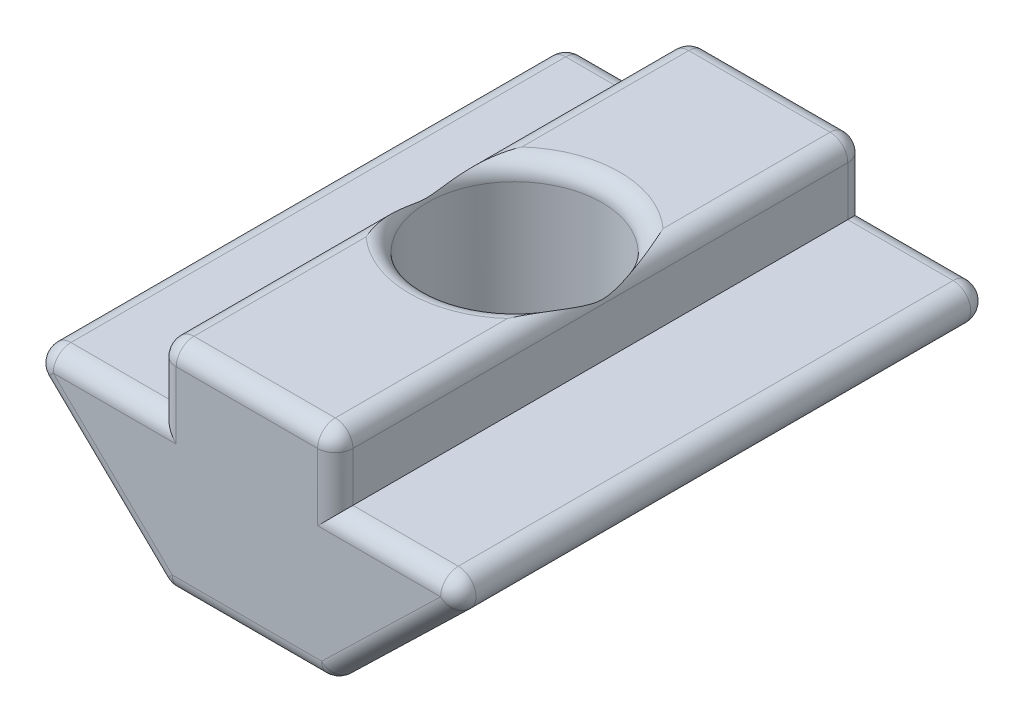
ISO-10303-21;
HEADER;
FILE_DESCRIPTION(('STEP AP214'),'2;1');
FILE_NAME('part.step','',(''),(''),'','','');
FILE_SCHEMA(('AUTOMOTIVE_DESIGN { 1 0 10303 214 1 1 1 1 }'));
ENDSEC;
DATA;
#1=APPLICATION_CONTEXT('core data for automotive mechanical design processes');
#2=APPLICATION_PROTOCOL_DEFINITION('international standard','automotive_design',2000,#1);
#3=PRODUCT_CONTEXT('',#1,'mechanical');
#4=PRODUCT('Part','Part','',(#3));
#5=PRODUCT_RELATED_PRODUCT_CATEGORY('part','',(#4));
#6=PRODUCT_DEFINITION_FORMATION('','',#4);
#7=PRODUCT_DEFINITION_CONTEXT('part definition',#1,'design');
#8=PRODUCT_DEFINITION('design','',#6,#7);
#9=PRODUCT_DEFINITION_SHAPE('','',#8);
#10=(LENGTH_UNIT() NAMED_UNIT(*) SI_UNIT(.MILLI.,.METRE.));
#11=(NAMED_UNIT(*) PLANE_ANGLE_UNIT() SI_UNIT($,.RADIAN.));
#12=(NAMED_UNIT(*) SI_UNIT($,.STERADIAN.) SOLID_ANGLE_UNIT());
#13=UNCERTAINTY_MEASURE_WITH_UNIT(LENGTH_MEASURE(1.E-05),#10,'distance_accuracy_value','');
#14=(GEOMETRIC_REPRESENTATION_CONTEXT(3) GLOBAL_UNCERTAINTY_ASSIGNED_CONTEXT((#13)) GLOBAL_UNIT_ASSIGNED_CONTEXT((#10,
#11,#12)) REPRESENTATION_CONTEXT('',''));
#15=CARTESIAN_POINT('',(0.,0.,0.));
#16=DIRECTION('',(0.,0.,1.));
#17=DIRECTION('',(1.,0.,0.));
#18=AXIS2_PLACEMENT_3D('',#15,#16,#17);
#19=CARTESIAN_POINT('',(0.,20.,30.));
#20=DIRECTION('',(0.,1.,0.));
#21=DIRECTION('',(0.,0.,1.));
#22=AXIS2_PLACEMENT_3D('',#19,#20,#21);
#23=PLANE('',#22);
#24=CARTESIAN_POINT('',(0.,20.,14.8524689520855));
#25=DIRECTION('',(0.,1.,0.));
#26=DIRECTION('',(0.,0.,1.));
#27=AXIS2_PLACEMENT_3D('',#24,#25,#26);
#28=CIRCLE('',#27,5.95);
#29=CARTESIAN_POINT('',(4.00000000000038,20.,19.2572958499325));
#30=VERTEX_POINT('',#29);
#31=CARTESIAN_POINT('',(-4.,20.,19.2572958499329));
#32=VERTEX_POINT('',#31);
#33=EDGE_CURVE('E380',#30,#32,#28,.F.);
#34=ORIENTED_EDGE('',*,*,#33,.T.);
#35=DIRECTION('',(0.,0.,-1.));
#36=VECTOR('',#35,1.);
#37=CARTESIAN_POINT('',(-4.,20.,30.));
#38=LINE('',#37,#36);
#39=CARTESIAN_POINT('',(-4.,20.,29.));
#40=VERTEX_POINT('',#39);
#41=EDGE_CURVE('E382',#32,#40,#38,.F.);
#42=ORIENTED_EDGE('',*,*,#41,.T.);
#43=DIRECTION('',(1.,0.,0.));
#44=VECTOR('',#43,1.);
#45=CARTESIAN_POINT('',(0.,20.,29.));
#46=LINE('',#45,#44);
#47=CARTESIAN_POINT('',(4.00000000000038,20.,29.));
#48=VERTEX_POINT('',#47);
#49=EDGE_CURVE('E375',#40,#48,#46,.T.);
#50=ORIENTED_EDGE('',*,*,#49,.T.);
#51=DIRECTION('',(0.,0.,-1.));
#52=VECTOR('',#51,1.);
#53=CARTESIAN_POINT('',(4.00000000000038,20.,30.));
#54=LINE('',#53,#52);
#55=EDGE_CURVE('E373',#48,#30,#54,.T.);
#56=ORIENTED_EDGE('',*,*,#55,.T.);
#57=EDGE_LOOP('',(#34,#42,#50,#56));
#58=FACE_BOUND('',#57,.T.);
#59=ADVANCED_FACE('F33',(#58),#23,.T.);
#60=CARTESIAN_POINT('',(-3.38431386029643E-13,7.68938944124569,30.));
#61=DIRECTION('',(0.,-1.,0.));
#62=DIRECTION('',(1.,0.,0.));
#63=AXIS2_PLACEMENT_3D('',#60,#61,#62);
#64=PLANE('',#63);
#65=DIRECTION('',(-1.,0.,0.));
#66=VECTOR('',#65,1.);
#67=CARTESIAN_POINT('',(-3.38431386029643E-13,7.68938944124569,29.));
#68=LINE('',#67,#66);
#69=CARTESIAN_POINT('',(4.2263076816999,7.68938944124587,29.));
#70=VERTEX_POINT('',#69);
#71=CARTESIAN_POINT('',(-4.22630768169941,7.6893894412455,29.));
#72=VERTEX_POINT('',#71);
#73=EDGE_CURVE('E395',#70,#72,#68,.T.);
#74=ORIENTED_EDGE('',*,*,#73,.T.);
#75=DIRECTION('',(0.,0.,-1.));
#76=VECTOR('',#75,1.);
#77=CARTESIAN_POINT('',(-4.22630768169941,7.6893894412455,16.6002962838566));
#78=LINE('',#77,#76);
#79=CARTESIAN_POINT('',(-4.22630768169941,7.6893894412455,19.0406455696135));
#80=VERTEX_POINT('',#79);
#81=EDGE_CURVE('E398',#72,#80,#78,.T.);
#82=ORIENTED_EDGE('',*,*,#81,.T.);
#83=CARTESIAN_POINT('',(0.,7.68938944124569,14.8524689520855));
#84=DIRECTION('',(0.,-1.,0.));
#85=DIRECTION('',(1.,0.,0.));
#86=AXIS2_PLACEMENT_3D('',#83,#84,#85);
#87=CIRCLE('',#86,5.95);
#88=CARTESIAN_POINT('',(4.2263076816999,7.68938944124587,19.0406455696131));
#89=VERTEX_POINT('',#88);
#90=EDGE_CURVE('E262',#80,#89,#87,.F.);
#91=ORIENTED_EDGE('',*,*,#90,.T.);
#92=DIRECTION('',(0.,0.,-1.));
#93=VECTOR('',#92,1.);
#94=CARTESIAN_POINT('',(4.2263076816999,7.68938944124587,30.));
#95=LINE('',#94,#93);
#96=EDGE_CURVE('E393',#89,#70,#95,.F.);
#97=ORIENTED_EDGE('',*,*,#96,.T.);
#98=EDGE_LOOP('',(#74,#82,#91,#97));
#99=FACE_BOUND('',#98,.T.);
#100=ADVANCED_FACE('F309',(#99),#64,.T.);
#101=CARTESIAN_POINT('',(0.,7.68938944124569,14.8524689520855));
#102=DIRECTION('',(0.,-1.,0.));
#103=DIRECTION('',(1.,0.,0.));
#104=AXIS2_PLACEMENT_3D('',#101,#102,#103);
#105=CIRCLE('',#104,5.95);
#106=CARTESIAN_POINT('',(4.2263076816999,7.68938944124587,10.6642923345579));
#107=VERTEX_POINT('',#106);
#108=CARTESIAN_POINT('',(-4.22630768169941,7.6893894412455,10.6642923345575));
#109=VERTEX_POINT('',#108);
#110=EDGE_CURVE('E388',#107,#109,#105,.F.);
#111=ORIENTED_EDGE('',*,*,#110,.T.);
#112=DIRECTION('',(0.,0.,-1.));
#113=VECTOR('',#112,1.);
#114=CARTESIAN_POINT('',(-4.22630768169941,7.6893894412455,0.));
#115=LINE('',#114,#113);
#116=CARTESIAN_POINT('',(-4.22630768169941,7.6893894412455,1.));
#117=VERTEX_POINT('',#116);
#118=EDGE_CURVE('E391',#109,#117,#115,.T.);
#119=ORIENTED_EDGE('',*,*,#118,.T.);
#120=DIRECTION('',(-1.,0.,0.));
#121=VECTOR('',#120,1.);
#122=CARTESIAN_POINT('',(4.63115532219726,7.68938944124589,1.));
#123=LINE('',#122,#121);
#124=CARTESIAN_POINT('',(4.2263076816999,7.68938944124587,1.));
#125=VERTEX_POINT('',#124);
#126=EDGE_CURVE('E386',#117,#125,#123,.F.);
#127=ORIENTED_EDGE('',*,*,#126,.T.);
#128=DIRECTION('',(0.,0.,-1.));
#129=VECTOR('',#128,1.);
#130=CARTESIAN_POINT('',(4.2263076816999,7.68938944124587,30.));
#131=LINE('',#130,#129);
#132=EDGE_CURVE('E384',#125,#107,#131,.F.);
#133=ORIENTED_EDGE('',*,*,#132,.T.);
#134=EDGE_LOOP('',(#111,#119,#127,#133));
#135=FACE_BOUND('',#134,.T.);
#136=ADVANCED_FACE('F316',(#135),#64,.T.);
#137=CARTESIAN_POINT('',(-1.6014160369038,1.65363612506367,30.));
#138=DIRECTION('',(0.695673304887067,-0.718358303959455,0.));
#139=DIRECTION('',(0.718358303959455,0.695673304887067,0.));
#140=AXIS2_PLACEMENT_3D('',#137,#138,#139);
#141=PLANE('',#140);
#142=DIRECTION('',(0.,0.,-1.));
#143=VECTOR('',#142,1.);
#144=CARTESIAN_POINT('',(4.92198098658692,7.97103113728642,30.));
#145=LINE('',#144,#143);
#146=CARTESIAN_POINT('',(4.92198098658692,7.97103113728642,10.6642923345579));
#147=VERTEX_POINT('',#146);
#148=CARTESIAN_POINT('',(4.92198098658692,7.97103113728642,1.));
#149=VERTEX_POINT('',#148);
#150=EDGE_CURVE('E407',#147,#149,#145,.T.);
#151=ORIENTED_EDGE('',*,*,#150,.T.);
#152=DIRECTION('',(-0.718358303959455,-0.695673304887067,0.));
#153=VECTOR('',#152,1.);
#154=CARTESIAN_POINT('',(13.4322637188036,16.2125680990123,1.));
#155=LINE('',#154,#153);
#156=CARTESIAN_POINT('',(11.657871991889,14.4942097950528,1.));
#157=VERTEX_POINT('',#156);
#158=EDGE_CURVE('E411',#149,#157,#155,.F.);
#159=ORIENTED_EDGE('',*,*,#158,.T.);
#160=DIRECTION('',(0.,0.,-1.));
#161=VECTOR('',#160,1.);
#162=CARTESIAN_POINT('',(11.657871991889,14.4942097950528,30.));
#163=LINE('',#162,#161);
#164=CARTESIAN_POINT('',(11.657871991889,14.4942097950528,29.));
#165=VERTEX_POINT('',#164);
#166=EDGE_CURVE('E409',#157,#165,#163,.F.);
#167=ORIENTED_EDGE('',*,*,#166,.T.);
#168=DIRECTION('',(-0.718358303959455,-0.695673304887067,0.));
#169=VECTOR('',#168,1.);
#170=CARTESIAN_POINT('',(-1.6014160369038,1.65363612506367,29.));
#171=LINE('',#170,#169);
#172=CARTESIAN_POINT('',(4.92198098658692,7.97103113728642,29.));
#173=VERTEX_POINT('',#172);
#174=EDGE_CURVE('E402',#165,#173,#171,.T.);
#175=ORIENTED_EDGE('',*,*,#174,.T.);
#176=DIRECTION('',(0.,0.,-1.));
#177=VECTOR('',#176,1.);
#178=CARTESIAN_POINT('',(4.92198098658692,7.97103113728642,30.));
#179=LINE('',#178,#177);
#180=CARTESIAN_POINT('',(4.92198098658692,7.97103113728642,19.0406455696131));
#181=VERTEX_POINT('',#180);
#182=EDGE_CURVE('E400',#173,#181,#179,.T.);
#183=ORIENTED_EDGE('',*,*,#182,.T.);
#184=CARTESIAN_POINT('',(0.695673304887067,3.87818580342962,14.8524689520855));
#185=DIRECTION('',(0.695673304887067,-0.718358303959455,0.));
#186=DIRECTION('',(0.718358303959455,0.695673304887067,0.));
#187=AXIS2_PLACEMENT_3D('',#184,#185,#186);
#188=ELLIPSE('',#187,8.28277472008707,5.95);
#189=EDGE_CURVE('E404',#181,#147,#188,.F.);
#190=ORIENTED_EDGE('',*,*,#189,.T.);
#191=EDGE_LOOP('',(#151,#159,#167,#175,#183,#190));
#192=FACE_BOUND('',#191,.T.);
#193=ADVANCED_FACE('F803',(#192),#141,.T.);
#194=CARTESIAN_POINT('',(0.,16.2125680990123,30.));
#195=DIRECTION('',(0.,1.,0.));
#196=DIRECTION('',(-1.,0.,0.));
#197=AXIS2_PLACEMENT_3D('',#194,#195,#196);
#198=PLANE('',#197);
#199=DIRECTION('',(0.,0.,-1.));
#200=VECTOR('',#199,1.);
#201=CARTESIAN_POINT('',(10.962198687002,16.2125680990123,30.));
#202=LINE('',#201,#200);
#203=CARTESIAN_POINT('',(10.962198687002,16.2125680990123,29.));
#204=VERTEX_POINT('',#203);
#205=CARTESIAN_POINT('',(10.962198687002,16.2125680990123,1.));
#206=VERTEX_POINT('',#205);
#207=EDGE_CURVE('E429',#204,#206,#202,.T.);
#208=ORIENTED_EDGE('',*,*,#207,.T.);
#209=DIRECTION('',(1.,0.,0.));
#210=VECTOR('',#209,1.);
#211=CARTESIAN_POINT('',(5.00000000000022,16.2125680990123,1.));
#212=LINE('',#211,#210);
#213=CARTESIAN_POINT('',(5.00000000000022,16.2125680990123,1.));
#214=VERTEX_POINT('',#213);
#215=EDGE_CURVE('E433',#206,#214,#212,.F.);
#216=ORIENTED_EDGE('',*,*,#215,.T.);
#217=DIRECTION('',(0.,0.,-1.));
#218=VECTOR('',#217,1.);
#219=CARTESIAN_POINT('',(5.00000000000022,16.2125680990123,30.));
#220=LINE('',#219,#218);
#221=CARTESIAN_POINT('',(5.00000000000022,16.2125680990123,29.));
#222=VERTEX_POINT('',#221);
#223=EDGE_CURVE('E255',#222,#214,#220,.T.);
#224=ORIENTED_EDGE('',*,*,#223,.F.);
#225=DIRECTION('',(1.,0.,0.));
#226=VECTOR('',#225,1.);
#227=CARTESIAN_POINT('',(0.,16.2125680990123,29.));
#228=LINE('',#227,#226);
#229=EDGE_CURVE('E431',#222,#204,#228,.T.);
#230=ORIENTED_EDGE('',*,*,#229,.T.);
#231=EDGE_LOOP('',(#208,#216,#224,#230));
#232=FACE_BOUND('',#231,.T.);
#233=ADVANCED_FACE('F332',(#232),#198,.T.);
#234=CARTESIAN_POINT('',(4.99999999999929,-2.86263146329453E-13,30.));
#235=DIRECTION('',(1.,0.,0.));
#236=DIRECTION('',(0.,1.,0.));
#237=AXIS2_PLACEMENT_3D('',#234,#235,#236);
#238=PLANE('',#237);
#239=ORIENTED_EDGE('',*,*,#223,.T.);
#240=DIRECTION('',(0.,-1.,0.));
#241=VECTOR('',#240,1.);
#242=CARTESIAN_POINT('',(5.00000000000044,20.,1.));
#243=LINE('',#242,#241);
#244=CARTESIAN_POINT('',(5.00000000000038,18.9999999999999,1.));
#245=VERTEX_POINT('',#244);
#246=EDGE_CURVE('E440',#214,#245,#243,.F.);
#247=ORIENTED_EDGE('',*,*,#246,.T.);
#248=DIRECTION('',(0.,0.,-1.));
#249=VECTOR('',#248,1.);
#250=CARTESIAN_POINT('',(5.00000000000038,18.9999999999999,30.));
#251=LINE('',#250,#249);
#252=CARTESIAN_POINT('',(5.00000000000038,18.9999999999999,29.));
#253=VERTEX_POINT('',#252);
#254=EDGE_CURVE('E436',#245,#253,#251,.F.);
#255=ORIENTED_EDGE('',*,*,#254,.T.);
#256=DIRECTION('',(0.,-1.,0.));
#257=VECTOR('',#256,1.);
#258=CARTESIAN_POINT('',(4.99999999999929,-2.86263146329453E-13,29.));
#259=LINE('',#258,#257);
#260=EDGE_CURVE('E438',#253,#222,#259,.T.);
#261=ORIENTED_EDGE('',*,*,#260,.T.);
#262=EDGE_LOOP('',(#239,#247,#255,#261));
#263=FACE_BOUND('',#262,.T.);
#264=ADVANCED_FACE('F324',(#263),#238,.T.);
#265=DIRECTION('',(1.,0.,0.));
#266=VECTOR('',#265,1.);
#267=CARTESIAN_POINT('',(-5.,20.,1.));
#268=LINE('',#267,#266);
#269=CARTESIAN_POINT('',(4.00000000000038,20.,1.));
#270=VERTEX_POINT('',#269);
#271=CARTESIAN_POINT('',(-4.,20.,1.));
#272=VERTEX_POINT('',#271);
#273=EDGE_CURVE('E335',#270,#272,#268,.F.);
#274=ORIENTED_EDGE('',*,*,#273,.T.);
#275=DIRECTION('',(0.,0.,-1.));
#276=VECTOR('',#275,1.);
#277=CARTESIAN_POINT('',(-4.,20.,30.));
#278=LINE('',#277,#276);
#279=CARTESIAN_POINT('',(-4.,20.,10.4476420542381));
#280=VERTEX_POINT('',#279);
#281=EDGE_CURVE('E339',#272,#280,#278,.F.);
#282=ORIENTED_EDGE('',*,*,#281,.T.);
#283=CARTESIAN_POINT('',(0.,20.,14.8524689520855));
#284=DIRECTION('',(0.,1.,0.));
#285=DIRECTION('',(0.,0.,1.));
#286=AXIS2_PLACEMENT_3D('',#283,#284,#285);
#287=CIRCLE('',#286,5.95);
#288=CARTESIAN_POINT('',(4.00000000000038,20.,10.4476420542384));
#289=VERTEX_POINT('',#288);
#290=EDGE_CURVE('E346',#280,#289,#287,.F.);
#291=ORIENTED_EDGE('',*,*,#290,.T.);
#292=DIRECTION('',(0.,0.,-1.));
#293=VECTOR('',#292,1.);
#294=CARTESIAN_POINT('',(4.00000000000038,20.,30.));
#295=LINE('',#294,#293);
#296=EDGE_CURVE('E342',#289,#270,#295,.T.);
#297=ORIENTED_EDGE('',*,*,#296,.T.);
#298=EDGE_LOOP('',(#274,#282,#291,#297));
#299=FACE_BOUND('',#298,.T.);
#300=ADVANCED_FACE('F312',(#299),#23,.T.);
#301=CARTESIAN_POINT('',(-4.99999999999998,0.,30.));
#302=DIRECTION('',(1.,0.,0.));
#303=DIRECTION('',(0.,1.,0.));
#304=AXIS2_PLACEMENT_3D('',#301,#302,#303);
#305=PLANE('',#304);
#306=DIRECTION('',(0.,0.,-1.));
#307=VECTOR('',#306,1.);
#308=CARTESIAN_POINT('',(-5.,19.,0.));
#309=LINE('',#308,#307);
#310=CARTESIAN_POINT('',(-5.,19.,29.));
#311=VERTEX_POINT('',#310);
#312=CARTESIAN_POINT('',(-5.,19.,1.));
#313=VERTEX_POINT('',#312);
#314=EDGE_CURVE('E442',#311,#313,#309,.T.);
#315=ORIENTED_EDGE('',*,*,#314,.T.);
#316=DIRECTION('',(0.,-1.,0.));
#317=VECTOR('',#316,1.);
#318=CARTESIAN_POINT('',(-4.99999999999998,0.,1.));
#319=LINE('',#318,#317);
#320=CARTESIAN_POINT('',(-4.99999999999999,16.2125680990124,1.));
#321=VERTEX_POINT('',#320);
#322=EDGE_CURVE('E446',#313,#321,#319,.T.);
#323=ORIENTED_EDGE('',*,*,#322,.T.);
#324=DIRECTION('',(0.,0.,-1.));
#325=VECTOR('',#324,1.);
#326=CARTESIAN_POINT('',(-4.99999999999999,16.2125680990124,30.));
#327=LINE('',#326,#325);
#328=CARTESIAN_POINT('',(-4.99999999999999,16.2125680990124,29.));
#329=VERTEX_POINT('',#328);
#330=EDGE_CURVE('E284',#329,#321,#327,.T.);
#331=ORIENTED_EDGE('',*,*,#330,.F.);
#332=DIRECTION('',(0.,-1.,0.));
#333=VECTOR('',#332,1.);
#334=CARTESIAN_POINT('',(-5.,20.,29.));
#335=LINE('',#334,#333);
#336=EDGE_CURVE('E444',#329,#311,#335,.F.);
#337=ORIENTED_EDGE('',*,*,#336,.T.);
#338=EDGE_LOOP('',(#315,#323,#331,#337));
#339=FACE_BOUND('',#338,.T.);
#340=ADVANCED_FACE('F323',(#339),#305,.F.);
#341=CARTESIAN_POINT('',(-5.87016834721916E-13,16.2125680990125,30.));
#342=DIRECTION('',(0.,-1.,0.));
#343=DIRECTION('',(1.,0.,0.));
#344=AXIS2_PLACEMENT_3D('',#341,#342,#343);
#345=PLANE('',#344);
#346=ORIENTED_EDGE('',*,*,#330,.T.);
#347=DIRECTION('',(-1.,0.,0.));
#348=VECTOR('',#347,1.);
#349=CARTESIAN_POINT('',(-5.87016834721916E-13,16.2125680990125,1.));
#350=LINE('',#349,#348);
#351=CARTESIAN_POINT('',(-10.9621986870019,16.2125680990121,1.));
#352=VERTEX_POINT('',#351);
#353=EDGE_CURVE('E453',#321,#352,#350,.T.);
#354=ORIENTED_EDGE('',*,*,#353,.T.);
#355=DIRECTION('',(0.,0.,-1.));
#356=VECTOR('',#355,1.);
#357=CARTESIAN_POINT('',(-10.9621986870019,16.2125680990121,30.));
#358=LINE('',#357,#356);
#359=CARTESIAN_POINT('',(-10.9621986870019,16.2125680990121,29.));
#360=VERTEX_POINT('',#359);
#361=EDGE_CURVE('E449',#352,#360,#358,.F.);
#362=ORIENTED_EDGE('',*,*,#361,.T.);
#363=DIRECTION('',(-1.,0.,0.));
#364=VECTOR('',#363,1.);
#365=CARTESIAN_POINT('',(-4.99999999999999,16.2125680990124,29.));
#366=LINE('',#365,#364);
#367=EDGE_CURVE('E451',#360,#329,#366,.F.);
#368=ORIENTED_EDGE('',*,*,#367,.T.);
#369=EDGE_LOOP('',(#346,#354,#362,#368));
#370=FACE_BOUND('',#369,.T.);
#371=ADVANCED_FACE('F330',(#370),#345,.F.);
#372=CARTESIAN_POINT('',(1.60141603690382,1.65363612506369,30.));
#373=DIRECTION('',(0.695673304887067,0.718358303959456,0.));
#374=DIRECTION('',(-0.718358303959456,0.695673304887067,0.));
#375=AXIS2_PLACEMENT_3D('',#372,#373,#374);
#376=PLANE('',#375);
#377=DIRECTION('',(0.718358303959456,-0.695673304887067,0.));
#378=VECTOR('',#377,1.);
#379=CARTESIAN_POINT('',(1.60141603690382,1.65363612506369,1.));
#380=LINE('',#379,#378);
#381=CARTESIAN_POINT('',(-11.6578719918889,14.4942097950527,1.));
#382=VERTEX_POINT('',#381);
#383=CARTESIAN_POINT('',(-4.92198098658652,7.97103113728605,1.));
#384=VERTEX_POINT('',#383);
#385=EDGE_CURVE('E461',#382,#384,#380,.T.);
#386=ORIENTED_EDGE('',*,*,#385,.T.);
#387=DIRECTION('',(0.,0.,-1.));
#388=VECTOR('',#387,1.);
#389=CARTESIAN_POINT('',(-4.92198098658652,7.97103113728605,13.1046416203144));
#390=LINE('',#389,#388);
#391=CARTESIAN_POINT('',(-4.92198098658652,7.97103113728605,10.6642923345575));
#392=VERTEX_POINT('',#391);
#393=EDGE_CURVE('E466',#384,#392,#390,.F.);
#394=ORIENTED_EDGE('',*,*,#393,.T.);
#395=CARTESIAN_POINT('',(-0.695673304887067,3.87818580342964,14.8524689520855));
#396=DIRECTION('',(0.695673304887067,0.718358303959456,0.));
#397=DIRECTION('',(-0.718358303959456,0.695673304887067,0.));
#398=AXIS2_PLACEMENT_3D('',#395,#396,#397);
#399=ELLIPSE('',#398,8.28277472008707,5.95);
#400=CARTESIAN_POINT('',(-4.92198098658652,7.97103113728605,19.0406455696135));
#401=VERTEX_POINT('',#400);
#402=EDGE_CURVE('E464',#392,#401,#399,.T.);
#403=ORIENTED_EDGE('',*,*,#402,.T.);
#404=DIRECTION('',(0.,0.,-1.));
#405=VECTOR('',#404,1.);
#406=CARTESIAN_POINT('',(-4.92198098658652,7.97103113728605,30.));
#407=LINE('',#406,#405);
#408=CARTESIAN_POINT('',(-4.92198098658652,7.97103113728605,29.));
#409=VERTEX_POINT('',#408);
#410=EDGE_CURVE('E459',#401,#409,#407,.F.);
#411=ORIENTED_EDGE('',*,*,#410,.T.);
#412=DIRECTION('',(0.718358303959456,-0.695673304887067,0.));
#413=VECTOR('',#412,1.);
#414=CARTESIAN_POINT('',(-13.4322637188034,16.2125680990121,29.));
#415=LINE('',#414,#413);
#416=CARTESIAN_POINT('',(-11.6578719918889,14.4942097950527,29.));
#417=VERTEX_POINT('',#416);
#418=EDGE_CURVE('E455',#409,#417,#415,.F.);
#419=ORIENTED_EDGE('',*,*,#418,.T.);
#420=DIRECTION('',(0.,0.,-1.));
#421=VECTOR('',#420,1.);
#422=CARTESIAN_POINT('',(-11.6578719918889,14.4942097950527,30.));
#423=LINE('',#422,#421);
#424=EDGE_CURVE('E457',#417,#382,#423,.T.);
#425=ORIENTED_EDGE('',*,*,#424,.T.);
#426=EDGE_LOOP('',(#386,#394,#403,#411,#419,#425));
#427=FACE_BOUND('',#426,.T.);
#428=ADVANCED_FACE('F292',(#427),#376,.F.);
#429=CARTESIAN_POINT('',(0.,0.,30.));
#430=DIRECTION('',(0.,0.,1.));
#431=DIRECTION('',(1.,0.,0.));
#432=AXIS2_PLACEMENT_3D('',#429,#430,#431);
#433=PLANE('',#432);
#434=DIRECTION('',(0.718358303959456,-0.695673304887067,0.));
#435=VECTOR('',#434,1.);
#436=CARTESIAN_POINT('',(-3.93548201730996,8.40774774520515,30.));
#437=LINE('',#436,#435);
#438=CARTESIAN_POINT('',(-10.9621986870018,15.2125680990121,30.));
#439=VERTEX_POINT('',#438);
#440=CARTESIAN_POINT('',(-4.22630768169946,8.6893894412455,30.));
#441=VERTEX_POINT('',#440);
#442=EDGE_CURVE('E468',#439,#441,#437,.T.);
#443=ORIENTED_EDGE('',*,*,#442,.T.);
#444=DIRECTION('',(-1.,0.,0.));
#445=VECTOR('',#444,1.);
#446=CARTESIAN_POINT('',(-3.82444163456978E-13,8.68938944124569,30.));
#447=LINE('',#446,#445);
#448=CARTESIAN_POINT('',(4.22630768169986,8.68938944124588,30.));
#449=VERTEX_POINT('',#448);
#450=EDGE_CURVE('E11',#441,#449,#447,.F.);
#451=ORIENTED_EDGE('',*,*,#450,.T.);
#452=DIRECTION('',(-0.718358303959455,-0.695673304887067,0.));
#453=VECTOR('',#452,1.);
#454=CARTESIAN_POINT('',(-2.29708934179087,2.37199442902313,30.));
#455=LINE('',#454,#453);
#456=CARTESIAN_POINT('',(10.9621986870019,15.2125680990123,30.));
#457=VERTEX_POINT('',#456);
#458=EDGE_CURVE('E44',#449,#457,#455,.F.);
#459=ORIENTED_EDGE('',*,*,#458,.T.);
#460=DIRECTION('',(1.,0.,0.));
#461=VECTOR('',#460,1.);
#462=CARTESIAN_POINT('',(0.,15.2125680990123,30.));
#463=LINE('',#462,#461);
#464=CARTESIAN_POINT('',(4.00000000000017,15.2125680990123,30.));
#465=VERTEX_POINT('',#464);
#466=EDGE_CURVE('E478',#457,#465,#463,.F.);
#467=ORIENTED_EDGE('',*,*,#466,.T.);
#468=DIRECTION('',(0.,-1.,0.));
#469=VECTOR('',#468,1.);
#470=CARTESIAN_POINT('',(3.99999999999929,-2.29010517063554E-13,30.));
#471=LINE('',#470,#469);
#472=CARTESIAN_POINT('',(4.00000000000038,19.,30.));
#473=VERTEX_POINT('',#472);
#474=EDGE_CURVE('E476',#465,#473,#471,.F.);
#475=ORIENTED_EDGE('',*,*,#474,.T.);
#476=DIRECTION('',(1.,0.,0.));
#477=VECTOR('',#476,1.);
#478=CARTESIAN_POINT('',(0.,19.,30.));
#479=LINE('',#478,#477);
#480=CARTESIAN_POINT('',(-4.,19.,30.));
#481=VERTEX_POINT('',#480);
#482=EDGE_CURVE('E474',#473,#481,#479,.F.);
#483=ORIENTED_EDGE('',*,*,#482,.T.);
#484=DIRECTION('',(0.,-1.,0.));
#485=VECTOR('',#484,1.);
#486=CARTESIAN_POINT('',(-3.99999999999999,16.2125680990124,30.));
#487=LINE('',#486,#485);
#488=CARTESIAN_POINT('',(-3.99999999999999,15.2125680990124,30.));
#489=VERTEX_POINT('',#488);
#490=EDGE_CURVE('E472',#481,#489,#487,.T.);
#491=ORIENTED_EDGE('',*,*,#490,.T.);
#492=DIRECTION('',(-1.,0.,0.));
#493=VECTOR('',#492,1.);
#494=CARTESIAN_POINT('',(-13.4322637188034,15.2125680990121,30.));
#495=LINE('',#494,#493);
#496=EDGE_CURVE('E470',#489,#439,#495,.T.);
#497=ORIENTED_EDGE('',*,*,#496,.T.);
#498=EDGE_LOOP('',(#443,#451,#459,#467,#475,#483,#491,#497));
#499=FACE_BOUND('',#498,.T.);
#500=ADVANCED_FACE('F301',(#499),#433,.T.);
#501=CARTESIAN_POINT('',(0.,0.,0.));
#502=DIRECTION('',(0.,0.,1.));
#503=DIRECTION('',(1.,0.,0.));
#504=AXIS2_PLACEMENT_3D('',#501,#502,#503);
#505=PLANE('',#504);
#506=DIRECTION('',(-0.718358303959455,-0.695673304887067,0.));
#507=VECTOR('',#506,1.);
#508=CARTESIAN_POINT('',(3.93548201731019,8.40774774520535,0.));
#509=LINE('',#508,#507);
#510=CARTESIAN_POINT('',(10.9621986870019,15.2125680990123,0.));
#511=VERTEX_POINT('',#510);
#512=CARTESIAN_POINT('',(4.22630768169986,8.68938944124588,0.));
#513=VERTEX_POINT('',#512);
#514=EDGE_CURVE('E424',#511,#513,#509,.T.);
#515=ORIENTED_EDGE('',*,*,#514,.T.);
#516=DIRECTION('',(-1.,0.,0.));
#517=VECTOR('',#516,1.);
#518=CARTESIAN_POINT('',(-4.63115532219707,8.68938944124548,0.));
#519=LINE('',#518,#517);
#520=CARTESIAN_POINT('',(-4.22630768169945,8.6893894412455,0.));
#521=VERTEX_POINT('',#520);
#522=EDGE_CURVE('E426',#513,#521,#519,.T.);
#523=ORIENTED_EDGE('',*,*,#522,.T.);
#524=DIRECTION('',(0.718358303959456,-0.695673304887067,0.));
#525=VECTOR('',#524,1.);
#526=CARTESIAN_POINT('',(2.29708934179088,2.37199442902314,0.));
#527=LINE('',#526,#525);
#528=CARTESIAN_POINT('',(-10.9621986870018,15.2125680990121,0.));
#529=VERTEX_POINT('',#528);
#530=EDGE_CURVE('E413',#521,#529,#527,.F.);
#531=ORIENTED_EDGE('',*,*,#530,.T.);
#532=DIRECTION('',(-1.,0.,0.));
#533=VECTOR('',#532,1.);
#534=CARTESIAN_POINT('',(-5.50809317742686E-13,15.2125680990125,0.));
#535=LINE('',#534,#533);
#536=CARTESIAN_POINT('',(-3.99999999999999,15.2125680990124,0.));
#537=VERTEX_POINT('',#536);
#538=EDGE_CURVE('E415',#529,#537,#535,.F.);
#539=ORIENTED_EDGE('',*,*,#538,.T.);
#540=DIRECTION('',(0.,-1.,0.));
#541=VECTOR('',#540,1.);
#542=CARTESIAN_POINT('',(-3.99999999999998,0.,0.));
#543=LINE('',#542,#541);
#544=CARTESIAN_POINT('',(-4.,19.,0.));
#545=VERTEX_POINT('',#544);
#546=EDGE_CURVE('E417',#537,#545,#543,.F.);
#547=ORIENTED_EDGE('',*,*,#546,.T.);
#548=DIRECTION('',(1.,0.,0.));
#549=VECTOR('',#548,1.);
#550=CARTESIAN_POINT('',(5.00000000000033,19.,0.));
#551=LINE('',#550,#549);
#552=CARTESIAN_POINT('',(4.00000000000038,19.,0.));
#553=VERTEX_POINT('',#552);
#554=EDGE_CURVE('E353',#545,#553,#551,.T.);
#555=ORIENTED_EDGE('',*,*,#554,.T.);
#556=DIRECTION('',(0.,-1.,0.));
#557=VECTOR('',#556,1.);
#558=CARTESIAN_POINT('',(4.00000000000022,16.2125680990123,0.));
#559=LINE('',#558,#557);
#560=CARTESIAN_POINT('',(4.00000000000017,15.2125680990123,0.));
#561=VERTEX_POINT('',#560);
#562=EDGE_CURVE('E420',#553,#561,#559,.T.);
#563=ORIENTED_EDGE('',*,*,#562,.T.);
#564=DIRECTION('',(1.,0.,0.));
#565=VECTOR('',#564,1.);
#566=CARTESIAN_POINT('',(13.4322637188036,15.2125680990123,0.));
#567=LINE('',#566,#565);
#568=EDGE_CURVE('E422',#561,#511,#567,.T.);
#569=ORIENTED_EDGE('',*,*,#568,.T.);
#570=EDGE_LOOP('',(#515,#523,#531,#539,#547,#555,#563,#569));
#571=FACE_BOUND('',#570,.T.);
#572=ADVANCED_FACE('F299',(#571),#505,.F.);
#573=CARTESIAN_POINT('',(0.,-9.99999999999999,14.8524689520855));
#574=DIRECTION('',(0.,1.,0.));
#575=DIRECTION('',(0.,0.,1.));
#576=AXIS2_PLACEMENT_3D('',#573,#574,#575);
#577=CYLINDRICAL_SURFACE('',#576,4.95);
#578=CARTESIAN_POINT('',(0.,19.,14.8524689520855));
#579=DIRECTION('',(0.,1.,0.));
#580=DIRECTION('',(0.,0.,1.));
#581=AXIS2_PLACEMENT_3D('',#578,#579,#580);
#582=CIRCLE('',#581,4.95);
#583=CARTESIAN_POINT('',(0.,19.,19.8024689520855));
#584=VERTEX_POINT('',#583);
#585=EDGE_CURVE('E663',#584,#584,#582,.T.);
#586=ORIENTED_EDGE('',*,*,#585,.T.);
#587=EDGE_LOOP('',(#586));
#588=FACE_BOUND('',#587,.T.);
#589=CARTESIAN_POINT('',(0.,8.68938944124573,14.8524689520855));
#590=DIRECTION('',(0.,-1.,0.));
#591=DIRECTION('',(1.,0.,0.));
#592=AXIS2_PLACEMENT_3D('',#589,#590,#591);
#593=CIRCLE('',#592,4.95);
#594=CARTESIAN_POINT('',(-3.51600386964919,8.68938944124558,11.3681875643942));
#595=VERTEX_POINT('',#594);
#596=CARTESIAN_POINT('',(3.51600386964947,8.68938944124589,11.3681875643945));
#597=VERTEX_POINT('',#596);
#598=EDGE_CURVE('E242',#595,#597,#593,.T.);
#599=ORIENTED_EDGE('',*,*,#598,.T.);
#600=CARTESIAN_POINT('',(0.,4.59654410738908,14.8524689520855));
#601=DIRECTION('',(-0.758537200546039,0.651629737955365,0.));
#602=DIRECTION('',(0.651629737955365,0.758537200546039,0.));
#603=AXIS2_PLACEMENT_3D('',#600,#601,#602);
#604=ELLIPSE('',#603,7.59633839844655,4.95);
#605=CARTESIAN_POINT('',(3.5160038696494,8.6893894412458,18.3367503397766));
#606=VERTEX_POINT('',#605);
#607=EDGE_CURVE('E237',#597,#606,#604,.F.);
#608=ORIENTED_EDGE('',*,*,#607,.T.);
#609=CARTESIAN_POINT('',(0.,8.68938944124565,14.8524689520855));
#610=DIRECTION('',(0.,-1.,0.));
#611=DIRECTION('',(1.,0.,0.));
#612=AXIS2_PLACEMENT_3D('',#609,#610,#611);
#613=CIRCLE('',#612,4.95);
#614=CARTESIAN_POINT('',(-3.51600386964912,8.68938944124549,18.3367503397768));
#615=VERTEX_POINT('',#614);
#616=EDGE_CURVE('E230',#606,#615,#613,.T.);
#617=ORIENTED_EDGE('',*,*,#616,.T.);
#618=CARTESIAN_POINT('',(0.,4.5965441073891,14.8524689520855));
#619=DIRECTION('',(-0.758537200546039,-0.651629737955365,0.));
#620=DIRECTION('',(-0.651629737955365,0.758537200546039,0.));
#621=AXIS2_PLACEMENT_3D('',#618,#619,#620);
#622=ELLIPSE('',#621,7.59633839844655,4.95);
#623=EDGE_CURVE('E234',#615,#595,#622,.T.);
#624=ORIENTED_EDGE('',*,*,#623,.T.);
#625=EDGE_LOOP('',(#599,#608,#617,#624));
#626=FACE_BOUND('',#625,.T.);
#627=ADVANCED_FACE('F233',(#588,#626),#577,.F.);
#628=CARTESIAN_POINT('',(6.64567330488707,9.64029106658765,14.8524689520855));
#629=CARTESIAN_POINT('',(6.16983758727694,9.17948174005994,14.8524689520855));
#630=CARTESIAN_POINT('',(5.55991879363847,9.43786891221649,14.8524689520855));
#631=CARTESIAN_POINT('',(4.95,9.69625608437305,14.8524689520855));
#632=CARTESIAN_POINT('',(4.95,10.3586493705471,14.8524689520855));
#633=CARTESIAN_POINT('',(6.64567330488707,9.64029106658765,15.1127699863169));
#634=CARTESIAN_POINT('',(6.16983758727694,9.17948174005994,15.0724441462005));
#635=CARTESIAN_POINT('',(5.55991879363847,9.43786891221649,15.0567055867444));
#636=CARTESIAN_POINT('',(4.95,9.69625608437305,15.0409731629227));
#637=CARTESIAN_POINT('',(4.95,10.3586493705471,15.0690219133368));
#638=CARTESIAN_POINT('',(6.62847230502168,9.62363325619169,15.3730710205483));
#639=CARTESIAN_POINT('',(6.15610007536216,9.16617804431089,15.2922143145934));
#640=CARTESIAN_POINT('',(5.54776840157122,9.42429905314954,15.2609422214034));
#641=CARTESIAN_POINT('',(4.93948181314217,9.68247040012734,15.2293016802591));
#642=CARTESIAN_POINT('',(4.93568992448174,10.3419915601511,15.2855748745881));
#643=CARTESIAN_POINT('',(6.56054053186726,9.55784669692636,15.8891368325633));
#644=CARTESIAN_POINT('',(6.10117128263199,9.11298384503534,15.7312528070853));
#645=CARTESIAN_POINT('',(5.49912408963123,9.37017457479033,15.6690388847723));
#646=CARTESIAN_POINT('',(4.89711973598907,9.62741279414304,15.6064556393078));
#647=CARTESIAN_POINT('',(4.87917525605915,10.2762050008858,15.7149069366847));
#648=CARTESIAN_POINT('',(6.50928904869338,9.50821368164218,16.1447667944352));
#649=CARTESIAN_POINT('',(6.05965203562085,9.07277573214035,15.9500831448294));
#650=CARTESIAN_POINT('',(5.46225203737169,9.32920082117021,15.872842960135));
#651=CARTESIAN_POINT('',(4.86502078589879,9.58581258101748,15.7949177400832));
#652=CARTESIAN_POINT('',(4.83653746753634,10.2265719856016,15.9275738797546));
#653=CARTESIAN_POINT('',(6.37464228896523,9.37781892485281,16.6473311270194));
#654=CARTESIAN_POINT('',(5.94879912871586,8.96542344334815,16.3854341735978));
#655=CARTESIAN_POINT('',(5.36353914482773,9.22007865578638,16.2787905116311));
#656=CARTESIAN_POINT('',(4.77845173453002,9.47492450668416,16.1714280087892));
#657=CARTESIAN_POINT('',(4.72452041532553,10.0961772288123,16.3456736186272));
#658=CARTESIAN_POINT('',(6.29035431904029,9.29619268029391,16.8937954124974));
#659=CARTESIAN_POINT('',(5.87886362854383,8.89769643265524,16.6014306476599));
#660=CARTESIAN_POINT('',(5.30100238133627,9.1511735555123,16.4807127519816));
#661=CARTESIAN_POINT('',(4.72349480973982,9.40503812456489,16.3590638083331));
#662=CARTESIAN_POINT('',(4.65439849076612,10.0145509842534,16.5507153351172));
#663=CARTESIAN_POINT('',(6.09138101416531,9.1035027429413,17.374196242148));
#664=CARTESIAN_POINT('',(5.71099002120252,8.7351240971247,17.0280825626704));
#665=CARTESIAN_POINT('',(5.15037465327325,8.98614796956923,16.8803267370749));
#666=CARTESIAN_POINT('',(4.5901341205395,9.23758254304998,16.7315689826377));
#667=CARTESIAN_POINT('',(4.48886607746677,9.82186104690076,16.9503765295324));
#668=CARTESIAN_POINT('',(5.9756453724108,8.99142191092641,17.607278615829));
#669=CARTESIAN_POINT('',(5.61227857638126,8.6395298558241,17.2380826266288));
#670=CARTESIAN_POINT('',(5.06138825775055,8.88907729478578,17.0775522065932));
#671=CARTESIAN_POINT('',(4.51107485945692,9.13925049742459,16.9159311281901));
#672=CARTESIAN_POINT('',(4.39258180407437,9.70978021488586,17.1442853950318));
#673=CARTESIAN_POINT('',(5.71583199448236,8.73981316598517,18.0573099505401));
#674=CARTESIAN_POINT('',(5.38730047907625,8.42165633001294,17.6487722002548));
#675=CARTESIAN_POINT('',(4.85784845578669,8.66825247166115,17.464173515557));
#676=CARTESIAN_POINT('',(4.32901881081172,8.91552400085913,17.2783872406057));
#677=CARTESIAN_POINT('',(4.17643454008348,9.45817146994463,17.5186812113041));
#678=CARTESIAN_POINT('',(5.57073438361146,8.59929758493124,18.2731040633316));
#679=CARTESIAN_POINT('',(5.26021089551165,8.2985801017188,17.8486747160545));
#680=CARTESIAN_POINT('',(4.74234541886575,8.54351528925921,17.6528473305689));
#681=CARTESIAN_POINT('',(4.22529313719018,8.78932423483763,17.4558614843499));
#682=CARTESIAN_POINT('',(4.05572308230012,9.3176558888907,17.6982074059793));
#683=CARTESIAN_POINT('',(5.25458380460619,8.29313070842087,18.685130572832));
#684=CARTESIAN_POINT('',(4.97975796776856,8.02698358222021,18.2347790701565));
#685=CARTESIAN_POINT('',(4.48658337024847,8.26865155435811,18.0182438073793));
#686=CARTESIAN_POINT('',(3.99429066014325,8.51126745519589,17.8004451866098));
#687=CARTESIAN_POINT('',(3.79270705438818,9.01148901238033,18.0409857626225));
#688=CARTESIAN_POINT('',(5.0826586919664,8.12663480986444,18.8800518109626));
#689=CARTESIAN_POINT('',(4.82562534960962,7.87771830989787,18.4201118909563));
#690=CARTESIAN_POINT('',(4.34544648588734,8.11763729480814,18.1940511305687));
#691=CARTESIAN_POINT('',(3.86630638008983,8.35866289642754,17.9668510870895));
#692=CARTESIAN_POINT('',(3.64967691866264,8.84499311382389,18.2031471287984));
#693=CARTESIAN_POINT('',(4.71560824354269,7.77117542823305,19.247107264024));
#694=CARTESIAN_POINT('',(4.49319124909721,7.555782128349,18.7727247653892));
#695=CARTESIAN_POINT('',(4.04007511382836,7.79227670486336,18.5295329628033));
#696=CARTESIAN_POINT('',(3.58808173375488,8.02996767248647,18.2851057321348));
#697=CARTESIAN_POINT('',(3.34431562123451,8.48953373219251,18.5085125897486));
#698=CARTESIAN_POINT('',(4.51980681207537,7.58155719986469,19.417918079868));
#699=CARTESIAN_POINT('',(4.31423771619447,7.38247975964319,18.9391305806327));
#700=CARTESIAN_POINT('',(3.87511309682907,7.61721076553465,18.6882020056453));
#701=CARTESIAN_POINT('',(3.43722294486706,7.85324701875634,18.4362276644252));
#702=CARTESIAN_POINT('',(3.18142199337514,8.29991550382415,18.6506157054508));
#703=CARTESIAN_POINT('',(4.1081410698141,7.18289142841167,19.7338021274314));
#704=CARTESIAN_POINT('',(3.93497889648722,7.01519753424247,19.2498844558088));
#705=CARTESIAN_POINT('',(3.52450459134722,7.24647414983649,18.9854878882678));
#706=CARTESIAN_POINT('',(3.11535275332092,7.47914924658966,18.7199689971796));
#707=CARTESIAN_POINT('',(2.83894377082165,7.90124973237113,18.9134099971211));
#708=CARTESIAN_POINT('',(3.89179752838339,6.97337978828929,19.87765381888));
#709=CARTESIAN_POINT('',(3.73416337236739,6.82072355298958,19.3934307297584));
#710=CARTESIAN_POINT('',(3.33831095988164,7.0502738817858,19.1231162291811));
#711=CARTESIAN_POINT('',(2.94384565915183,7.28128131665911,18.8519068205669));
#712=CARTESIAN_POINT('',(2.65896048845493,7.69173809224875,19.0330849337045));
#713=CARTESIAN_POINT('',(3.44254922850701,6.53831827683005,20.1370277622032));
#714=CARTESIAN_POINT('',(3.31457119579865,6.4143816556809,19.6549854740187));
#715=CARTESIAN_POINT('',(2.94827572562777,6.64054336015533,19.3748590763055));
#716=CARTESIAN_POINT('',(2.58344801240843,6.86824698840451,19.0937849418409));
#717=CARTESIAN_POINT('',(2.28521610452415,7.25667658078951,19.2488666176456));
#718=CARTESIAN_POINT('',(3.20933700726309,6.31247065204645,20.2515090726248));
#719=CARTESIAN_POINT('',(3.09542289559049,6.20215382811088,19.7723283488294));
#720=CARTESIAN_POINT('',(2.744062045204,6.42666112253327,19.4880913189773));
#721=CARTESIAN_POINT('',(2.39419046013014,6.65272408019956,19.2031492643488));
#722=CARTESIAN_POINT('',(2.09119921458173,7.03082895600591,19.3441073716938));
#723=CARTESIAN_POINT('',(2.73017358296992,5.8484387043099,20.4499848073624));
#724=CARTESIAN_POINT('',(2.64299576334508,5.76401386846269,19.9786119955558));
#725=CARTESIAN_POINT('',(2.32151289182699,5.98526667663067,19.6881464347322));
#726=CARTESIAN_POINT('',(2.00158333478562,6.20814209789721,19.396945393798));
#727=CARTESIAN_POINT('',(1.69256745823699,6.56679700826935,19.509225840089));
#728=CARTESIAN_POINT('',(2.48405043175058,5.61008786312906,20.5331681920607));
#729=CARTESIAN_POINT('',(2.40946433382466,5.53785711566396,20.0670696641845));
#730=CARTESIAN_POINT('',(2.10295454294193,5.75754932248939,19.7742583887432));
#731=CARTESIAN_POINT('',(1.79798314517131,5.97884080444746,19.4809533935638));
#732=CARTESIAN_POINT('',(1.4878095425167,6.32844616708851,19.5784288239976));
#733=CARTESIAN_POINT('',(1.98314719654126,5.12500262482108,20.6673844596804));
#734=CARTESIAN_POINT('',(1.9324223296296,5.07587959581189,20.2133745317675));
#735=CARTESIAN_POINT('',(1.65560837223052,5.2924977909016,19.9177985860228));
#736=CARTESIAN_POINT('',(1.38037417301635,5.51075827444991,19.6217158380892));
#737=CARTESIAN_POINT('',(1.07109172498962,5.84336092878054,19.6900877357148));
#738=CARTESIAN_POINT('',(1.72829128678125,4.87819479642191,20.7178646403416));
#739=CARTESIAN_POINT('',(1.68875023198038,4.83990240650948,20.2709523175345));
#740=CARTESIAN_POINT('',(1.42671130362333,5.0550669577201,19.9747304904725));
#741=CARTESIAN_POINT('',(1.16620814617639,5.2718215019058,19.6782318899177));
#742=CARTESIAN_POINT('',(0.859068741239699,5.59655310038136,19.7320838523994));
#743=CARTESIAN_POINT('',(1.21419391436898,4.38033207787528,20.7855466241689));
#744=CARTESIAN_POINT('',(1.19579383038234,4.36251304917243,20.3539573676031));
#745=CARTESIAN_POINT('',(0.962834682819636,4.57481351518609,20.0582812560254));
#746=CARTESIAN_POINT('',(0.731427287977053,4.78872051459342,19.7623258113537));
#747=CARTESIAN_POINT('',(0.431374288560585,5.09869038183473,19.7883907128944));
#748=CARTESIAN_POINT('',(0.954933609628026,4.12925894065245,20.8024689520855));
#749=CARTESIAN_POINT('',(0.946406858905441,4.12100145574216,20.3793487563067));
#750=CARTESIAN_POINT('',(0.727820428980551,4.33196251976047,20.0846447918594));
#751=CARTESIAN_POINT('',(0.510719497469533,4.54445612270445,19.7898731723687));
#752=CARTESIAN_POINT('',(0.215687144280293,4.84761724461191,19.8024689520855));
#753=CARTESIAN_POINT('',(0.436413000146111,3.62711266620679,20.8024689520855));
#754=CARTESIAN_POINT('',(0.446508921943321,3.63688976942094,20.3971062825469));
#755=CARTESIAN_POINT('',(0.256010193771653,3.84521363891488,20.1060795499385));
#756=CARTESIAN_POINT('',(0.0669880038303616,4.05506079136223,19.8149859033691));
#757=CARTESIAN_POINT('',(-0.215687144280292,4.34547097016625,19.8024689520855));
#758=CARTESIAN_POINT('',(0.177152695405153,3.37603952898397,20.7855466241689));
#759=CARTESIAN_POINT('',(0.195919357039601,3.39421355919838,20.389681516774));
#760=CARTESIAN_POINT('',(0.0192142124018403,3.60131575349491,20.1011507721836));
#761=CARTESIAN_POINT('',(-0.156097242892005,3.80985144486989,19.8127426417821));
#762=CARTESIAN_POINT('',(-0.431374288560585,4.09439783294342,19.7883907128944));
#763=CARTESIAN_POINT('',(-0.336944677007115,2.87817681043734,20.7178646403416));
#764=CARTESIAN_POINT('',(-0.301860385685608,2.91215317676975,20.3415851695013));
#765=CARTESIAN_POINT('',(-0.451797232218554,3.11685307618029,20.0596647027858));
#766=CARTESIAN_POINT('',(-0.600371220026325,3.32295474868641,19.777864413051));
#767=CARTESIAN_POINT('',(-0.859068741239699,3.59653511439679,19.7320838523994));
#768=CARTESIAN_POINT('',(-0.591800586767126,2.63136898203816,20.6673844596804));
#769=CARTESIAN_POINT('',(-0.549142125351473,2.67268033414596,20.3013719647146));
#770=CARTESIAN_POINT('',(-0.686017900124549,2.87627736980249,20.0233679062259));
#771=CARTESIAN_POINT('',(-0.821625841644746,3.0811750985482,19.7456492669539));
#772=CARTESIAN_POINT('',(-1.07109172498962,3.34972728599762,19.6900877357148));
#773=CARTESIAN_POINT('',(-1.09270382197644,2.14628374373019,20.5331681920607));
#774=CARTESIAN_POINT('',(-1.03582748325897,2.20136398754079,20.1881121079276));
#775=CARTESIAN_POINT('',(-1.14754008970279,2.40279543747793,19.9194373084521));
#776=CARTESIAN_POINT('',(-1.25803250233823,2.60547869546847,19.6510373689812));
#777=CARTESIAN_POINT('',(-1.4878095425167,2.86464204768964,19.5784288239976));
#778=CARTESIAN_POINT('',(-1.33882697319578,1.90793290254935,20.4499848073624));
#779=CARTESIAN_POINT('',(-1.27537501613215,1.96938111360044,20.1157696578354));
#780=CARTESIAN_POINT('',(-1.37489221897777,2.16982810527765,19.8523213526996));
#781=CARTESIAN_POINT('',(-1.473293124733,2.37141781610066,19.5892874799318));
#782=CARTESIAN_POINT('',(-1.69256745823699,2.6262912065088,19.509225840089));
#783=CARTESIAN_POINT('',(-1.81799039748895,1.44390095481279,20.2515090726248));
#784=CARTESIAN_POINT('',(-1.74223251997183,1.51726647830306,19.9392771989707));
#785=CARTESIAN_POINT('',(-1.81844118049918,1.71578233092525,19.6876503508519));
#786=CARTESIAN_POINT('',(-1.89359164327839,1.91538141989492,19.436416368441));
#787=CARTESIAN_POINT('',(-2.09119921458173,2.16225925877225,19.3441073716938));
#788=CARTESIAN_POINT('',(-2.05120261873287,1.2180533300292,20.1370277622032));
#789=CARTESIAN_POINT('',(-1.96978027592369,1.2969044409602,19.8360632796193));
#790=CARTESIAN_POINT('',(-2.03477472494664,1.4945529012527,19.5908575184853));
#791=CARTESIAN_POINT('',(-2.09882124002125,1.69316992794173,19.3461572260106));
#792=CARTESIAN_POINT('',(-2.28521610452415,1.93641163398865,19.2488666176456));
#793=CARTESIAN_POINT('',(-2.50045091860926,0.782991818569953,19.87765381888));
#794=CARTESIAN_POINT('',(-2.40846838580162,0.87206963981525,19.5994415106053));
#795=CARTESIAN_POINT('',(-2.4522261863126,1.06801672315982,19.3683120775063));
#796=CARTESIAN_POINT('',(-2.49509771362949,1.26486936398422,19.1376550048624));
#797=CARTESIAN_POINT('',(-2.65896048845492,1.50135012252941,19.0330849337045));
#798=CARTESIAN_POINT('',(-2.71679446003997,0.573480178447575,19.7338021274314));
#799=CARTESIAN_POINT('',(-2.61998251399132,0.667234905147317,19.4671722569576));
#800=CARTESIAN_POINT('',(-2.65360730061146,0.862429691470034,19.2435392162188));
#801=CARTESIAN_POINT('',(-2.68646031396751,1.05841181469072,19.0204625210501));
#802=CARTESIAN_POINT('',(-2.83894377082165,1.29183848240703,18.9134099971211));
#803=CARTESIAN_POINT('',(-3.12846020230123,0.174814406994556,19.417918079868));
#804=CARTESIAN_POINT('',(-3.02269031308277,0.27724419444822,19.1746163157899));
#805=CARTESIAN_POINT('',(-3.03733834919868,0.470961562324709,18.9670683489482));
#806=CARTESIAN_POINT('',(-3.05127315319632,0.665406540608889,18.7600339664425));
#807=CARTESIAN_POINT('',(-3.18142199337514,0.893172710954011,18.6506157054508));
#808=CARTESIAN_POINT('',(-3.32426163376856,-0.0148038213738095,19.247107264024));
#809=CARTESIAN_POINT('',(-3.21443226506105,0.09155725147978,19.0156188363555));
#810=CARTESIAN_POINT('',(-3.22011477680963,0.284634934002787,18.816520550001));
#811=CARTESIAN_POINT('',(-3.22520051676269,0.478320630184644,18.6179890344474));
#812=CARTESIAN_POINT('',(-3.34431562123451,0.703554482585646,18.5085125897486));
#813=CARTESIAN_POINT('',(-3.69131208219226,-0.370263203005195,18.8800518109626));
#814=CARTESIAN_POINT('',(-3.57400603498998,-0.256661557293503,18.6723234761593));
#815=CARTESIAN_POINT('',(-3.56313264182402,-0.0648431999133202,18.4910655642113));
#816=CARTESIAN_POINT('',(-3.55171222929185,0.127532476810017,18.310326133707));
#817=CARTESIAN_POINT('',(-3.64967691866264,0.348095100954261,18.2031471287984));
#818=CARTESIAN_POINT('',(-3.86323719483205,-0.536759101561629,18.685130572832));
#819=CARTESIAN_POINT('',(-3.74258671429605,-0.41991863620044,18.489383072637));
#820=CARTESIAN_POINT('',(-3.72398951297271,-0.228630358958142,18.3174041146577));
#821=CARTESIAN_POINT('',(-3.70496070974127,-0.0369028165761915,18.1459634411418));
#822=CARTESIAN_POINT('',(-3.79270705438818,0.181599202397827,18.0409857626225));
#823=CARTESIAN_POINT('',(-4.17938777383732,-0.842925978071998,18.2731040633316));
#824=CARTESIAN_POINT('',(-4.05264257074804,-0.720183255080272,18.1014412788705));
#825=CARTESIAN_POINT('',(-4.02004587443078,-0.529941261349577,17.9487985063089));
#826=CARTESIAN_POINT('',(-3.98705468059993,-0.339297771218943,17.7966460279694));
#827=CARTESIAN_POINT('',(-4.05572308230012,-0.124567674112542,17.6982074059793));
#828=CARTESIAN_POINT('',(-4.32448538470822,-0.983441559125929,18.0573099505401));
#829=CARTESIAN_POINT('',(-4.19506529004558,-0.858108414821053,17.8977480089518));
#830=CARTESIAN_POINT('',(-4.15605024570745,-0.668290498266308,17.755087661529));
#831=CARTESIAN_POINT('',(-4.11675076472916,-0.478183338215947,17.6129015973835));
#832=CARTESIAN_POINT('',(-4.17643454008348,-0.265083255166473,17.5186812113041));
#833=CARTESIAN_POINT('',(-4.58429876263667,-1.23505030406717,17.607278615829));
#834=CARTESIAN_POINT('',(-4.45008724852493,-1.10507704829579,17.4720450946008));
#835=CARTESIAN_POINT('',(-4.39974059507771,-0.916095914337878,17.349952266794));
#836=CARTESIAN_POINT('',(-4.3491326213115,-0.726849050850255,17.2282925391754));
#837=CARTESIAN_POINT('',(-4.39258180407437,-0.51669200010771,17.1442853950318));
#838=CARTESIAN_POINT('',(-4.70003440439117,-1.34713113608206,17.374196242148));
#839=CARTESIAN_POINT('',(-4.56378070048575,-1.21518018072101,17.251148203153));
#840=CARTESIAN_POINT('',(-4.50837583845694,-1.02652135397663,17.1396130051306));
#841=CARTESIAN_POINT('',(-4.45280832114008,-0.837697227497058,17.028457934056));
#842=CARTESIAN_POINT('',(-4.48886607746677,-0.628772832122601,16.9503765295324));
#843=CARTESIAN_POINT('',(-4.89900770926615,-1.53982107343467,16.8937954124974));
#844=CARTESIAN_POINT('',(-4.75920674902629,-1.40443488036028,16.795256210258));
#845=CARTESIAN_POINT('',(-4.69522652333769,-1.21640493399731,16.7052511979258));
#846=CARTESIAN_POINT('',(-4.63109434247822,-1.02822057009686,16.6155974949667));
#847=CARTESIAN_POINT('',(-4.65439849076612,-0.821462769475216,16.5507153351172));
#848=CARTESIAN_POINT('',(-4.98329567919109,-1.62144731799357,16.6473311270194));
#849=CARTESIAN_POINT('',(-4.84205660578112,-1.48466842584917,16.5610354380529));
#850=CARTESIAN_POINT('',(-4.77442468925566,-1.296863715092,16.4820306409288));
#851=CARTESIAN_POINT('',(-4.70672041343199,-1.10898549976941,16.4032890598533));
#852=CARTESIAN_POINT('',(-4.72452041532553,-0.903089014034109,16.3456736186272));
#853=CARTESIAN_POINT('',(-5.11794243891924,-1.75184207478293,16.1447667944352));
#854=CARTESIAN_POINT('',(-4.97435916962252,-1.61279301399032,16.0831067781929));
#855=CARTESIAN_POINT('',(-4.90097399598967,-1.42540897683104,16.0263225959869));
#856=CARTESIAN_POINT('',(-4.82751889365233,-1.23795391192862,15.9697876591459));
#857=CARTESIAN_POINT('',(-4.83653746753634,-1.03348377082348,15.9275738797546));
#858=CARTESIAN_POINT('',(-5.16919392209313,-1.80147509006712,15.8891368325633));
#859=CARTESIAN_POINT('',(-5.02475606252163,-1.66159842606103,15.8397571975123));
#860=CARTESIAN_POINT('',(-4.94916298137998,-1.47434715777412,15.7942761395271));
#861=CARTESIAN_POINT('',(-4.87355224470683,-1.28707795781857,15.7489277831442));
#862=CARTESIAN_POINT('',(-4.87917525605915,-1.08311678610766,15.7149069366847));
#863=CARTESIAN_POINT('',(-5.23712569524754,-1.86726164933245,15.3730710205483));
#864=CARTESIAN_POINT('',(-5.09152156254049,-1.72625554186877,15.348403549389));
#865=CARTESIAN_POINT('',(-5.01304099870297,-1.53921526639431,15.3255584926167));
#866=CARTESIAN_POINT('',(-4.93454214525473,-1.35215642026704,15.3028445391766));
#867=CARTESIAN_POINT('',(-4.93568992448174,-1.14890334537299,15.2855748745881));
#868=CARTESIAN_POINT('',(-5.25432669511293,-1.88391945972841,15.1127699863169));
#869=CARTESIAN_POINT('',(-5.10843908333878,-1.74263882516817,15.1004010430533));
#870=CARTESIAN_POINT('',(-5.02921954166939,-1.55564236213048,15.0890137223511));
#871=CARTESIAN_POINT('',(-4.95,-1.3686458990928,15.0776247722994));
#872=CARTESIAN_POINT('',(-4.95,-1.16556115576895,15.0690219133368));
#873=CARTESIAN_POINT('',(-5.25432669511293,-1.88391945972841,14.5921679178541));
#874=CARTESIAN_POINT('',(-5.10843908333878,-1.74263882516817,14.6045368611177));
#875=CARTESIAN_POINT('',(-5.02921954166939,-1.55564236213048,14.6159241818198));
#876=CARTESIAN_POINT('',(-4.95,-1.3686458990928,14.6273131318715));
#877=CARTESIAN_POINT('',(-4.95,-1.16556115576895,14.6359159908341));
#878=CARTESIAN_POINT('',(-5.23712569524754,-1.86726164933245,14.3318668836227));
#879=CARTESIAN_POINT('',(-5.09152156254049,-1.72625554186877,14.3565343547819));
#880=CARTESIAN_POINT('',(-5.01304099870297,-1.53921526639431,14.3793794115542));
#881=CARTESIAN_POINT('',(-4.93454214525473,-1.35215642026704,14.4020933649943));
#882=CARTESIAN_POINT('',(-4.93568992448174,-1.14890334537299,14.4193630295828));
#883=CARTESIAN_POINT('',(-5.16919392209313,-1.80147509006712,13.8158010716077));
#884=CARTESIAN_POINT('',(-5.02475606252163,-1.66159842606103,13.8651807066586));
#885=CARTESIAN_POINT('',(-4.94916298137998,-1.47434715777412,13.9106617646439));
#886=CARTESIAN_POINT('',(-4.87355224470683,-1.28707795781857,13.9560101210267));
#887=CARTESIAN_POINT('',(-4.87917525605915,-1.08311678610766,13.9900309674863));
#888=CARTESIAN_POINT('',(-5.11794243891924,-1.75184207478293,13.5601711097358));
#889=CARTESIAN_POINT('',(-4.97435916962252,-1.61279301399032,13.6218311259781));
#890=CARTESIAN_POINT('',(-4.90097399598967,-1.42540897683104,13.678615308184));
#891=CARTESIAN_POINT('',(-4.82751889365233,-1.23795391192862,13.735150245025));
#892=CARTESIAN_POINT('',(-4.83653746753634,-1.03348377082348,13.7773640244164));
#893=CARTESIAN_POINT('',(-4.98329567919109,-1.62144731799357,13.0576067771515));
#894=CARTESIAN_POINT('',(-4.84205660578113,-1.48466842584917,13.1439024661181));
#895=CARTESIAN_POINT('',(-4.77442468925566,-1.296863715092,13.2229072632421));
#896=CARTESIAN_POINT('',(-4.70672041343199,-1.10898549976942,13.3016488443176));
#897=CARTESIAN_POINT('',(-4.72452041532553,-0.90308901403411,13.3592642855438));
#898=CARTESIAN_POINT('',(-4.89900770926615,-1.53982107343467,12.8111424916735));
#899=CARTESIAN_POINT('',(-4.75920674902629,-1.40443488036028,12.909681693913));
#900=CARTESIAN_POINT('',(-4.69522652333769,-1.21640493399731,12.9996867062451));
#901=CARTESIAN_POINT('',(-4.63109434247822,-1.02822057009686,13.0893404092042));
#902=CARTESIAN_POINT('',(-4.65439849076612,-0.821462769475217,13.1542225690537));
#903=CARTESIAN_POINT('',(-4.70003440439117,-1.34713113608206,12.330741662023));
#904=CARTESIAN_POINT('',(-4.56378070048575,-1.21518018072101,12.453789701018));
#905=CARTESIAN_POINT('',(-4.50837583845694,-1.02652135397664,12.5653248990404));
#906=CARTESIAN_POINT('',(-4.45280832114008,-0.837697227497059,12.676479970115));
#907=CARTESIAN_POINT('',(-4.48886607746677,-0.628772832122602,12.7545613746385));
#908=CARTESIAN_POINT('',(-4.58429876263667,-1.23505030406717,12.097659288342));
#909=CARTESIAN_POINT('',(-4.45008724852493,-1.10507704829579,12.2328928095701));
#910=CARTESIAN_POINT('',(-4.39974059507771,-0.916095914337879,12.354985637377));
#911=CARTESIAN_POINT('',(-4.3491326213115,-0.726849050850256,12.4766453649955));
#912=CARTESIAN_POINT('',(-4.39258180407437,-0.516692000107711,12.5606525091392));
#913=CARTESIAN_POINT('',(-4.32448538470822,-0.98344155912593,11.6476279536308));
#914=CARTESIAN_POINT('',(-4.19506529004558,-0.858108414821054,11.8071898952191));
#915=CARTESIAN_POINT('',(-4.15605024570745,-0.668290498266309,11.949850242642));
#916=CARTESIAN_POINT('',(-4.11675076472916,-0.478183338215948,12.0920363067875));
#917=CARTESIAN_POINT('',(-4.17643454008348,-0.265083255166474,12.1862566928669));
#918=CARTESIAN_POINT('',(-4.17938777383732,-0.842925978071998,11.4318338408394));
#919=CARTESIAN_POINT('',(-4.05264257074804,-0.720183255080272,11.6034966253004));
#920=CARTESIAN_POINT('',(-4.02004587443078,-0.529941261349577,11.756139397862));
#921=CARTESIAN_POINT('',(-3.98705468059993,-0.339297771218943,11.9082918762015));
#922=CARTESIAN_POINT('',(-4.05572308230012,-0.124567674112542,12.0067304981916));
#923=CARTESIAN_POINT('',(-3.86323719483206,-0.53675910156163,11.0198073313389));
#924=CARTESIAN_POINT('',(-3.74258671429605,-0.41991863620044,11.215554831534));
#925=CARTESIAN_POINT('',(-3.72398951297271,-0.228630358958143,11.3875337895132));
#926=CARTESIAN_POINT('',(-3.70496070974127,-0.0369028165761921,11.5589744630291));
#927=CARTESIAN_POINT('',(-3.79270705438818,0.181599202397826,11.6639521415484));
#928=CARTESIAN_POINT('',(-3.69131208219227,-0.370263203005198,10.8248860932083));
#929=CARTESIAN_POINT('',(-3.57400603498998,-0.256661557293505,11.0326144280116));
#930=CARTESIAN_POINT('',(-3.56313264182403,-0.0648431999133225,11.2138723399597));
#931=CARTESIAN_POINT('',(-3.55171222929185,0.127532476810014,11.394611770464));
#932=CARTESIAN_POINT('',(-3.64967691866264,0.348095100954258,11.5017907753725));
#933=CARTESIAN_POINT('',(-3.32426163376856,-0.0148038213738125,10.4578306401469));
#934=CARTESIAN_POINT('',(-3.21443226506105,0.0915572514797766,10.6893190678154));
#935=CARTESIAN_POINT('',(-3.22011477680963,0.284634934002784,10.88841735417));
#936=CARTESIAN_POINT('',(-3.22520051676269,0.478320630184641,11.0869488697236));
#937=CARTESIAN_POINT('',(-3.34431562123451,0.703554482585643,11.1964253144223));
#938=CARTESIAN_POINT('',(-3.12846020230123,0.174814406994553,10.287019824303));
#939=CARTESIAN_POINT('',(-3.02269031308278,0.277244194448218,10.5303215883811));
#940=CARTESIAN_POINT('',(-3.03733834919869,0.470961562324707,10.7378695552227));
#941=CARTESIAN_POINT('',(-3.05127315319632,0.665406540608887,10.9449039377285));
#942=CARTESIAN_POINT('',(-3.18142199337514,0.893172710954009,11.0543221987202));
#943=CARTESIAN_POINT('',(-2.71679446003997,0.573480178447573,9.97113577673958));
#944=CARTESIAN_POINT('',(-2.61998251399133,0.667234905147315,10.2377656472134));
#945=CARTESIAN_POINT('',(-2.65360730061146,0.862429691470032,10.4613986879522));
#946=CARTESIAN_POINT('',(-2.68646031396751,1.05841181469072,10.6844753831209));
#947=CARTESIAN_POINT('',(-2.83894377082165,1.29183848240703,10.7915279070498));
#948=CARTESIAN_POINT('',(-2.50045091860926,0.782991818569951,9.8272840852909));
#949=CARTESIAN_POINT('',(-2.40846838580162,0.872069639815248,10.1054963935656));
#950=CARTESIAN_POINT('',(-2.4522261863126,1.06801672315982,10.3366258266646));
#951=CARTESIAN_POINT('',(-2.49509771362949,1.26486936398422,10.5672828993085));
#952=CARTESIAN_POINT('',(-2.65896048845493,1.50135012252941,10.6718529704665));
#953=CARTESIAN_POINT('',(-2.05120261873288,1.21805333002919,9.56791014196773));
#954=CARTESIAN_POINT('',(-1.96978027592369,1.2969044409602,9.86887462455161));
#955=CARTESIAN_POINT('',(-2.03477472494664,1.4945529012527,10.1140803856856));
#956=CARTESIAN_POINT('',(-2.09882124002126,1.69316992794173,10.3587806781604));
#957=CARTESIAN_POINT('',(-2.28521610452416,1.93641163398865,10.4560712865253));
#958=CARTESIAN_POINT('',(-1.81799039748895,1.44390095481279,9.45342883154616));
#959=CARTESIAN_POINT('',(-1.74223251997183,1.51726647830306,9.76566070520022));
#960=CARTESIAN_POINT('',(-1.81844118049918,1.71578233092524,10.017287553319));
#961=CARTESIAN_POINT('',(-1.89359164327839,1.91538141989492,10.2685215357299));
#962=CARTESIAN_POINT('',(-2.09119921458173,2.16225925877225,10.3608305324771));
#963=CARTESIAN_POINT('',(-1.33882697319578,1.90793290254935,9.25495309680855));
#964=CARTESIAN_POINT('',(-1.27537501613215,1.96938111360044,9.58916824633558));
#965=CARTESIAN_POINT('',(-1.37489221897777,2.16982810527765,9.85261655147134));
#966=CARTESIAN_POINT('',(-1.473293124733,2.37141781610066,10.1156504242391));
#967=CARTESIAN_POINT('',(-1.69256745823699,2.6262912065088,10.195712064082));
#968=CARTESIAN_POINT('',(-1.09270382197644,2.14628374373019,9.17176971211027));
#969=CARTESIAN_POINT('',(-1.03582748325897,2.20136398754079,9.51682579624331));
#970=CARTESIAN_POINT('',(-1.14754008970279,2.40279543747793,9.78550059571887));
#971=CARTESIAN_POINT('',(-1.25803250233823,2.60547869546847,10.0539005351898));
#972=CARTESIAN_POINT('',(-1.4878095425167,2.86464204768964,10.1265090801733));
#973=CARTESIAN_POINT('',(-0.591800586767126,2.63136898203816,9.0375534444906));
#974=CARTESIAN_POINT('',(-0.549142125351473,2.67268033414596,9.40356593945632));
#975=CARTESIAN_POINT('',(-0.686017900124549,2.87627736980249,9.68156999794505));
#976=CARTESIAN_POINT('',(-0.821625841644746,3.0811750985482,9.95928863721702));
#977=CARTESIAN_POINT('',(-1.07109172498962,3.34972728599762,10.0148501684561));
#978=CARTESIAN_POINT('',(-0.336944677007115,2.87817681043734,8.98707326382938));
#979=CARTESIAN_POINT('',(-0.301860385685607,2.91215317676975,9.3633527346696));
#980=CARTESIAN_POINT('',(-0.451797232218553,3.11685307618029,9.64527320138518));
#981=CARTESIAN_POINT('',(-0.600371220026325,3.32295474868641,9.92707349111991));
#982=CARTESIAN_POINT('',(-0.859068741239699,3.59653511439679,9.97285405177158));
#983=CARTESIAN_POINT('',(0.177152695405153,3.37603952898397,8.91939128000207));
#984=CARTESIAN_POINT('',(0.195919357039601,3.39421355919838,9.31525638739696));
#985=CARTESIAN_POINT('',(0.0192142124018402,3.60131575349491,9.60378713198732));
#986=CARTESIAN_POINT('',(-0.156097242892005,3.80985144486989,9.89219526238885));
#987=CARTESIAN_POINT('',(-0.431374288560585,4.09439783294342,9.91654719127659));
#988=CARTESIAN_POINT('',(0.43641300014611,3.62711266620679,8.90246895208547));
#989=CARTESIAN_POINT('',(0.44650892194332,3.63688976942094,9.30783162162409));
#990=CARTESIAN_POINT('',(0.256010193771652,3.84521363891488,9.59885835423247));
#991=CARTESIAN_POINT('',(0.0669880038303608,4.05506079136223,9.88995200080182));
#992=CARTESIAN_POINT('',(-0.215687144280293,4.34547097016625,9.90246895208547));
#993=CARTESIAN_POINT('',(0.954933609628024,4.12925894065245,8.90246895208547));
#994=CARTESIAN_POINT('',(0.946406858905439,4.12100145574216,9.32558914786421));
#995=CARTESIAN_POINT('',(0.72782042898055,4.33196251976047,9.62029311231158));
#996=CARTESIAN_POINT('',(0.510719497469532,4.54445612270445,9.91506473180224));
#997=CARTESIAN_POINT('',(0.215687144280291,4.8476172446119,9.90246895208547));
#998=CARTESIAN_POINT('',(1.21419391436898,4.38033207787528,8.91939128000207));
#999=CARTESIAN_POINT('',(1.19579383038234,4.36251304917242,9.35098053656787));
#1000=CARTESIAN_POINT('',(0.962834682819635,4.57481351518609,9.64665664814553));
#1001=CARTESIAN_POINT('',(0.731427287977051,4.78872051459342,9.94261209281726));
#1002=CARTESIAN_POINT('',(0.431374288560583,5.09869038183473,9.91654719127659));
#1003=CARTESIAN_POINT('',(1.72829128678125,4.87819479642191,8.98707326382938));
#1004=CARTESIAN_POINT('',(1.68875023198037,4.83990240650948,9.43398558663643));
#1005=CARTESIAN_POINT('',(1.42671130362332,5.0550669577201,9.73020741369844));
#1006=CARTESIAN_POINT('',(1.16620814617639,5.27182150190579,10.0267060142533));
#1007=CARTESIAN_POINT('',(0.859068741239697,5.59655310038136,9.97285405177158));
#1008=CARTESIAN_POINT('',(1.98314719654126,5.12500262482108,9.03755344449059));
#1009=CARTESIAN_POINT('',(1.9324223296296,5.07587959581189,9.49156337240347));
#1010=CARTESIAN_POINT('',(1.65560837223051,5.2924977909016,9.78713931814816));
#1011=CARTESIAN_POINT('',(1.38037417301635,5.51075827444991,10.0832220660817));
#1012=CARTESIAN_POINT('',(1.07109172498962,5.84336092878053,10.0148501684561));
#1013=CARTESIAN_POINT('',(2.48405043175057,5.61008786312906,9.17176971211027));
#1014=CARTESIAN_POINT('',(2.40946433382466,5.53785711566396,9.63786823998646));
#1015=CARTESIAN_POINT('',(2.10295454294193,5.75754932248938,9.9306795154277));
#1016=CARTESIAN_POINT('',(1.79798314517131,5.97884080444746,10.2239845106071));
#1017=CARTESIAN_POINT('',(1.4878095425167,6.32844616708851,10.1265090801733));
#1018=CARTESIAN_POINT('',(2.73017358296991,5.8484387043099,9.25495309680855));
#1019=CARTESIAN_POINT('',(2.64299576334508,5.76401386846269,9.72632590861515));
#1020=CARTESIAN_POINT('',(2.32151289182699,5.98526667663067,10.0167914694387));
#1021=CARTESIAN_POINT('',(2.00158333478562,6.20814209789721,10.307992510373));
#1022=CARTESIAN_POINT('',(1.69256745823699,6.56679700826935,10.195712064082));
#1023=CARTESIAN_POINT('',(3.20933700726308,6.31247065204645,9.45342883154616));
#1024=CARTESIAN_POINT('',(3.09542289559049,6.20215382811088,9.9326095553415));
#1025=CARTESIAN_POINT('',(2.744062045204,6.42666112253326,10.2168465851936));
#1026=CARTESIAN_POINT('',(2.39419046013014,6.65272408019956,10.5017886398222));
#1027=CARTESIAN_POINT('',(2.09119921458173,7.03082895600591,10.3608305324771));
#1028=CARTESIAN_POINT('',(3.44254922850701,6.53831827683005,9.56791014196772));
#1029=CARTESIAN_POINT('',(3.31457119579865,6.4143816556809,10.0499524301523));
#1030=CARTESIAN_POINT('',(2.94827572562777,6.64054336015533,10.3300788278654));
#1031=CARTESIAN_POINT('',(2.58344801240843,6.86824698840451,10.6111529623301));
#1032=CARTESIAN_POINT('',(2.28521610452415,7.2566765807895,10.4560712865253));
#1033=CARTESIAN_POINT('',(3.89179752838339,6.97337978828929,9.82728408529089));
#1034=CARTESIAN_POINT('',(3.73416337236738,6.82072355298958,10.3115071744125));
#1035=CARTESIAN_POINT('',(3.33831095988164,7.0502738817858,10.5818216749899));
#1036=CARTESIAN_POINT('',(2.94384565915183,7.28128131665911,10.8530310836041));
#1037=CARTESIAN_POINT('',(2.65896048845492,7.69173809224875,10.6718529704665));
#1038=CARTESIAN_POINT('',(4.1081410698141,7.18289142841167,9.97113577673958));
#1039=CARTESIAN_POINT('',(3.93497889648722,7.01519753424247,10.4550534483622));
#1040=CARTESIAN_POINT('',(3.52450459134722,7.24647414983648,10.7194500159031));
#1041=CARTESIAN_POINT('',(3.11535275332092,7.47914924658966,10.9849689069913));
#1042=CARTESIAN_POINT('',(2.83894377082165,7.90124973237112,10.7915279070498));
#1043=CARTESIAN_POINT('',(4.51980681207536,7.58155719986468,10.287019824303));
#1044=CARTESIAN_POINT('',(4.31423771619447,7.38247975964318,10.7658073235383));
#1045=CARTESIAN_POINT('',(3.87511309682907,7.61721076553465,11.0167358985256));
#1046=CARTESIAN_POINT('',(3.43722294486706,7.85324701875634,11.2687102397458));
#1047=CARTESIAN_POINT('',(3.18142199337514,8.29991550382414,11.0543221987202));
#1048=CARTESIAN_POINT('',(4.71560824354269,7.77117542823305,10.4578306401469));
#1049=CARTESIAN_POINT('',(4.49319124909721,7.555782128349,10.9322131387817));
#1050=CARTESIAN_POINT('',(4.04007511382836,7.79227670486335,11.1754049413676));
#1051=CARTESIAN_POINT('',(3.58808173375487,8.02996767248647,11.4198321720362));
#1052=CARTESIAN_POINT('',(3.34431562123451,8.48953373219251,11.1964253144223));
#1053=CARTESIAN_POINT('',(5.0826586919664,8.12663480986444,10.8248860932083));
#1054=CARTESIAN_POINT('',(4.82562534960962,7.87771830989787,11.2848260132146));
#1055=CARTESIAN_POINT('',(4.34544648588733,8.11763729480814,11.5108867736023));
#1056=CARTESIAN_POINT('',(3.86630638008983,8.35866289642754,11.7380868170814));
#1057=CARTESIAN_POINT('',(3.64967691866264,8.84499311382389,11.5017907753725));
#1058=CARTESIAN_POINT('',(5.25458380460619,8.29313070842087,11.0198073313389));
#1059=CARTESIAN_POINT('',(4.97975796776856,8.02698358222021,11.4701588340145));
#1060=CARTESIAN_POINT('',(4.48658337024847,8.26865155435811,11.6866940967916));
#1061=CARTESIAN_POINT('',(3.99429066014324,8.51126745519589,11.9044927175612));
#1062=CARTESIAN_POINT('',(3.79270705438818,9.01148901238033,11.6639521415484));
#1063=CARTESIAN_POINT('',(5.57073438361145,8.59929758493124,11.4318338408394));
#1064=CARTESIAN_POINT('',(5.26021089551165,8.2985801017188,11.8562631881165));
#1065=CARTESIAN_POINT('',(4.74234541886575,8.54351528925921,12.052090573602));
#1066=CARTESIAN_POINT('',(4.22529313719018,8.78932423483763,12.2490764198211));
#1067=CARTESIAN_POINT('',(4.05572308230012,9.3176558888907,12.0067304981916));
#1068=CARTESIAN_POINT('',(5.71583199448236,8.73981316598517,11.6476279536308));
#1069=CARTESIAN_POINT('',(5.38730047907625,8.42165633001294,12.0561657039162));
#1070=CARTESIAN_POINT('',(4.85784845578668,8.66825247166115,12.2407643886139));
#1071=CARTESIAN_POINT('',(4.32901881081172,8.91552400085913,12.4265506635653));
#1072=CARTESIAN_POINT('',(4.17643454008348,9.45817146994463,12.1862566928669));
#1073=CARTESIAN_POINT('',(5.97564537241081,8.99142191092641,12.097659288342));
#1074=CARTESIAN_POINT('',(5.61227857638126,8.63952985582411,12.4668552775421));
#1075=CARTESIAN_POINT('',(5.06138825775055,8.88907729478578,12.6273856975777));
#1076=CARTESIAN_POINT('',(4.51107485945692,9.13925049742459,12.7890067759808));
#1077=CARTESIAN_POINT('',(4.39258180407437,9.70978021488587,12.5606525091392));
#1078=CARTESIAN_POINT('',(6.09138101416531,9.1035027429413,12.330741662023));
#1079=CARTESIAN_POINT('',(5.71099002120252,8.7351240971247,12.6768553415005));
#1080=CARTESIAN_POINT('',(5.15037465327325,8.98614796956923,12.8246111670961));
#1081=CARTESIAN_POINT('',(4.5901341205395,9.23758254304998,12.9733689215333));
#1082=CARTESIAN_POINT('',(4.48886607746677,9.82186104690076,12.7545613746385));
#1083=CARTESIAN_POINT('',(6.29035431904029,9.29619268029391,12.8111424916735));
#1084=CARTESIAN_POINT('',(5.87886362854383,8.89769643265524,13.103507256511));
#1085=CARTESIAN_POINT('',(5.30100238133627,9.1511735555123,13.2242251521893));
#1086=CARTESIAN_POINT('',(4.72349480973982,9.40503812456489,13.3458740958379));
#1087=CARTESIAN_POINT('',(4.65439849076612,10.0145509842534,13.1542225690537));
#1088=CARTESIAN_POINT('',(6.37464228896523,9.37781892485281,13.0576067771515));
#1089=CARTESIAN_POINT('',(5.94879912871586,8.96542344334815,13.3195037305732));
#1090=CARTESIAN_POINT('',(5.36353914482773,9.22007865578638,13.4261473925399));
#1091=CARTESIAN_POINT('',(4.77845173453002,9.47492450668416,13.5335098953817));
#1092=CARTESIAN_POINT('',(4.72452041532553,10.0961772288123,13.3592642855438));
#1093=CARTESIAN_POINT('',(6.50928904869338,9.50821368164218,13.5601711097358));
#1094=CARTESIAN_POINT('',(6.05965203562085,9.07277573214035,13.7548547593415));
#1095=CARTESIAN_POINT('',(5.46225203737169,9.32920082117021,13.8320949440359));
#1096=CARTESIAN_POINT('',(4.86502078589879,9.58581258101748,13.9100201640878));
#1097=CARTESIAN_POINT('',(4.83653746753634,10.2265719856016,13.7773640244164));
#1098=CARTESIAN_POINT('',(6.56054053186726,9.55784669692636,13.8158010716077));
#1099=CARTESIAN_POINT('',(6.10117128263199,9.11298384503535,13.9736850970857));
#1100=CARTESIAN_POINT('',(5.49912408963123,9.37017457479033,14.0358990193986));
#1101=CARTESIAN_POINT('',(4.89711973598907,9.62741279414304,14.0984822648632));
#1102=CARTESIAN_POINT('',(4.87917525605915,10.2762050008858,13.9900309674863));
#1103=CARTESIAN_POINT('',(6.62847230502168,9.62363325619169,14.3318668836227));
#1104=CARTESIAN_POINT('',(6.15610007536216,9.16617804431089,14.4127235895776));
#1105=CARTESIAN_POINT('',(5.54776840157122,9.42429905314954,14.4439956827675));
#1106=CARTESIAN_POINT('',(4.93948181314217,9.68247040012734,14.4756362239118));
#1107=CARTESIAN_POINT('',(4.93568992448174,10.3419915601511,14.4193630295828));
#1108=CARTESIAN_POINT('',(6.64567330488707,9.64029106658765,14.5921679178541));
#1109=CARTESIAN_POINT('',(6.16983758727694,9.17948174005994,14.6324937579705));
#1110=CARTESIAN_POINT('',(5.55991879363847,9.43786891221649,14.6482323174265));
#1111=CARTESIAN_POINT('',(4.95,9.69625608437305,14.6639647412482));
#1112=CARTESIAN_POINT('',(4.95,10.3586493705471,14.6359159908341));
#1113=CARTESIAN_POINT('',(6.64567330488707,9.64029106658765,14.8524689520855));
#1114=CARTESIAN_POINT('',(6.16983758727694,9.17948174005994,14.8524689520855));
#1115=CARTESIAN_POINT('',(5.55991879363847,9.43786891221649,14.8524689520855));
#1116=CARTESIAN_POINT('',(4.95,9.69625608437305,14.8524689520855));
#1117=CARTESIAN_POINT('',(4.95,10.3586493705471,14.8524689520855));
#1118=(BOUNDED_SURFACE() B_SPLINE_SURFACE(3,2,((#628,#629,#630,#631,#632),(#633,#634,#635,#636,
#637),(#638,#639,#640,#641,#642),(#643,#644,#645,#646,#647),(#648,#649,#650,#651,#652),(#653,
#654,#655,#656,#657),(#658,#659,#660,#661,#662),(#663,#664,#665,#666,#667),(#668,#669,#670,#671,
#672),(#673,#674,#675,#676,#677),(#678,#679,#680,#681,#682),(#683,#684,#685,#686,#687),(#688,
#689,#690,#691,#692),(#693,#694,#695,#696,#697),(#698,#699,#700,#701,#702),(#703,#704,#705,#706,
#707),(#708,#709,#710,#711,#712),(#713,#714,#715,#716,#717),(#718,#719,#720,#721,#722),(#723,
#724,#725,#726,#727),(#728,#729,#730,#731,#732),(#733,#734,#735,#736,#737),(#738,#739,#740,#741,
#742),(#743,#744,#745,#746,#747),(#748,#749,#750,#751,#752),(#753,#754,#755,#756,#757),(#758,
#759,#760,#761,#762),(#763,#764,#765,#766,#767),(#768,#769,#770,#771,#772),(#773,#774,#775,#776,
#777),(#778,#779,#780,#781,#782),(#783,#784,#785,#786,#787),(#788,#789,#790,#791,#792),(#793,
#794,#795,#796,#797),(#798,#799,#800,#801,#802),(#803,#804,#805,#806,#807),(#808,#809,#810,#811,
#812),(#813,#814,#815,#816,#817),(#818,#819,#820,#821,#822),(#823,#824,#825,#826,#827),(#828,
#829,#830,#831,#832),(#833,#834,#835,#836,#837),(#838,#839,#840,#841,#842),(#843,#844,#845,#846,
#847),(#848,#849,#850,#851,#852),(#853,#854,#855,#856,#857),(#858,#859,#860,#861,#862),(#863,
#864,#865,#866,#867),(#868,#869,#870,#871,#872),(#873,#874,#875,#876,#877),(#878,#879,#880,#881,
#882),(#883,#884,#885,#886,#887),(#888,#889,#890,#891,#892),(#893,#894,#895,#896,#897),(#898,
#899,#900,#901,#902),(#903,#904,#905,#906,#907),(#908,#909,#910,#911,#912),(#913,#914,#915,#916,
#917),(#918,#919,#920,#921,#922),(#923,#924,#925,#926,#927),(#928,#929,#930,#931,#932),(#933,
#934,#935,#936,#937),(#938,#939,#940,#941,#942),(#943,#944,#945,#946,#947),(#948,#949,#950,#951,
#952),(#953,#954,#955,#956,#957),(#958,#959,#960,#961,#962),(#963,#964,#965,#966,#967),(#968,
#969,#970,#971,#972),(#973,#974,#975,#976,#977),(#978,#979,#980,#981,#982),(#983,#984,#985,#986,
#987),(#988,#989,#990,#991,#992),(#993,#994,#995,#996,#997),(#998,#999,#1000,#1001,#1002),
(#1003,#1004,#1005,#1006,#1007),(#1008,#1009,#1010,#1011,#1012),(#1013,#1014,#1015,#1016,#1017),
(#1018,#1019,#1020,#1021,#1022),(#1023,#1024,#1025,#1026,#1027),(#1028,#1029,#1030,#1031,#1032),
(#1033,#1034,#1035,#1036,#1037),(#1038,#1039,#1040,#1041,#1042),(#1043,#1044,#1045,#1046,#1047),
(#1048,#1049,#1050,#1051,#1052),(#1053,#1054,#1055,#1056,#1057),(#1058,#1059,#1060,#1061,#1062),
(#1063,#1064,#1065,#1066,#1067),(#1068,#1069,#1070,#1071,#1072),(#1073,#1074,#1075,#1076,#1077),
(#1078,#1079,#1080,#1081,#1082),(#1083,#1084,#1085,#1086,#1087),(#1088,#1089,#1090,#1091,#1092),
(#1093,#1094,#1095,#1096,#1097),(#1098,#1099,#1100,#1101,#1102),(#1103,#1104,#1105,#1106,#1107),
(#1108,#1109,#1110,#1111,#1112),(#1113,#1114,#1115,#1116,#1117)),.UNSPECIFIED.,.T.,.F.,
.F.) B_SPLINE_SURFACE_WITH_KNOTS((4,2,2,2,2,2,2,2,2,2,2,2,2,2,2,2,2,2,2,2,2,2,2,2,2,2,2,2,2,2,2,
2,2,2,2,2,2,2,2,2,2,2,2,2,2,2,2,2,4),(3,2,3),(0.,0.779856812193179,1.57192268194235,
2.38705693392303,3.23374255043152,4.11753731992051,5.0409644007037,6.00370454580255,
7.00295074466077,8.03382883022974,9.08983181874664,10.1632459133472,11.2455626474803,
12.3278793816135,13.4012934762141,14.457296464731,15.4881745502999,16.4874207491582,
17.450160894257,18.3735879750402,19.2573827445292,20.1040683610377,20.9192026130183,
21.7112684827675,22.4911252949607,23.2709821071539,24.0630479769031,24.8781822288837,
25.7248678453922,26.6086626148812,27.5320896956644,28.4948298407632,29.4940760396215,
30.5249541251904,31.5809571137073,32.6543712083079,33.736687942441,34.8190046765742,
35.8924187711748,36.9484217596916,37.9792998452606,38.9785460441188,39.9412861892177,
40.8647132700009,41.7485080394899,42.5951936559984,43.410327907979,44.2023937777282,
44.9822505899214),(0.,0.5,1.),
.UNSPECIFIED.) GEOMETRIC_REPRESENTATION_ITEM() RATIONAL_B_SPLINE_SURFACE(((1.,0.833690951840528,
1.,0.833690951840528,1.),(1.,0.833690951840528,1.,0.833690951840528,1.),(1.,0.834079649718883,
1.,0.834079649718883,1.),(1.,0.835588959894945,1.,0.835588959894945,1.),(1.,0.836720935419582,
1.,0.836720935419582,1.),(1.,0.839619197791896,1.,0.839619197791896,1.),(1.,0.841402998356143,
1.,0.841402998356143,1.),(1.,0.845481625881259,1.,0.845481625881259,1.),(1.,0.847793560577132,
1.,0.847793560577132,1.),(1.,0.852802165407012,1.,0.852802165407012,1.),(1.,0.8555112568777,1.,
0.8555112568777,1.),(1.,0.861198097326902,1.,0.861198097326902,1.),(1.,0.864182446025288,1.,
0.864182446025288,1.),(1.,0.870319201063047,1.,0.870319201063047,1.),(1.,0.873473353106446,1.,
0.873473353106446,1.),(1.,0.87986525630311,1.,0.87986525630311,1.),(1.,0.88310164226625,1.,
0.88310164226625,1.),(1.,0.889588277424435,1.,0.889588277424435,1.),(1.,0.892835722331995,1.,
0.892835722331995,1.),(1.,0.899287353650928,1.,0.899287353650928,1.),(1.,0.902488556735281,1.,
0.902488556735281,1.),(1.,0.908801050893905,1.,0.908801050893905,1.),(1.,0.911909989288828,1.,
0.911909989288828,1.),(1.,0.917999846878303,1.,0.917999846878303,1.),(1.,0.920979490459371,1.,
0.920979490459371,1.),(1.,0.926779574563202,1.,0.926779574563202,1.),(1.,0.929600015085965,1.,
0.929600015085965,1.),(1.,0.935056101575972,1.,0.935056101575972,1.),(1.,0.937693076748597,1.,
0.937693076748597,1.),(1.,0.942761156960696,1.,0.942761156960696,1.),(1.,0.945194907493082,1.,
0.945194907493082,1.),(1.,0.949839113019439,1.,0.949839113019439,1.),(1.,0.952053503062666,1.,
0.952053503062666,1.),(1.,0.956244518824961,1.,0.956244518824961,1.),(1.,0.958226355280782,1.,
0.958226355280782,1.),(1.,0.961940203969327,1.,0.961940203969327,1.),(1.,0.963678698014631,1.,
0.963678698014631,1.),(1.,0.966895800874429,1.,0.966895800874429,1.),(1.,0.968382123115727,1.,
0.968382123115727,1.),(1.,0.971086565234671,1.,0.971086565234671,1.),(1.,0.972313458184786,1.,
0.972313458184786,1.),(1.,0.974492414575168,1.,0.974492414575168,1.),(1.,0.975453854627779,1.,
0.975453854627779,1.),(1.,0.977097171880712,1.,0.977097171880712,1.),(1.,0.97778813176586,1.,
0.97778813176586,1.),(1.,0.978888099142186,1.,0.978888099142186,1.),(1.,0.979304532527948,1.,
0.979304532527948,1.),(1.,0.979855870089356,1.,0.979855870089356,1.),(1.,0.979995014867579,1.,
0.979995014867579,1.),(1.,0.979995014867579,1.,0.979995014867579,1.),(1.,0.979855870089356,1.,
0.979855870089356,1.),(1.,0.979304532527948,1.,0.979304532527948,1.),(1.,0.978888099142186,1.,
0.978888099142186,1.),(1.,0.97778813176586,1.,0.97778813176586,1.),(1.,0.977097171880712,1.,
0.977097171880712,1.),(1.,0.975453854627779,1.,0.975453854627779,1.),(1.,0.974492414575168,1.,
0.974492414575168,1.),(1.,0.972313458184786,1.,0.972313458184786,1.),(1.,0.971086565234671,1.,
0.971086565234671,1.),(1.,0.968382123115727,1.,0.968382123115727,1.),(1.,0.966895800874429,1.,
0.966895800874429,1.),(1.,0.963678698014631,1.,0.963678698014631,1.),(1.,0.961940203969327,1.,
0.961940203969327,1.),(1.,0.958226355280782,1.,0.958226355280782,1.),(1.,0.956244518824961,1.,
0.956244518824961,1.),(1.,0.952053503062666,1.,0.952053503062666,1.),(1.,0.949839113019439,1.,
0.949839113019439,1.),(1.,0.945194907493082,1.,0.945194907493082,1.),(1.,0.942761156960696,1.,
0.942761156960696,1.),(1.,0.937693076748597,1.,0.937693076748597,1.),(1.,0.935056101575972,1.,
0.935056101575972,1.),(1.,0.929600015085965,1.,0.929600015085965,1.),(1.,0.926779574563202,1.,
0.926779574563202,1.),(1.,0.920979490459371,1.,0.920979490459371,1.),(1.,0.917999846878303,1.,
0.917999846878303,1.),(1.,0.911909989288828,1.,0.911909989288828,1.),(1.,0.908801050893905,1.,
0.908801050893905,1.),(1.,0.902488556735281,1.,0.902488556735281,1.),(1.,0.899287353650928,1.,
0.899287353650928,1.),(1.,0.892835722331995,1.,0.892835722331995,1.),(1.,0.889588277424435,1.,
0.889588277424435,1.),(1.,0.88310164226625,1.,0.88310164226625,1.),(1.,0.87986525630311,1.,
0.87986525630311,1.),(1.,0.873473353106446,1.,0.873473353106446,1.),(1.,0.870319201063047,1.,
0.870319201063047,1.),(1.,0.864182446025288,1.,0.864182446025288,1.),(1.,0.861198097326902,1.,
0.861198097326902,1.),(1.,0.8555112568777,1.,0.8555112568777,1.),(1.,0.852802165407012,1.,
0.852802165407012,1.),(1.,0.847793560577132,1.,0.847793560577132,1.),(1.,0.845481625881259,1.,
0.845481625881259,1.),(1.,0.841402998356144,1.,0.841402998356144,1.),(1.,0.839619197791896,1.,
0.839619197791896,1.),(1.,0.836720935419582,1.,0.836720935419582,1.),(1.,0.835588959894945,1.,
0.835588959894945,1.),(1.,0.834079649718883,1.,0.834079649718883,1.),(1.,0.833690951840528,1.,
0.833690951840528,1.),(1.,0.833690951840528,1.,0.833690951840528,1.))) REPRESENTATION_ITEM('') SURFACE());
#1119=CARTESIAN_POINT('',(4.22630768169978,8.6893894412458,19.0406455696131));
#1120=DIRECTION('',(-0.581618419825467,-0.563251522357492,0.586913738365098));
#1121=DIRECTION('',(0.710303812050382,0.,0.703895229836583));
#1122=AXIS2_PLACEMENT_3D('',#1119,#1120,#1121);
#1123=CIRCLE('',#1122,1.);
#1124=EDGE_CURVE('E277',#606,#181,#1123,.T.);
#1125=ORIENTED_EDGE('',*,*,#1124,.F.);
#1126=ORIENTED_EDGE('',*,*,#607,.F.);
#1127=CARTESIAN_POINT('',(4.22630768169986,8.68938944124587,10.6642923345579));
#1128=DIRECTION('',(-0.581618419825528,-0.563251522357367,-0.586913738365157));
#1129=DIRECTION('',(-0.710303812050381,0.,0.703895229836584));
#1130=AXIS2_PLACEMENT_3D('',#1127,#1128,#1129);
#1131=CIRCLE('',#1130,1.);
#1132=EDGE_CURVE('E280',#147,#597,#1131,.T.);
#1133=ORIENTED_EDGE('',*,*,#1132,.F.);
#1134=ORIENTED_EDGE('',*,*,#189,.F.);
#1135=EDGE_LOOP('',(#1125,#1126,#1133,#1134));
#1136=FACE_BOUND('',#1135,.T.);
#1137=ADVANCED_FACE('F35',(#1136),#1118,.T.);
#1138=CARTESIAN_POINT('',(0.,8.68938944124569,14.8524689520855));
#1139=DIRECTION('',(0.,-1.,0.));
#1140=DIRECTION('',(1.,0.,0.));
#1141=AXIS2_PLACEMENT_3D('',#1138,#1139,#1140);
#1142=TOROIDAL_SURFACE('',#1141,5.95,1.);
#1143=CARTESIAN_POINT('',(-4.22630768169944,8.68938944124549,19.0406455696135));
#1144=DIRECTION('',(-0.703895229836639,0.,-0.710303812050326));
#1145=DIRECTION('',(-0.710303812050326,0.,0.703895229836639));
#1146=AXIS2_PLACEMENT_3D('',#1143,#1144,#1145);
#1147=CIRCLE('',#1146,1.);
#1148=EDGE_CURVE('E259',#615,#80,#1147,.T.);
#1149=ORIENTED_EDGE('',*,*,#1148,.F.);
#1150=ORIENTED_EDGE('',*,*,#616,.F.);
#1151=CARTESIAN_POINT('',(4.22630768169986,8.68938944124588,19.0406455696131));
#1152=DIRECTION('',(0.703895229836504,0.,-0.71030381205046));
#1153=DIRECTION('',(-0.71030381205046,0.,-0.703895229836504));
#1154=AXIS2_PLACEMENT_3D('',#1151,#1152,#1153);
#1155=CIRCLE('',#1154,1.);
#1156=EDGE_CURVE('E265',#89,#606,#1155,.T.);
#1157=ORIENTED_EDGE('',*,*,#1156,.F.);
#1158=ORIENTED_EDGE('',*,*,#90,.F.);
#1159=EDGE_LOOP('',(#1149,#1150,#1157,#1158));
#1160=FACE_BOUND('',#1159,.T.);
#1161=ADVANCED_FACE('F260',(#1160),#1142,.T.);
#1162=CARTESIAN_POINT('',(-4.95,10.3586493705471,14.8524689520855));
#1163=CARTESIAN_POINT('',(-4.95,9.69625608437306,14.8524689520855));
#1164=CARTESIAN_POINT('',(-5.55991879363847,9.43786891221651,14.8524689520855));
#1165=CARTESIAN_POINT('',(-6.16983758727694,9.17948174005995,14.8524689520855));
#1166=CARTESIAN_POINT('',(-6.64567330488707,9.64029106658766,14.8524689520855));
#1167=CARTESIAN_POINT('',(-4.95,10.3586493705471,15.0690219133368));
#1168=CARTESIAN_POINT('',(-4.95,9.69625608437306,15.0409731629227));
#1169=CARTESIAN_POINT('',(-5.55991879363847,9.43786891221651,15.0567055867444));
#1170=CARTESIAN_POINT('',(-6.16983758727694,9.17948174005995,15.0724441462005));
#1171=CARTESIAN_POINT('',(-6.64567330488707,9.64029106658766,15.1127699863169));
#1172=CARTESIAN_POINT('',(-4.93568992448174,10.3419915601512,15.2855748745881));
#1173=CARTESIAN_POINT('',(-4.93948181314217,9.68247040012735,15.2293016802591));
#1174=CARTESIAN_POINT('',(-5.54776840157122,9.42429905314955,15.2609422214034));
#1175=CARTESIAN_POINT('',(-6.15610007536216,9.1661780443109,15.2922143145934));
#1176=CARTESIAN_POINT('',(-6.62847230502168,9.62363325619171,15.3730710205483));
#1177=CARTESIAN_POINT('',(-4.87917525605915,10.2762050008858,15.7149069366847));
#1178=CARTESIAN_POINT('',(-4.89711973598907,9.62741279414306,15.6064556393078));
#1179=CARTESIAN_POINT('',(-5.49912408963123,9.37017457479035,15.6690388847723));
#1180=CARTESIAN_POINT('',(-6.10117128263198,9.11298384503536,15.7312528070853));
#1181=CARTESIAN_POINT('',(-6.56054053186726,9.55784669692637,15.8891368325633));
#1182=CARTESIAN_POINT('',(-4.83653746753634,10.2265719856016,15.9275738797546));
#1183=CARTESIAN_POINT('',(-4.86502078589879,9.58581258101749,15.7949177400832));
#1184=CARTESIAN_POINT('',(-5.46225203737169,9.32920082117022,15.872842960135));
#1185=CARTESIAN_POINT('',(-6.05965203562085,9.07277573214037,15.9500831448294));
#1186=CARTESIAN_POINT('',(-6.50928904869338,9.50821368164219,16.1447667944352));
#1187=CARTESIAN_POINT('',(-4.72452041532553,10.0961772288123,16.3456736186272));
#1188=CARTESIAN_POINT('',(-4.77845173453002,9.47492450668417,16.1714280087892));
#1189=CARTESIAN_POINT('',(-5.36353914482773,9.22007865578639,16.2787905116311));
#1190=CARTESIAN_POINT('',(-5.94879912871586,8.96542344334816,16.3854341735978));
#1191=CARTESIAN_POINT('',(-6.37464228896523,9.37781892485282,16.6473311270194));
#1192=CARTESIAN_POINT('',(-4.65439849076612,10.0145509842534,16.5507153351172));
#1193=CARTESIAN_POINT('',(-4.72349480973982,9.4050381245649,16.3590638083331));
#1194=CARTESIAN_POINT('',(-5.30100238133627,9.15117355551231,16.4807127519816));
#1195=CARTESIAN_POINT('',(-5.87886362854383,8.89769643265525,16.6014306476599));
#1196=CARTESIAN_POINT('',(-6.29035431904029,9.29619268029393,16.8937954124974));
#1197=CARTESIAN_POINT('',(-4.48886607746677,9.82186104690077,16.9503765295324));
#1198=CARTESIAN_POINT('',(-4.5901341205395,9.23758254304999,16.7315689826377));
#1199=CARTESIAN_POINT('',(-5.15037465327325,8.98614796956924,16.8803267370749));
#1200=CARTESIAN_POINT('',(-5.71099002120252,8.73512409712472,17.0280825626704));
#1201=CARTESIAN_POINT('',(-6.09138101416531,9.10350274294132,17.374196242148));
#1202=CARTESIAN_POINT('',(-4.39258180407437,9.70978021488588,17.1442853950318));
#1203=CARTESIAN_POINT('',(-4.51107485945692,9.13925049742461,16.9159311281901));
#1204=CARTESIAN_POINT('',(-5.06138825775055,8.88907729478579,17.0775522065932));
#1205=CARTESIAN_POINT('',(-5.61227857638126,8.63952985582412,17.2380826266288));
#1206=CARTESIAN_POINT('',(-5.9756453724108,8.99142191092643,17.607278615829));
#1207=CARTESIAN_POINT('',(-4.17643454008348,9.45817146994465,17.5186812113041));
#1208=CARTESIAN_POINT('',(-4.32901881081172,8.91552400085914,17.2783872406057));
#1209=CARTESIAN_POINT('',(-4.85784845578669,8.66825247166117,17.464173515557));
#1210=CARTESIAN_POINT('',(-5.38730047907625,8.42165633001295,17.6487722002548));
#1211=CARTESIAN_POINT('',(-5.71583199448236,8.73981316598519,18.0573099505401));
#1212=CARTESIAN_POINT('',(-4.05572308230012,9.31765588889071,17.6982074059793));
#1213=CARTESIAN_POINT('',(-4.22529313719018,8.78932423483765,17.4558614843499));
#1214=CARTESIAN_POINT('',(-4.74234541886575,8.54351528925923,17.6528473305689));
#1215=CARTESIAN_POINT('',(-5.26021089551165,8.29858010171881,17.8486747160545));
#1216=CARTESIAN_POINT('',(-5.57073438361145,8.59929758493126,18.2731040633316));
#1217=CARTESIAN_POINT('',(-3.79270705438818,9.01148901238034,18.0409857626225));
#1218=CARTESIAN_POINT('',(-3.99429066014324,8.51126745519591,17.8004451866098));
#1219=CARTESIAN_POINT('',(-4.48658337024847,8.26865155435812,18.0182438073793));
#1220=CARTESIAN_POINT('',(-4.97975796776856,8.02698358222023,18.2347790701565));
#1221=CARTESIAN_POINT('',(-5.25458380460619,8.29313070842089,18.685130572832));
#1222=CARTESIAN_POINT('',(-3.64967691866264,8.84499311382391,18.2031471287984));
#1223=CARTESIAN_POINT('',(-3.86630638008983,8.35866289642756,17.9668510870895));
#1224=CARTESIAN_POINT('',(-4.34544648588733,8.11763729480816,18.1940511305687));
#1225=CARTESIAN_POINT('',(-4.82562534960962,7.87771830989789,18.4201118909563));
#1226=CARTESIAN_POINT('',(-5.0826586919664,8.12663480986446,18.8800518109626));
#1227=CARTESIAN_POINT('',(-3.34431562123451,8.48953373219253,18.5085125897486));
#1228=CARTESIAN_POINT('',(-3.58808173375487,8.02996767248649,18.2851057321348));
#1229=CARTESIAN_POINT('',(-4.04007511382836,7.79227670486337,18.5295329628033));
#1230=CARTESIAN_POINT('',(-4.49319124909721,7.55578212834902,18.7727247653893));
#1231=CARTESIAN_POINT('',(-4.71560824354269,7.77117542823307,19.247107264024));
#1232=CARTESIAN_POINT('',(-3.18142199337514,8.29991550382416,18.6506157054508));
#1233=CARTESIAN_POINT('',(-3.43722294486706,7.85324701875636,18.4362276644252));
#1234=CARTESIAN_POINT('',(-3.87511309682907,7.61721076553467,18.6882020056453));
#1235=CARTESIAN_POINT('',(-4.31423771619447,7.3824797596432,18.9391305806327));
#1236=CARTESIAN_POINT('',(-4.51980681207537,7.58155719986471,19.417918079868));
#1237=CARTESIAN_POINT('',(-2.83894377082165,7.90124973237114,18.9134099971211));
#1238=CARTESIAN_POINT('',(-3.11535275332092,7.47914924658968,18.7199689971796));
#1239=CARTESIAN_POINT('',(-3.52450459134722,7.2464741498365,18.9854878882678));
#1240=CARTESIAN_POINT('',(-3.93497889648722,7.01519753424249,19.2498844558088));
#1241=CARTESIAN_POINT('',(-4.1081410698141,7.18289142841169,19.7338021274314));
#1242=CARTESIAN_POINT('',(-2.65896048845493,7.69173809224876,19.0330849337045));
#1243=CARTESIAN_POINT('',(-2.94384565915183,7.28128131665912,18.8519068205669));
#1244=CARTESIAN_POINT('',(-3.33831095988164,7.05027388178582,19.1231162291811));
#1245=CARTESIAN_POINT('',(-3.73416337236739,6.82072355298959,19.3934307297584));
#1246=CARTESIAN_POINT('',(-3.89179752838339,6.97337978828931,19.87765381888));
#1247=CARTESIAN_POINT('',(-2.28521610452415,7.25667658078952,19.2488666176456));
#1248=CARTESIAN_POINT('',(-2.58344801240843,6.86824698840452,19.0937849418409));
#1249=CARTESIAN_POINT('',(-2.94827572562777,6.64054336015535,19.3748590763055));
#1250=CARTESIAN_POINT('',(-3.31457119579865,6.41438165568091,19.6549854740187));
#1251=CARTESIAN_POINT('',(-3.44254922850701,6.53831827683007,20.1370277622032));
#1252=CARTESIAN_POINT('',(-2.09119921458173,7.03082895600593,19.3441073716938));
#1253=CARTESIAN_POINT('',(-2.39419046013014,6.65272408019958,19.2031492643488));
#1254=CARTESIAN_POINT('',(-2.744062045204,6.42666112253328,19.4880913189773));
#1255=CARTESIAN_POINT('',(-3.09542289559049,6.2021538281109,19.7723283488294));
#1256=CARTESIAN_POINT('',(-3.20933700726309,6.31247065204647,20.2515090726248));
#1257=CARTESIAN_POINT('',(-1.69256745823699,6.56679700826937,19.509225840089));
#1258=CARTESIAN_POINT('',(-2.00158333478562,6.20814209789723,19.396945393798));
#1259=CARTESIAN_POINT('',(-2.32151289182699,5.98526667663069,19.6881464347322));
#1260=CARTESIAN_POINT('',(-2.64299576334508,5.76401386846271,19.9786119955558));
#1261=CARTESIAN_POINT('',(-2.73017358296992,5.84843870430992,20.4499848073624));
#1262=CARTESIAN_POINT('',(-1.4878095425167,6.32844616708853,19.5784288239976));
#1263=CARTESIAN_POINT('',(-1.79798314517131,5.97884080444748,19.4809533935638));
#1264=CARTESIAN_POINT('',(-2.10295454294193,5.75754932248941,19.7742583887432));
#1265=CARTESIAN_POINT('',(-2.40946433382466,5.53785711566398,20.0670696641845));
#1266=CARTESIAN_POINT('',(-2.48405043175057,5.61008786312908,20.5331681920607));
#1267=CARTESIAN_POINT('',(-1.07109172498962,5.84336092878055,19.6900877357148));
#1268=CARTESIAN_POINT('',(-1.38037417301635,5.51075827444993,19.6217158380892));
#1269=CARTESIAN_POINT('',(-1.65560837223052,5.29249779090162,19.9177985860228));
#1270=CARTESIAN_POINT('',(-1.9324223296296,5.07587959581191,20.2133745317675));
#1271=CARTESIAN_POINT('',(-1.98314719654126,5.1250026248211,20.6673844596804));
#1272=CARTESIAN_POINT('',(-0.859068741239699,5.59655310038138,19.7320838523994));
#1273=CARTESIAN_POINT('',(-1.16620814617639,5.27182150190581,19.6782318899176));
#1274=CARTESIAN_POINT('',(-1.42671130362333,5.05506695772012,19.9747304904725));
#1275=CARTESIAN_POINT('',(-1.68875023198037,4.8399024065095,20.2709523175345));
#1276=CARTESIAN_POINT('',(-1.72829128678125,4.87819479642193,20.7178646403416));
#1277=CARTESIAN_POINT('',(-0.431374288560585,5.09869038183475,19.7883907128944));
#1278=CARTESIAN_POINT('',(-0.731427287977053,4.78872051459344,19.7623258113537));
#1279=CARTESIAN_POINT('',(-0.962834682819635,4.57481351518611,20.0582812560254));
#1280=CARTESIAN_POINT('',(-1.19579383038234,4.36251304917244,20.3539573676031));
#1281=CARTESIAN_POINT('',(-1.21419391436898,4.3803320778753,20.7855466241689));
#1282=CARTESIAN_POINT('',(-0.215687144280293,4.84761724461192,19.8024689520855));
#1283=CARTESIAN_POINT('',(-0.510719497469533,4.54445612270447,19.7898731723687));
#1284=CARTESIAN_POINT('',(-0.727820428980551,4.33196251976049,20.0846447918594));
#1285=CARTESIAN_POINT('',(-0.94640685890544,4.12100145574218,20.3793487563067));
#1286=CARTESIAN_POINT('',(-0.954933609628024,4.12925894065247,20.8024689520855));
#1287=CARTESIAN_POINT('',(0.215687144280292,4.34547097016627,19.8024689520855));
#1288=CARTESIAN_POINT('',(-0.0669880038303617,4.05506079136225,19.8149859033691));
#1289=CARTESIAN_POINT('',(-0.256010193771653,3.8452136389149,20.1060795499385));
#1290=CARTESIAN_POINT('',(-0.446508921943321,3.63688976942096,20.3971062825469));
#1291=CARTESIAN_POINT('',(-0.436413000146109,3.62711266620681,20.8024689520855));
#1292=CARTESIAN_POINT('',(0.431374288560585,4.09439783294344,19.7883907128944));
#1293=CARTESIAN_POINT('',(0.156097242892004,3.80985144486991,19.8127426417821));
#1294=CARTESIAN_POINT('',(-0.0192142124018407,3.60131575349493,20.1011507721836));
#1295=CARTESIAN_POINT('',(-0.195919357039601,3.3942135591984,20.389681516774));
#1296=CARTESIAN_POINT('',(-0.177152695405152,3.37603952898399,20.7855466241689));
#1297=CARTESIAN_POINT('',(0.859068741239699,3.59653511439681,19.7320838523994));
#1298=CARTESIAN_POINT('',(0.600371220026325,3.32295474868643,19.777864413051));
#1299=CARTESIAN_POINT('',(0.451797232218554,3.11685307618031,20.0596647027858));
#1300=CARTESIAN_POINT('',(0.301860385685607,2.91215317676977,20.3415851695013));
#1301=CARTESIAN_POINT('',(0.336944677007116,2.87817681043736,20.7178646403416));
#1302=CARTESIAN_POINT('',(1.07109172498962,3.34972728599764,19.6900877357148));
#1303=CARTESIAN_POINT('',(0.821625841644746,3.08117509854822,19.7456492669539));
#1304=CARTESIAN_POINT('',(0.686017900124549,2.87627736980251,20.0233679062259));
#1305=CARTESIAN_POINT('',(0.549142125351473,2.67268033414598,20.3013719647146));
#1306=CARTESIAN_POINT('',(0.591800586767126,2.63136898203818,20.6673844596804));
#1307=CARTESIAN_POINT('',(1.4878095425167,2.86464204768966,19.5784288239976));
#1308=CARTESIAN_POINT('',(1.25803250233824,2.60547869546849,19.6510373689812));
#1309=CARTESIAN_POINT('',(1.14754008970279,2.40279543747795,19.9194373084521));
#1310=CARTESIAN_POINT('',(1.03582748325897,2.20136398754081,20.1881121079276));
#1311=CARTESIAN_POINT('',(1.09270382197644,2.14628374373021,20.5331681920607));
#1312=CARTESIAN_POINT('',(1.69256745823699,2.62629120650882,19.509225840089));
#1313=CARTESIAN_POINT('',(1.473293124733,2.37141781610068,19.5892874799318));
#1314=CARTESIAN_POINT('',(1.37489221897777,2.16982810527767,19.8523213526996));
#1315=CARTESIAN_POINT('',(1.27537501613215,1.96938111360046,20.1157696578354));
#1316=CARTESIAN_POINT('',(1.33882697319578,1.90793290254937,20.4499848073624));
#1317=CARTESIAN_POINT('',(2.09119921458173,2.16225925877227,19.3441073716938));
#1318=CARTESIAN_POINT('',(1.89359164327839,1.91538141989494,19.436416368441));
#1319=CARTESIAN_POINT('',(1.81844118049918,1.71578233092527,19.6876503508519));
#1320=CARTESIAN_POINT('',(1.74223251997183,1.51726647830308,19.9392771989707));
#1321=CARTESIAN_POINT('',(1.81799039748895,1.44390095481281,20.2515090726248));
#1322=CARTESIAN_POINT('',(2.28521610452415,1.93641163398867,19.2488666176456));
#1323=CARTESIAN_POINT('',(2.09882124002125,1.69316992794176,19.3461572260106));
#1324=CARTESIAN_POINT('',(2.03477472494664,1.49455290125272,19.5908575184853));
#1325=CARTESIAN_POINT('',(1.96978027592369,1.29690444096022,19.8360632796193));
#1326=CARTESIAN_POINT('',(2.05120261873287,1.21805333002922,20.1370277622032));
#1327=CARTESIAN_POINT('',(2.65896048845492,1.50135012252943,19.0330849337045));
#1328=CARTESIAN_POINT('',(2.49509771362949,1.26486936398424,19.1376550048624));
#1329=CARTESIAN_POINT('',(2.4522261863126,1.06801672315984,19.3683120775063));
#1330=CARTESIAN_POINT('',(2.40846838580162,0.872069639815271,19.5994415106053));
#1331=CARTESIAN_POINT('',(2.50045091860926,0.782991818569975,19.87765381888));
#1332=CARTESIAN_POINT('',(2.83894377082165,1.29183848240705,18.9134099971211));
#1333=CARTESIAN_POINT('',(2.68646031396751,1.05841181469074,19.0204625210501));
#1334=CARTESIAN_POINT('',(2.65360730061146,0.862429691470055,19.2435392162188));
#1335=CARTESIAN_POINT('',(2.61998251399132,0.667234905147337,19.4671722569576));
#1336=CARTESIAN_POINT('',(2.71679446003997,0.573480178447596,19.7338021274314));
#1337=CARTESIAN_POINT('',(3.18142199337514,0.893172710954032,18.6506157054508));
#1338=CARTESIAN_POINT('',(3.05127315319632,0.66540654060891,18.7600339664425));
#1339=CARTESIAN_POINT('',(3.03733834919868,0.47096156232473,18.9670683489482));
#1340=CARTESIAN_POINT('',(3.02269031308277,0.27724419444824,19.1746163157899));
#1341=CARTESIAN_POINT('',(3.12846020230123,0.174814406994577,19.417918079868));
#1342=CARTESIAN_POINT('',(3.34431562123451,0.703554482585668,18.5085125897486));
#1343=CARTESIAN_POINT('',(3.22520051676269,0.478320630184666,18.6179890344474));
#1344=CARTESIAN_POINT('',(3.22011477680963,0.284634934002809,18.816520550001));
#1345=CARTESIAN_POINT('',(3.21443226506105,0.0915572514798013,19.0156188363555));
#1346=CARTESIAN_POINT('',(3.32426163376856,-0.0148038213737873,19.247107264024));
#1347=CARTESIAN_POINT('',(3.64967691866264,0.348095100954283,18.2031471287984));
#1348=CARTESIAN_POINT('',(3.55171222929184,0.127532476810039,18.310326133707));
#1349=CARTESIAN_POINT('',(3.56313264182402,-0.0648431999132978,18.4910655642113));
#1350=CARTESIAN_POINT('',(3.57400603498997,-0.25666155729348,18.6723234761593));
#1351=CARTESIAN_POINT('',(3.69131208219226,-0.370263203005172,18.8800518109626));
#1352=CARTESIAN_POINT('',(3.79270705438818,0.181599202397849,18.0409857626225));
#1353=CARTESIAN_POINT('',(3.70496070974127,-0.036902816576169,18.1459634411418));
#1354=CARTESIAN_POINT('',(3.72398951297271,-0.228630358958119,18.3174041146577));
#1355=CARTESIAN_POINT('',(3.74258671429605,-0.419918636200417,18.489383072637));
#1356=CARTESIAN_POINT('',(3.86323719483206,-0.536759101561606,18.685130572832));
#1357=CARTESIAN_POINT('',(4.05572308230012,-0.12456767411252,17.6982074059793));
#1358=CARTESIAN_POINT('',(3.98705468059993,-0.339297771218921,17.7966460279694));
#1359=CARTESIAN_POINT('',(4.02004587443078,-0.529941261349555,17.9487985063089));
#1360=CARTESIAN_POINT('',(4.05264257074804,-0.72018325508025,18.1014412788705));
#1361=CARTESIAN_POINT('',(4.17938777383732,-0.842925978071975,18.2731040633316));
#1362=CARTESIAN_POINT('',(4.17643454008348,-0.265083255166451,17.5186812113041));
#1363=CARTESIAN_POINT('',(4.11675076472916,-0.478183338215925,17.6129015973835));
#1364=CARTESIAN_POINT('',(4.15605024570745,-0.668290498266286,17.755087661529));
#1365=CARTESIAN_POINT('',(4.19506529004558,-0.858108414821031,17.8977480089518));
#1366=CARTESIAN_POINT('',(4.32448538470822,-0.983441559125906,18.0573099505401));
#1367=CARTESIAN_POINT('',(4.39258180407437,-0.516692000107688,17.1442853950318));
#1368=CARTESIAN_POINT('',(4.3491326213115,-0.726849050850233,17.2282925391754));
#1369=CARTESIAN_POINT('',(4.39974059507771,-0.916095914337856,17.349952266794));
#1370=CARTESIAN_POINT('',(4.45008724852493,-1.10507704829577,17.4720450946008));
#1371=CARTESIAN_POINT('',(4.58429876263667,-1.23505030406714,17.607278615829));
#1372=CARTESIAN_POINT('',(4.48886607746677,-0.628772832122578,16.9503765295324));
#1373=CARTESIAN_POINT('',(4.45280832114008,-0.837697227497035,17.028457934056));
#1374=CARTESIAN_POINT('',(4.50837583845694,-1.02652135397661,17.1396130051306));
#1375=CARTESIAN_POINT('',(4.56378070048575,-1.21518018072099,17.251148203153));
#1376=CARTESIAN_POINT('',(4.70003440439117,-1.34713113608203,17.374196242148));
#1377=CARTESIAN_POINT('',(4.65439849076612,-0.821462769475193,16.5507153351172));
#1378=CARTESIAN_POINT('',(4.63109434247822,-1.02822057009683,16.6155974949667));
#1379=CARTESIAN_POINT('',(4.69522652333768,-1.21640493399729,16.7052511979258));
#1380=CARTESIAN_POINT('',(4.75920674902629,-1.40443488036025,16.795256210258));
#1381=CARTESIAN_POINT('',(4.89900770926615,-1.53982107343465,16.8937954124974));
#1382=CARTESIAN_POINT('',(4.72452041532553,-0.903089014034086,16.3456736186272));
#1383=CARTESIAN_POINT('',(4.70672041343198,-1.10898549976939,16.4032890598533));
#1384=CARTESIAN_POINT('',(4.77442468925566,-1.29686371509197,16.4820306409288));
#1385=CARTESIAN_POINT('',(4.84205660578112,-1.48466842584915,16.5610354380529));
#1386=CARTESIAN_POINT('',(4.98329567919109,-1.62144731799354,16.6473311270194));
#1387=CARTESIAN_POINT('',(4.83653746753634,-1.03348377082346,15.9275738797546));
#1388=CARTESIAN_POINT('',(4.82751889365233,-1.23795391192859,15.9697876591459));
#1389=CARTESIAN_POINT('',(4.90097399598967,-1.42540897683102,16.0263225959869));
#1390=CARTESIAN_POINT('',(4.97435916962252,-1.61279301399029,16.0831067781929));
#1391=CARTESIAN_POINT('',(5.11794243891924,-1.75184207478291,16.1447667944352));
#1392=CARTESIAN_POINT('',(4.87917525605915,-1.08311678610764,15.7149069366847));
#1393=CARTESIAN_POINT('',(4.87355224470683,-1.28707795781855,15.7489277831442));
#1394=CARTESIAN_POINT('',(4.94916298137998,-1.4743471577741,15.7942761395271));
#1395=CARTESIAN_POINT('',(5.02475606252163,-1.66159842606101,15.8397571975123));
#1396=CARTESIAN_POINT('',(5.16919392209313,-1.80147509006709,15.8891368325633));
#1397=CARTESIAN_POINT('',(4.93568992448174,-1.14890334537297,15.2855748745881));
#1398=CARTESIAN_POINT('',(4.93454214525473,-1.35215642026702,15.3028445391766));
#1399=CARTESIAN_POINT('',(5.01304099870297,-1.53921526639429,15.3255584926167));
#1400=CARTESIAN_POINT('',(5.09152156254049,-1.72625554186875,15.348403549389));
#1401=CARTESIAN_POINT('',(5.23712569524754,-1.86726164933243,15.3730710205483));
#1402=CARTESIAN_POINT('',(4.95,-1.16556115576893,15.0690219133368));
#1403=CARTESIAN_POINT('',(4.95,-1.36864589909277,15.0776247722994));
#1404=CARTESIAN_POINT('',(5.02921954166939,-1.55564236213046,15.0890137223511));
#1405=CARTESIAN_POINT('',(5.10843908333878,-1.74263882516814,15.1004010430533));
#1406=CARTESIAN_POINT('',(5.25432669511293,-1.88391945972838,15.1127699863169));
#1407=CARTESIAN_POINT('',(4.95,-1.16556115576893,14.6359159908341));
#1408=CARTESIAN_POINT('',(4.95,-1.36864589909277,14.6273131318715));
#1409=CARTESIAN_POINT('',(5.02921954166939,-1.55564236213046,14.6159241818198));
#1410=CARTESIAN_POINT('',(5.10843908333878,-1.74263882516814,14.6045368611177));
#1411=CARTESIAN_POINT('',(5.25432669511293,-1.88391945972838,14.5921679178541));
#1412=CARTESIAN_POINT('',(4.93568992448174,-1.14890334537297,14.4193630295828));
#1413=CARTESIAN_POINT('',(4.93454214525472,-1.35215642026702,14.4020933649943));
#1414=CARTESIAN_POINT('',(5.01304099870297,-1.53921526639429,14.3793794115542));
#1415=CARTESIAN_POINT('',(5.09152156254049,-1.72625554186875,14.3565343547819));
#1416=CARTESIAN_POINT('',(5.23712569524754,-1.86726164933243,14.3318668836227));
#1417=CARTESIAN_POINT('',(4.87917525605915,-1.08311678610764,13.9900309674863));
#1418=CARTESIAN_POINT('',(4.87355224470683,-1.28707795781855,13.9560101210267));
#1419=CARTESIAN_POINT('',(4.94916298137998,-1.4743471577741,13.9106617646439));
#1420=CARTESIAN_POINT('',(5.02475606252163,-1.66159842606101,13.8651807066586));
#1421=CARTESIAN_POINT('',(5.16919392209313,-1.80147509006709,13.8158010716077));
#1422=CARTESIAN_POINT('',(4.83653746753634,-1.03348377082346,13.7773640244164));
#1423=CARTESIAN_POINT('',(4.82751889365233,-1.2379539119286,13.735150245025));
#1424=CARTESIAN_POINT('',(4.90097399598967,-1.42540897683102,13.678615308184));
#1425=CARTESIAN_POINT('',(4.97435916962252,-1.61279301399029,13.6218311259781));
#1426=CARTESIAN_POINT('',(5.11794243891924,-1.75184207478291,13.5601711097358));
#1427=CARTESIAN_POINT('',(4.72452041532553,-0.903089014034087,13.3592642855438));
#1428=CARTESIAN_POINT('',(4.70672041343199,-1.10898549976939,13.3016488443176));
#1429=CARTESIAN_POINT('',(4.77442468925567,-1.29686371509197,13.2229072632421));
#1430=CARTESIAN_POINT('',(4.84205660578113,-1.48466842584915,13.1439024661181));
#1431=CARTESIAN_POINT('',(4.9832956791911,-1.62144731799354,13.0576067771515));
#1432=CARTESIAN_POINT('',(4.65439849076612,-0.821462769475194,13.1542225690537));
#1433=CARTESIAN_POINT('',(4.63109434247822,-1.02822057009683,13.0893404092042));
#1434=CARTESIAN_POINT('',(4.69522652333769,-1.21640493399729,12.9996867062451));
#1435=CARTESIAN_POINT('',(4.75920674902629,-1.40443488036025,12.909681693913));
#1436=CARTESIAN_POINT('',(4.89900770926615,-1.53982107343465,12.8111424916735));
#1437=CARTESIAN_POINT('',(4.48886607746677,-0.628772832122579,12.7545613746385));
#1438=CARTESIAN_POINT('',(4.45280832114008,-0.837697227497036,12.676479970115));
#1439=CARTESIAN_POINT('',(4.50837583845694,-1.02652135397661,12.5653248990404));
#1440=CARTESIAN_POINT('',(4.56378070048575,-1.21518018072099,12.453789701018));
#1441=CARTESIAN_POINT('',(4.70003440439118,-1.34713113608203,12.330741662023));
#1442=CARTESIAN_POINT('',(4.39258180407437,-0.516692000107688,12.5606525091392));
#1443=CARTESIAN_POINT('',(4.3491326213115,-0.726849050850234,12.4766453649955));
#1444=CARTESIAN_POINT('',(4.39974059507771,-0.916095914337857,12.354985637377));
#1445=CARTESIAN_POINT('',(4.45008724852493,-1.10507704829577,12.2328928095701));
#1446=CARTESIAN_POINT('',(4.58429876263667,-1.23505030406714,12.097659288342));
#1447=CARTESIAN_POINT('',(4.17643454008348,-0.265083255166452,12.1862566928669));
#1448=CARTESIAN_POINT('',(4.11675076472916,-0.478183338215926,12.0920363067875));
#1449=CARTESIAN_POINT('',(4.15605024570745,-0.668290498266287,11.9498502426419));
#1450=CARTESIAN_POINT('',(4.19506529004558,-0.858108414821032,11.8071898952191));
#1451=CARTESIAN_POINT('',(4.32448538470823,-0.983441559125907,11.6476279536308));
#1452=CARTESIAN_POINT('',(4.05572308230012,-0.124567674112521,12.0067304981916));
#1453=CARTESIAN_POINT('',(3.98705468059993,-0.339297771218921,11.9082918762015));
#1454=CARTESIAN_POINT('',(4.02004587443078,-0.529941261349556,11.756139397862));
#1455=CARTESIAN_POINT('',(4.05264257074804,-0.72018325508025,11.6034966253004));
#1456=CARTESIAN_POINT('',(4.17938777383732,-0.842925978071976,11.4318338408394));
#1457=CARTESIAN_POINT('',(3.79270705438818,0.181599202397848,11.6639521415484));
#1458=CARTESIAN_POINT('',(3.70496070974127,-0.0369028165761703,11.5589744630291));
#1459=CARTESIAN_POINT('',(3.72398951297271,-0.228630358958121,11.3875337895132));
#1460=CARTESIAN_POINT('',(3.74258671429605,-0.419918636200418,11.215554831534));
#1461=CARTESIAN_POINT('',(3.86323719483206,-0.536759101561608,11.0198073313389));
#1462=CARTESIAN_POINT('',(3.64967691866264,0.348095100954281,11.5017907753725));
#1463=CARTESIAN_POINT('',(3.55171222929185,0.127532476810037,11.394611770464));
#1464=CARTESIAN_POINT('',(3.56313264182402,-0.0648431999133,11.2138723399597));
#1465=CARTESIAN_POINT('',(3.57400603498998,-0.256661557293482,11.0326144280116));
#1466=CARTESIAN_POINT('',(3.69131208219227,-0.370263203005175,10.8248860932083));
#1467=CARTESIAN_POINT('',(3.34431562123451,0.703554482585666,11.1964253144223));
#1468=CARTESIAN_POINT('',(3.22520051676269,0.478320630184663,11.0869488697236));
#1469=CARTESIAN_POINT('',(3.22011477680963,0.284634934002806,10.88841735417));
#1470=CARTESIAN_POINT('',(3.21443226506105,0.091557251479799,10.6893190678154));
#1471=CARTESIAN_POINT('',(3.32426163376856,-0.0148038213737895,10.4578306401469));
#1472=CARTESIAN_POINT('',(3.18142199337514,0.893172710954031,11.0543221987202));
#1473=CARTESIAN_POINT('',(3.05127315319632,0.665406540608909,10.9449039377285));
#1474=CARTESIAN_POINT('',(3.03733834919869,0.470961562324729,10.7378695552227));
#1475=CARTESIAN_POINT('',(3.02269031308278,0.277244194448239,10.5303215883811));
#1476=CARTESIAN_POINT('',(3.12846020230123,0.174814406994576,10.287019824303));
#1477=CARTESIAN_POINT('',(2.83894377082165,1.29183848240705,10.7915279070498));
#1478=CARTESIAN_POINT('',(2.68646031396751,1.05841181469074,10.6844753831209));
#1479=CARTESIAN_POINT('',(2.65360730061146,0.862429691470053,10.4613986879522));
#1480=CARTESIAN_POINT('',(2.61998251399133,0.667234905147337,10.2377656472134));
#1481=CARTESIAN_POINT('',(2.71679446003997,0.573480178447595,9.97113577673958));
#1482=CARTESIAN_POINT('',(2.65896048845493,1.50135012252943,10.6718529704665));
#1483=CARTESIAN_POINT('',(2.49509771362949,1.26486936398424,10.5672828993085));
#1484=CARTESIAN_POINT('',(2.4522261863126,1.06801672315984,10.3366258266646));
#1485=CARTESIAN_POINT('',(2.40846838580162,0.872069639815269,10.1054963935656));
#1486=CARTESIAN_POINT('',(2.50045091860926,0.782991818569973,9.8272840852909));
#1487=CARTESIAN_POINT('',(2.28521610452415,1.93641163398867,10.4560712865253));
#1488=CARTESIAN_POINT('',(2.09882124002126,1.69316992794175,10.3587806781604));
#1489=CARTESIAN_POINT('',(2.03477472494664,1.49455290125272,10.1140803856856));
#1490=CARTESIAN_POINT('',(1.96978027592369,1.29690444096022,9.8688746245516));
#1491=CARTESIAN_POINT('',(2.05120261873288,1.21805333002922,9.56791014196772));
#1492=CARTESIAN_POINT('',(2.09119921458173,2.16225925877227,10.3608305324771));
#1493=CARTESIAN_POINT('',(1.89359164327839,1.91538141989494,10.2685215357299));
#1494=CARTESIAN_POINT('',(1.81844118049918,1.71578233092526,10.017287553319));
#1495=CARTESIAN_POINT('',(1.74223251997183,1.51726647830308,9.76566070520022));
#1496=CARTESIAN_POINT('',(1.81799039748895,1.44390095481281,9.45342883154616));
#1497=CARTESIAN_POINT('',(1.69256745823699,2.62629120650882,10.195712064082));
#1498=CARTESIAN_POINT('',(1.473293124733,2.37141781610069,10.1156504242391));
#1499=CARTESIAN_POINT('',(1.37489221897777,2.16982810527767,9.85261655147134));
#1500=CARTESIAN_POINT('',(1.27537501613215,1.96938111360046,9.58916824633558));
#1501=CARTESIAN_POINT('',(1.33882697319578,1.90793290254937,9.25495309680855));
#1502=CARTESIAN_POINT('',(1.4878095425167,2.86464204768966,10.1265090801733));
#1503=CARTESIAN_POINT('',(1.25803250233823,2.60547869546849,10.0539005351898));
#1504=CARTESIAN_POINT('',(1.14754008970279,2.40279543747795,9.78550059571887));
#1505=CARTESIAN_POINT('',(1.03582748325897,2.20136398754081,9.51682579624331));
#1506=CARTESIAN_POINT('',(1.09270382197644,2.14628374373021,9.17176971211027));
#1507=CARTESIAN_POINT('',(1.07109172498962,3.34972728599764,10.0148501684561));
#1508=CARTESIAN_POINT('',(0.821625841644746,3.08117509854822,9.95928863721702));
#1509=CARTESIAN_POINT('',(0.686017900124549,2.87627736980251,9.68156999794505));
#1510=CARTESIAN_POINT('',(0.549142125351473,2.67268033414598,9.40356593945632));
#1511=CARTESIAN_POINT('',(0.591800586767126,2.63136898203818,9.03755344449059));
#1512=CARTESIAN_POINT('',(0.859068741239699,3.59653511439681,9.97285405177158));
#1513=CARTESIAN_POINT('',(0.600371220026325,3.32295474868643,9.92707349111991));
#1514=CARTESIAN_POINT('',(0.451797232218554,3.11685307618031,9.64527320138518));
#1515=CARTESIAN_POINT('',(0.301860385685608,2.91215317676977,9.3633527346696));
#1516=CARTESIAN_POINT('',(0.336944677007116,2.87817681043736,8.98707326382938));
#1517=CARTESIAN_POINT('',(0.431374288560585,4.09439783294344,9.91654719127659));
#1518=CARTESIAN_POINT('',(0.156097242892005,3.80985144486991,9.89219526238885));
#1519=CARTESIAN_POINT('',(-0.0192142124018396,3.60131575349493,9.60378713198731));
#1520=CARTESIAN_POINT('',(-0.1959193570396,3.3942135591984,9.31525638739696));
#1521=CARTESIAN_POINT('',(-0.177152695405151,3.37603952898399,8.91939128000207));
#1522=CARTESIAN_POINT('',(0.215687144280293,4.34547097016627,9.90246895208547));
#1523=CARTESIAN_POINT('',(-0.0669880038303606,4.05506079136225,9.88995200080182));
#1524=CARTESIAN_POINT('',(-0.256010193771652,3.8452136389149,9.59885835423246));
#1525=CARTESIAN_POINT('',(-0.44650892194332,3.63688976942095,9.30783162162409));
#1526=CARTESIAN_POINT('',(-0.436413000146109,3.62711266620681,8.90246895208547));
#1527=CARTESIAN_POINT('',(-0.215687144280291,4.84761724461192,9.90246895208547));
#1528=CARTESIAN_POINT('',(-0.510719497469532,4.54445612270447,9.91506473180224));
#1529=CARTESIAN_POINT('',(-0.727820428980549,4.33196251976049,9.62029311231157));
#1530=CARTESIAN_POINT('',(-0.946406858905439,4.12100145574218,9.32558914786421));
#1531=CARTESIAN_POINT('',(-0.954933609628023,4.12925894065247,8.90246895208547));
#1532=CARTESIAN_POINT('',(-0.431374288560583,5.09869038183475,9.91654719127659));
#1533=CARTESIAN_POINT('',(-0.731427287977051,4.78872051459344,9.94261209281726));
#1534=CARTESIAN_POINT('',(-0.962834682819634,4.57481351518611,9.64665664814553));
#1535=CARTESIAN_POINT('',(-1.19579383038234,4.36251304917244,9.35098053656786));
#1536=CARTESIAN_POINT('',(-1.21419391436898,4.3803320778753,8.91939128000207));
#1537=CARTESIAN_POINT('',(-0.859068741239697,5.59655310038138,9.97285405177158));
#1538=CARTESIAN_POINT('',(-1.16620814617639,5.27182150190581,10.0267060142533));
#1539=CARTESIAN_POINT('',(-1.42671130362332,5.05506695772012,9.73020741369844));
#1540=CARTESIAN_POINT('',(-1.68875023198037,4.8399024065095,9.43398558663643));
#1541=CARTESIAN_POINT('',(-1.72829128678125,4.87819479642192,8.98707326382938));
#1542=CARTESIAN_POINT('',(-1.07109172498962,5.84336092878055,10.0148501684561));
#1543=CARTESIAN_POINT('',(-1.38037417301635,5.51075827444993,10.0832220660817));
#1544=CARTESIAN_POINT('',(-1.65560837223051,5.29249779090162,9.78713931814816));
#1545=CARTESIAN_POINT('',(-1.9324223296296,5.07587959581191,9.49156337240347));
#1546=CARTESIAN_POINT('',(-1.98314719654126,5.1250026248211,9.03755344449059));
#1547=CARTESIAN_POINT('',(-1.4878095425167,6.32844616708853,10.1265090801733));
#1548=CARTESIAN_POINT('',(-1.79798314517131,5.97884080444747,10.2239845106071));
#1549=CARTESIAN_POINT('',(-2.10295454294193,5.7575493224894,9.9306795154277));
#1550=CARTESIAN_POINT('',(-2.40946433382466,5.53785711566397,9.63786823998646));
#1551=CARTESIAN_POINT('',(-2.48405043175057,5.61008786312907,9.17176971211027));
#1552=CARTESIAN_POINT('',(-1.69256745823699,6.56679700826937,10.195712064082));
#1553=CARTESIAN_POINT('',(-2.00158333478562,6.20814209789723,10.3079925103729));
#1554=CARTESIAN_POINT('',(-2.32151289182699,5.98526667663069,10.0167914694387));
#1555=CARTESIAN_POINT('',(-2.64299576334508,5.7640138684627,9.72632590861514));
#1556=CARTESIAN_POINT('',(-2.73017358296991,5.84843870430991,9.25495309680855));
#1557=CARTESIAN_POINT('',(-2.09119921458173,7.03082895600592,10.3608305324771));
#1558=CARTESIAN_POINT('',(-2.39419046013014,6.65272408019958,10.5017886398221));
#1559=CARTESIAN_POINT('',(-2.744062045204,6.42666112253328,10.2168465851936));
#1560=CARTESIAN_POINT('',(-3.09542289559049,6.2021538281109,9.93260955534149));
#1561=CARTESIAN_POINT('',(-3.20933700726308,6.31247065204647,9.45342883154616));
#1562=CARTESIAN_POINT('',(-2.28521610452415,7.25667658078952,10.4560712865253));
#1563=CARTESIAN_POINT('',(-2.58344801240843,6.86824698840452,10.6111529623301));
#1564=CARTESIAN_POINT('',(-2.94827572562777,6.64054336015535,10.3300788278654));
#1565=CARTESIAN_POINT('',(-3.31457119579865,6.41438165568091,10.0499524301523));
#1566=CARTESIAN_POINT('',(-3.44254922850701,6.53831827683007,9.56791014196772));
#1567=CARTESIAN_POINT('',(-2.65896048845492,7.69173809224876,10.6718529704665));
#1568=CARTESIAN_POINT('',(-2.94384565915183,7.28128131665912,10.8530310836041));
#1569=CARTESIAN_POINT('',(-3.33831095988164,7.05027388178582,10.5818216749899));
#1570=CARTESIAN_POINT('',(-3.73416337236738,6.82072355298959,10.3115071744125));
#1571=CARTESIAN_POINT('',(-3.89179752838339,6.97337978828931,9.82728408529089));
#1572=CARTESIAN_POINT('',(-2.83894377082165,7.90124973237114,10.7915279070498));
#1573=CARTESIAN_POINT('',(-3.11535275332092,7.47914924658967,10.9849689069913));
#1574=CARTESIAN_POINT('',(-3.52450459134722,7.2464741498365,10.7194500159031));
#1575=CARTESIAN_POINT('',(-3.93497889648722,7.01519753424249,10.4550534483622));
#1576=CARTESIAN_POINT('',(-4.1081410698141,7.18289142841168,9.97113577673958));
#1577=CARTESIAN_POINT('',(-3.18142199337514,8.29991550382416,11.0543221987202));
#1578=CARTESIAN_POINT('',(-3.43722294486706,7.85324701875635,11.2687102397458));
#1579=CARTESIAN_POINT('',(-3.87511309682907,7.61721076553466,11.0167358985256));
#1580=CARTESIAN_POINT('',(-4.31423771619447,7.3824797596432,10.7658073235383));
#1581=CARTESIAN_POINT('',(-4.51980681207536,7.5815571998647,10.287019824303));
#1582=CARTESIAN_POINT('',(-3.34431562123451,8.48953373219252,11.1964253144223));
#1583=CARTESIAN_POINT('',(-3.58808173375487,8.02996767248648,11.4198321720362));
#1584=CARTESIAN_POINT('',(-4.04007511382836,7.79227670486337,11.1754049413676));
#1585=CARTESIAN_POINT('',(-4.49319124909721,7.55578212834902,10.9322131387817));
#1586=CARTESIAN_POINT('',(-4.71560824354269,7.77117542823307,10.4578306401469));
#1587=CARTESIAN_POINT('',(-3.64967691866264,8.84499311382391,11.5017907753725));
#1588=CARTESIAN_POINT('',(-3.86630638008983,8.35866289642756,11.7380868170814));
#1589=CARTESIAN_POINT('',(-4.34544648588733,8.11763729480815,11.5108867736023));
#1590=CARTESIAN_POINT('',(-4.82562534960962,7.87771830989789,11.2848260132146));
#1591=CARTESIAN_POINT('',(-5.0826586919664,8.12663480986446,10.8248860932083));
#1592=CARTESIAN_POINT('',(-3.79270705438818,9.01148901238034,11.6639521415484));
#1593=CARTESIAN_POINT('',(-3.99429066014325,8.5112674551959,11.9044927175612));
#1594=CARTESIAN_POINT('',(-4.48658337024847,8.26865155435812,11.6866940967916));
#1595=CARTESIAN_POINT('',(-4.97975796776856,8.02698358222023,11.4701588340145));
#1596=CARTESIAN_POINT('',(-5.25458380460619,8.29313070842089,11.0198073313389));
#1597=CARTESIAN_POINT('',(-4.05572308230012,9.31765588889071,12.0067304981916));
#1598=CARTESIAN_POINT('',(-4.22529313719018,8.78932423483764,12.2490764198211));
#1599=CARTESIAN_POINT('',(-4.74234541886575,8.54351528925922,12.052090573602));
#1600=CARTESIAN_POINT('',(-5.26021089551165,8.29858010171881,11.8562631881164));
#1601=CARTESIAN_POINT('',(-5.57073438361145,8.59929758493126,11.4318338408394));
#1602=CARTESIAN_POINT('',(-4.17643454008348,9.45817146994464,12.1862566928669));
#1603=CARTESIAN_POINT('',(-4.32901881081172,8.91552400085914,12.4265506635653));
#1604=CARTESIAN_POINT('',(-4.85784845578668,8.66825247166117,12.2407643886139));
#1605=CARTESIAN_POINT('',(-5.38730047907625,8.42165633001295,12.0561657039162));
#1606=CARTESIAN_POINT('',(-5.71583199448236,8.73981316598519,11.6476279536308));
#1607=CARTESIAN_POINT('',(-4.39258180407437,9.70978021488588,12.5606525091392));
#1608=CARTESIAN_POINT('',(-4.51107485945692,9.13925049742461,12.7890067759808));
#1609=CARTESIAN_POINT('',(-5.06138825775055,8.88907729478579,12.6273856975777));
#1610=CARTESIAN_POINT('',(-5.61227857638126,8.63952985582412,12.4668552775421));
#1611=CARTESIAN_POINT('',(-5.9756453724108,8.99142191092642,12.097659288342));
#1612=CARTESIAN_POINT('',(-4.48886607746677,9.82186104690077,12.7545613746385));
#1613=CARTESIAN_POINT('',(-4.59013412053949,9.23758254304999,12.9733689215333));
#1614=CARTESIAN_POINT('',(-5.15037465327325,8.98614796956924,12.8246111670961));
#1615=CARTESIAN_POINT('',(-5.71099002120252,8.73512409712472,12.6768553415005));
#1616=CARTESIAN_POINT('',(-6.09138101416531,9.10350274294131,12.330741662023));
#1617=CARTESIAN_POINT('',(-4.65439849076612,10.0145509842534,13.1542225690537));
#1618=CARTESIAN_POINT('',(-4.72349480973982,9.4050381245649,13.3458740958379));
#1619=CARTESIAN_POINT('',(-5.30100238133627,9.15117355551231,13.2242251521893));
#1620=CARTESIAN_POINT('',(-5.87886362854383,8.89769643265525,13.103507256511));
#1621=CARTESIAN_POINT('',(-6.29035431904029,9.29619268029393,12.8111424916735));
#1622=CARTESIAN_POINT('',(-4.72452041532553,10.0961772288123,13.3592642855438));
#1623=CARTESIAN_POINT('',(-4.77845173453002,9.47492450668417,13.5335098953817));
#1624=CARTESIAN_POINT('',(-5.36353914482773,9.22007865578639,13.4261473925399));
#1625=CARTESIAN_POINT('',(-5.94879912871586,8.96542344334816,13.3195037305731));
#1626=CARTESIAN_POINT('',(-6.37464228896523,9.37781892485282,13.0576067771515));
#1627=CARTESIAN_POINT('',(-4.83653746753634,10.2265719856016,13.7773640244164));
#1628=CARTESIAN_POINT('',(-4.86502078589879,9.5858125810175,13.9100201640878));
#1629=CARTESIAN_POINT('',(-5.46225203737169,9.32920082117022,13.8320949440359));
#1630=CARTESIAN_POINT('',(-6.05965203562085,9.07277573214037,13.7548547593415));
#1631=CARTESIAN_POINT('',(-6.50928904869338,9.50821368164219,13.5601711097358));
#1632=CARTESIAN_POINT('',(-4.87917525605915,10.2762050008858,13.9900309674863));
#1633=CARTESIAN_POINT('',(-4.89711973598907,9.62741279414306,14.0984822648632));
#1634=CARTESIAN_POINT('',(-5.49912408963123,9.37017457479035,14.0358990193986));
#1635=CARTESIAN_POINT('',(-6.10117128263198,9.11298384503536,13.9736850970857));
#1636=CARTESIAN_POINT('',(-6.56054053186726,9.55784669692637,13.8158010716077));
#1637=CARTESIAN_POINT('',(-4.93568992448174,10.3419915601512,14.4193630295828));
#1638=CARTESIAN_POINT('',(-4.93948181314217,9.68247040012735,14.4756362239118));
#1639=CARTESIAN_POINT('',(-5.54776840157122,9.42429905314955,14.4439956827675));
#1640=CARTESIAN_POINT('',(-6.15610007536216,9.1661780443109,14.4127235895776));
#1641=CARTESIAN_POINT('',(-6.62847230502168,9.62363325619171,14.3318668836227));
#1642=CARTESIAN_POINT('',(-4.95,10.3586493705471,14.6359159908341));
#1643=CARTESIAN_POINT('',(-4.95,9.69625608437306,14.6639647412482));
#1644=CARTESIAN_POINT('',(-5.55991879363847,9.43786891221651,14.6482323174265));
#1645=CARTESIAN_POINT('',(-6.16983758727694,9.17948174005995,14.6324937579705));
#1646=CARTESIAN_POINT('',(-6.64567330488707,9.64029106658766,14.5921679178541));
#1647=CARTESIAN_POINT('',(-4.95,10.3586493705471,14.8524689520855));
#1648=CARTESIAN_POINT('',(-4.95,9.69625608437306,14.8524689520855));
#1649=CARTESIAN_POINT('',(-5.55991879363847,9.43786891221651,14.8524689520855));
#1650=CARTESIAN_POINT('',(-6.16983758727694,9.17948174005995,14.8524689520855));
#1651=CARTESIAN_POINT('',(-6.64567330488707,9.64029106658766,14.8524689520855));
#1652=(BOUNDED_SURFACE() B_SPLINE_SURFACE(3,2,((#1162,#1163,#1164,#1165,#1166),(#1167,#1168,
#1169,#1170,#1171),(#1172,#1173,#1174,#1175,#1176),(#1177,#1178,#1179,#1180,#1181),(#1182,#1183,
#1184,#1185,#1186),(#1187,#1188,#1189,#1190,#1191),(#1192,#1193,#1194,#1195,#1196),(#1197,#1198,
#1199,#1200,#1201),(#1202,#1203,#1204,#1205,#1206),(#1207,#1208,#1209,#1210,#1211),(#1212,#1213,
#1214,#1215,#1216),(#1217,#1218,#1219,#1220,#1221),(#1222,#1223,#1224,#1225,#1226),(#1227,#1228,
#1229,#1230,#1231),(#1232,#1233,#1234,#1235,#1236),(#1237,#1238,#1239,#1240,#1241),(#1242,#1243,
#1244,#1245,#1246),(#1247,#1248,#1249,#1250,#1251),(#1252,#1253,#1254,#1255,#1256),(#1257,#1258,
#1259,#1260,#1261),(#1262,#1263,#1264,#1265,#1266),(#1267,#1268,#1269,#1270,#1271),(#1272,#1273,
#1274,#1275,#1276),(#1277,#1278,#1279,#1280,#1281),(#1282,#1283,#1284,#1285,#1286),(#1287,#1288,
#1289,#1290,#1291),(#1292,#1293,#1294,#1295,#1296),(#1297,#1298,#1299,#1300,#1301),(#1302,#1303,
#1304,#1305,#1306),(#1307,#1308,#1309,#1310,#1311),(#1312,#1313,#1314,#1315,#1316),(#1317,#1318,
#1319,#1320,#1321),(#1322,#1323,#1324,#1325,#1326),(#1327,#1328,#1329,#1330,#1331),(#1332,#1333,
#1334,#1335,#1336),(#1337,#1338,#1339,#1340,#1341),(#1342,#1343,#1344,#1345,#1346),(#1347,#1348,
#1349,#1350,#1351),(#1352,#1353,#1354,#1355,#1356),(#1357,#1358,#1359,#1360,#1361),(#1362,#1363,
#1364,#1365,#1366),(#1367,#1368,#1369,#1370,#1371),(#1372,#1373,#1374,#1375,#1376),(#1377,#1378,
#1379,#1380,#1381),(#1382,#1383,#1384,#1385,#1386),(#1387,#1388,#1389,#1390,#1391),(#1392,#1393,
#1394,#1395,#1396),(#1397,#1398,#1399,#1400,#1401),(#1402,#1403,#1404,#1405,#1406),(#1407,#1408,
#1409,#1410,#1411),(#1412,#1413,#1414,#1415,#1416),(#1417,#1418,#1419,#1420,#1421),(#1422,#1423,
#1424,#1425,#1426),(#1427,#1428,#1429,#1430,#1431),(#1432,#1433,#1434,#1435,#1436),(#1437,#1438,
#1439,#1440,#1441),(#1442,#1443,#1444,#1445,#1446),(#1447,#1448,#1449,#1450,#1451),(#1452,#1453,
#1454,#1455,#1456),(#1457,#1458,#1459,#1460,#1461),(#1462,#1463,#1464,#1465,#1466),(#1467,#1468,
#1469,#1470,#1471),(#1472,#1473,#1474,#1475,#1476),(#1477,#1478,#1479,#1480,#1481),(#1482,#1483,
#1484,#1485,#1486),(#1487,#1488,#1489,#1490,#1491),(#1492,#1493,#1494,#1495,#1496),(#1497,#1498,
#1499,#1500,#1501),(#1502,#1503,#1504,#1505,#1506),(#1507,#1508,#1509,#1510,#1511),(#1512,#1513,
#1514,#1515,#1516),(#1517,#1518,#1519,#1520,#1521),(#1522,#1523,#1524,#1525,#1526),(#1527,#1528,
#1529,#1530,#1531),(#1532,#1533,#1534,#1535,#1536),(#1537,#1538,#1539,#1540,#1541),(#1542,#1543,
#1544,#1545,#1546),(#1547,#1548,#1549,#1550,#1551),(#1552,#1553,#1554,#1555,#1556),(#1557,#1558,
#1559,#1560,#1561),(#1562,#1563,#1564,#1565,#1566),(#1567,#1568,#1569,#1570,#1571),(#1572,#1573,
#1574,#1575,#1576),(#1577,#1578,#1579,#1580,#1581),(#1582,#1583,#1584,#1585,#1586),(#1587,#1588,
#1589,#1590,#1591),(#1592,#1593,#1594,#1595,#1596),(#1597,#1598,#1599,#1600,#1601),(#1602,#1603,
#1604,#1605,#1606),(#1607,#1608,#1609,#1610,#1611),(#1612,#1613,#1614,#1615,#1616),(#1617,#1618,
#1619,#1620,#1621),(#1622,#1623,#1624,#1625,#1626),(#1627,#1628,#1629,#1630,#1631),(#1632,#1633,
#1634,#1635,#1636),(#1637,#1638,#1639,#1640,#1641),(#1642,#1643,#1644,#1645,#1646),(#1647,#1648,
#1649,#1650,#1651)),.UNSPECIFIED.,.T.,.F.,.F.) B_SPLINE_SURFACE_WITH_KNOTS((4,2,2,2,2,2,2,2,2,2,
2,2,2,2,2,2,2,2,2,2,2,2,2,2,2,2,2,2,2,2,2,2,2,2,2,2,2,2,2,2,2,2,2,2,2,2,2,2,4),(3,2,3),(0.,
0.779856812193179,1.57192268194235,2.38705693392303,3.23374255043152,4.11753731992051,
5.0409644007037,6.00370454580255,7.00295074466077,8.03382883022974,9.08983181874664,
10.1632459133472,11.2455626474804,12.3278793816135,13.4012934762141,14.457296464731,
15.4881745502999,16.4874207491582,17.450160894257,18.3735879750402,19.2573827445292,
20.1040683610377,20.9192026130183,21.7112684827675,22.4911252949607,23.2709821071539,
24.0630479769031,24.8781822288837,25.7248678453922,26.6086626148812,27.5320896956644,
28.4948298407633,29.4940760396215,30.5249541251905,31.5809571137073,32.6543712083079,
33.7366879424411,34.8190046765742,35.8924187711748,36.9484217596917,37.9792998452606,
38.9785460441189,39.9412861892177,40.8647132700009,41.7485080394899,42.5951936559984,
43.4103279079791,44.2023937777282,44.9822505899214),(0.,0.5,1.),
.UNSPECIFIED.) GEOMETRIC_REPRESENTATION_ITEM() RATIONAL_B_SPLINE_SURFACE(((1.,0.833690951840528,
1.,0.833690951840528,1.),(1.,0.833690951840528,1.,0.833690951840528,1.),(1.,0.834079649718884,
1.,0.834079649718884,1.),(1.,0.835588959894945,1.,0.835588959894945,1.),(1.,0.836720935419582,
1.,0.836720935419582,1.),(1.,0.839619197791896,1.,0.839619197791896,1.),(1.,0.841402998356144,
1.,0.841402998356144,1.),(1.,0.845481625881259,1.,0.845481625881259,1.),(1.,0.847793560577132,
1.,0.847793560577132,1.),(1.,0.852802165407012,1.,0.852802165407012,1.),(1.,0.8555112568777,1.,
0.8555112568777,1.),(1.,0.861198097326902,1.,0.861198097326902,1.),(1.,0.864182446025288,1.,
0.864182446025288,1.),(1.,0.870319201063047,1.,0.870319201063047,1.),(1.,0.873473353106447,1.,
0.873473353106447,1.),(1.,0.87986525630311,1.,0.87986525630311,1.),(1.,0.88310164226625,1.,
0.88310164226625,1.),(1.,0.889588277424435,1.,0.889588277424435,1.),(1.,0.892835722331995,1.,
0.892835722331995,1.),(1.,0.899287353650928,1.,0.899287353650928,1.),(1.,0.902488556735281,1.,
0.902488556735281,1.),(1.,0.908801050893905,1.,0.908801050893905,1.),(1.,0.911909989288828,1.,
0.911909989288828,1.),(1.,0.917999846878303,1.,0.917999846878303,1.),(1.,0.920979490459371,1.,
0.920979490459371,1.),(1.,0.926779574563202,1.,0.926779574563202,1.),(1.,0.929600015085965,1.,
0.929600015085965,1.),(1.,0.935056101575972,1.,0.935056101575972,1.),(1.,0.937693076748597,1.,
0.937693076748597,1.),(1.,0.942761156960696,1.,0.942761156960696,1.),(1.,0.945194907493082,1.,
0.945194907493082,1.),(1.,0.949839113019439,1.,0.949839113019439,1.),(1.,0.952053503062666,1.,
0.952053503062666,1.),(1.,0.95624451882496,1.,0.95624451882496,1.),(1.,0.958226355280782,1.,
0.958226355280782,1.),(1.,0.961940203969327,1.,0.961940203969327,1.),(1.,0.963678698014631,1.,
0.963678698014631,1.),(1.,0.966895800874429,1.,0.966895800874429,1.),(1.,0.968382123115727,1.,
0.968382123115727,1.),(1.,0.971086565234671,1.,0.971086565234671,1.),(1.,0.972313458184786,1.,
0.972313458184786,1.),(1.,0.974492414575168,1.,0.974492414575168,1.),(1.,0.975453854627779,1.,
0.975453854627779,1.),(1.,0.977097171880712,1.,0.977097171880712,1.),(1.,0.97778813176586,1.,
0.97778813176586,1.),(1.,0.978888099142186,1.,0.978888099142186,1.),(1.,0.979304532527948,1.,
0.979304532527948,1.),(1.,0.979855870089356,1.,0.979855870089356,1.),(1.,0.979995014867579,1.,
0.979995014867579,1.),(1.,0.979995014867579,1.,0.979995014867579,1.),(1.,0.979855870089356,1.,
0.979855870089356,1.),(1.,0.979304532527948,1.,0.979304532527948,1.),(1.,0.978888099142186,1.,
0.978888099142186,1.),(1.,0.97778813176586,1.,0.97778813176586,1.),(1.,0.977097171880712,1.,
0.977097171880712,1.),(1.,0.975453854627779,1.,0.975453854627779,1.),(1.,0.974492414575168,1.,
0.974492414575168,1.),(1.,0.972313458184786,1.,0.972313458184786,1.),(1.,0.971086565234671,1.,
0.971086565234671,1.),(1.,0.968382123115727,1.,0.968382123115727,1.),(1.,0.966895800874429,1.,
0.966895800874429,1.),(1.,0.963678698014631,1.,0.963678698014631,1.),(1.,0.961940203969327,1.,
0.961940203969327,1.),(1.,0.958226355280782,1.,0.958226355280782,1.),(1.,0.956244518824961,1.,
0.956244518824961,1.),(1.,0.952053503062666,1.,0.952053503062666,1.),(1.,0.949839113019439,1.,
0.949839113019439,1.),(1.,0.945194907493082,1.,0.945194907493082,1.),(1.,0.942761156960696,1.,
0.942761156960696,1.),(1.,0.937693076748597,1.,0.937693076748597,1.),(1.,0.935056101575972,1.,
0.935056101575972,1.),(1.,0.929600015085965,1.,0.929600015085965,1.),(1.,0.926779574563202,1.,
0.926779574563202,1.),(1.,0.920979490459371,1.,0.920979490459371,1.),(1.,0.917999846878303,1.,
0.917999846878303,1.),(1.,0.911909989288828,1.,0.911909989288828,1.),(1.,0.908801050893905,1.,
0.908801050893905,1.),(1.,0.902488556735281,1.,0.902488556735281,1.),(1.,0.899287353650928,1.,
0.899287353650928,1.),(1.,0.892835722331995,1.,0.892835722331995,1.),(1.,0.889588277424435,1.,
0.889588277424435,1.),(1.,0.88310164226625,1.,0.88310164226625,1.),(1.,0.87986525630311,1.,
0.87986525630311,1.),(1.,0.873473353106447,1.,0.873473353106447,1.),(1.,0.870319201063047,1.,
0.870319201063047,1.),(1.,0.864182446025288,1.,0.864182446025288,1.),(1.,0.861198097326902,1.,
0.861198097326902,1.),(1.,0.8555112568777,1.,0.8555112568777,1.),(1.,0.852802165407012,1.,
0.852802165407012,1.),(1.,0.847793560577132,1.,0.847793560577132,1.),(1.,0.845481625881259,1.,
0.845481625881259,1.),(1.,0.841402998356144,1.,0.841402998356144,1.),(1.,0.839619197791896,1.,
0.839619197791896,1.),(1.,0.836720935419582,1.,0.836720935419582,1.),(1.,0.835588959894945,1.,
0.835588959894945,1.),(1.,0.834079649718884,1.,0.834079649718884,1.),(1.,0.833690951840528,1.,
0.833690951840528,1.),(1.,0.833690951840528,1.,0.833690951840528,1.))) REPRESENTATION_ITEM('') SURFACE());
#1653=CARTESIAN_POINT('',(-4.22630768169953,8.68938944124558,10.6642923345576));
#1654=DIRECTION('',(0.58161841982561,-0.563251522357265,-0.586913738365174));
#1655=DIRECTION('',(-0.710303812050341,0.,-0.703895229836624));
#1656=AXIS2_PLACEMENT_3D('',#1653,#1654,#1655);
#1657=CIRCLE('',#1656,1.);
#1658=EDGE_CURVE('E253',#595,#392,#1657,.T.);
#1659=ORIENTED_EDGE('',*,*,#1658,.F.);
#1660=ORIENTED_EDGE('',*,*,#623,.F.);
#1661=CARTESIAN_POINT('',(-4.22630768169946,8.6893894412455,19.0406455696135));
#1662=DIRECTION('',(0.581618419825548,-0.563251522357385,0.58691373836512));
#1663=DIRECTION('',(0.710303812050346,0.,-0.703895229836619));
#1664=AXIS2_PLACEMENT_3D('',#1661,#1662,#1663);
#1665=CIRCLE('',#1664,1.);
#1666=EDGE_CURVE('E250',#401,#615,#1665,.T.);
#1667=ORIENTED_EDGE('',*,*,#1666,.F.);
#1668=ORIENTED_EDGE('',*,*,#402,.F.);
#1669=EDGE_LOOP('',(#1659,#1660,#1667,#1668));
#1670=FACE_BOUND('',#1669,.T.);
#1671=ADVANCED_FACE('F247',(#1670),#1652,.T.);
#1672=CARTESIAN_POINT('',(0.,8.68938944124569,14.8524689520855));
#1673=DIRECTION('',(0.,-1.,0.));
#1674=DIRECTION('',(1.,0.,0.));
#1675=AXIS2_PLACEMENT_3D('',#1672,#1673,#1674);
#1676=TOROIDAL_SURFACE('',#1675,5.95,1.);
#1677=CARTESIAN_POINT('',(4.22630768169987,8.68938944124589,10.6642923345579));
#1678=DIRECTION('',(0.703895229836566,0.,0.710303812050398));
#1679=DIRECTION('',(0.710303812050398,0.,-0.703895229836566));
#1680=AXIS2_PLACEMENT_3D('',#1677,#1678,#1679);
#1681=CIRCLE('',#1680,1.);
#1682=EDGE_CURVE('E282',#597,#107,#1681,.T.);
#1683=ORIENTED_EDGE('',*,*,#1682,.F.);
#1684=ORIENTED_EDGE('',*,*,#598,.F.);
#1685=CARTESIAN_POINT('',(-4.22630768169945,8.6893894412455,10.6642923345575));
#1686=DIRECTION('',(-0.703895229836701,0.,0.710303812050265));
#1687=DIRECTION('',(0.710303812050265,0.,0.703895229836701));
#1688=AXIS2_PLACEMENT_3D('',#1685,#1686,#1687);
#1689=CIRCLE('',#1688,1.);
#1690=EDGE_CURVE('E271',#109,#595,#1689,.T.);
#1691=ORIENTED_EDGE('',*,*,#1690,.F.);
#1692=ORIENTED_EDGE('',*,*,#110,.F.);
#1693=EDGE_LOOP('',(#1683,#1684,#1691,#1692));
#1694=FACE_BOUND('',#1693,.T.);
#1695=ADVANCED_FACE('F290',(#1694),#1676,.T.);
#1696=CARTESIAN_POINT('',(4.22630768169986,8.68938944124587,10.6642923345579));
#1697=DIRECTION('',(-0.710303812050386,0.,0.703895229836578));
#1698=DIRECTION('',(0.703895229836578,0.,0.710303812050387));
#1699=AXIS2_PLACEMENT_3D('',#1696,#1697,#1698);
#1700=SPHERICAL_SURFACE('',#1699,1.);
#1701=ORIENTED_EDGE('',*,*,#1132,.T.);
#1702=ORIENTED_EDGE('',*,*,#1682,.T.);
#1703=CARTESIAN_POINT('',(4.22630768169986,8.68938944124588,10.6642923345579));
#1704=DIRECTION('',(0.,0.,1.));
#1705=DIRECTION('',(1.,0.,0.));
#1706=AXIS2_PLACEMENT_3D('',#1703,#1704,#1705);
#1707=CIRCLE('',#1706,1.);
#1708=EDGE_CURVE('E658',#147,#107,#1707,.F.);
#1709=ORIENTED_EDGE('',*,*,#1708,.F.);
#1710=EDGE_LOOP('',(#1701,#1702,#1709));
#1711=FACE_BOUND('',#1710,.T.);
#1712=ADVANCED_FACE('F646',(#1711),#1700,.T.);
#1713=CARTESIAN_POINT('',(4.22630768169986,8.68938944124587,19.0406455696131));
#1714=DIRECTION('',(-0.710303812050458,0.,-0.703895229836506));
#1715=DIRECTION('',(-0.703895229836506,0.,0.710303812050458));
#1716=AXIS2_PLACEMENT_3D('',#1713,#1714,#1715);
#1717=SPHERICAL_SURFACE('',#1716,1.);
#1718=ORIENTED_EDGE('',*,*,#1156,.T.);
#1719=ORIENTED_EDGE('',*,*,#1124,.T.);
#1720=CARTESIAN_POINT('',(4.22630768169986,8.68938944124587,19.0406455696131));
#1721=DIRECTION('',(0.,0.,-1.));
#1722=DIRECTION('',(-1.,0.,0.));
#1723=AXIS2_PLACEMENT_3D('',#1720,#1721,#1722);
#1724=CIRCLE('',#1723,1.);
#1725=EDGE_CURVE('E785',#89,#181,#1724,.F.);
#1726=ORIENTED_EDGE('',*,*,#1725,.F.);
#1727=EDGE_LOOP('',(#1718,#1719,#1726));
#1728=FACE_BOUND('',#1727,.T.);
#1729=ADVANCED_FACE('F644',(#1728),#1717,.T.);
#1730=CARTESIAN_POINT('',(-4.22630768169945,8.6893894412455,19.0406455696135));
#1731=DIRECTION('',(0.710303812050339,0.,-0.703895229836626));
#1732=DIRECTION('',(-0.703895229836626,0.,-0.710303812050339));
#1733=AXIS2_PLACEMENT_3D('',#1730,#1731,#1732);
#1734=SPHERICAL_SURFACE('',#1733,1.);
#1735=ORIENTED_EDGE('',*,*,#1666,.T.);
#1736=ORIENTED_EDGE('',*,*,#1148,.T.);
#1737=CARTESIAN_POINT('',(-4.22630768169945,8.6893894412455,19.0406455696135));
#1738=DIRECTION('',(0.,0.,-1.));
#1739=DIRECTION('',(-1.,0.,0.));
#1740=AXIS2_PLACEMENT_3D('',#1737,#1738,#1739);
#1741=CIRCLE('',#1740,1.);
#1742=EDGE_CURVE('E268',#401,#80,#1741,.F.);
#1743=ORIENTED_EDGE('',*,*,#1742,.F.);
#1744=EDGE_LOOP('',(#1735,#1736,#1743));
#1745=FACE_BOUND('',#1744,.T.);
#1746=ADVANCED_FACE('F267',(#1745),#1734,.T.);
#1747=CARTESIAN_POINT('',(-4.22630768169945,8.6893894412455,10.6642923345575));
#1748=DIRECTION('',(0.710303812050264,0.,0.703895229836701));
#1749=DIRECTION('',(0.703895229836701,0.,-0.710303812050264));
#1750=AXIS2_PLACEMENT_3D('',#1747,#1748,#1749);
#1751=SPHERICAL_SURFACE('',#1750,1.);
#1752=ORIENTED_EDGE('',*,*,#1690,.T.);
#1753=ORIENTED_EDGE('',*,*,#1658,.T.);
#1754=CARTESIAN_POINT('',(-4.22630768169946,8.6893894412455,10.6642923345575));
#1755=DIRECTION('',(0.,0.,1.));
#1756=DIRECTION('',(1.,0.,0.));
#1757=AXIS2_PLACEMENT_3D('',#1754,#1755,#1756);
#1758=CIRCLE('',#1757,1.);
#1759=EDGE_CURVE('E781',#109,#392,#1758,.F.);
#1760=ORIENTED_EDGE('',*,*,#1759,.F.);
#1761=EDGE_LOOP('',(#1752,#1753,#1760));
#1762=FACE_BOUND('',#1761,.T.);
#1763=ADVANCED_FACE('F637',(#1762),#1751,.T.);
#1764=CARTESIAN_POINT('',(4.22630768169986,8.68938944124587,30.));
#1765=DIRECTION('',(0.,0.,-1.));
#1766=DIRECTION('',(-1.,0.,0.));
#1767=AXIS2_PLACEMENT_3D('',#1764,#1765,#1766);
#1768=CYLINDRICAL_SURFACE('',#1767,1.);
#1769=ORIENTED_EDGE('',*,*,#1708,.T.);
#1770=ORIENTED_EDGE('',*,*,#132,.F.);
#1771=CARTESIAN_POINT('',(4.22630768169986,8.68938944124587,1.));
#1772=DIRECTION('',(0.,0.,-1.));
#1773=DIRECTION('',(-1.,0.,0.));
#1774=AXIS2_PLACEMENT_3D('',#1771,#1772,#1773);
#1775=CIRCLE('',#1774,1.);
#1776=EDGE_CURVE('E775',#149,#125,#1775,.T.);
#1777=ORIENTED_EDGE('',*,*,#1776,.F.);
#1778=ORIENTED_EDGE('',*,*,#150,.F.);
#1779=EDGE_LOOP('',(#1769,#1770,#1777,#1778));
#1780=FACE_BOUND('',#1779,.T.);
#1781=ADVANCED_FACE('F633',(#1780),#1768,.T.);
#1782=CARTESIAN_POINT('',(4.22630768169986,8.68938944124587,30.));
#1783=DIRECTION('',(0.,0.,-1.));
#1784=DIRECTION('',(-1.,0.,0.));
#1785=AXIS2_PLACEMENT_3D('',#1782,#1783,#1784);
#1786=CYLINDRICAL_SURFACE('',#1785,1.);
#1787=ORIENTED_EDGE('',*,*,#1725,.T.);
#1788=ORIENTED_EDGE('',*,*,#182,.F.);
#1789=CARTESIAN_POINT('',(4.22630768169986,8.68938944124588,29.));
#1790=DIRECTION('',(0.,0.,1.));
#1791=DIRECTION('',(1.,0.,0.));
#1792=AXIS2_PLACEMENT_3D('',#1789,#1790,#1791);
#1793=CIRCLE('',#1792,1.);
#1794=EDGE_CURVE('E772',#70,#173,#1793,.T.);
#1795=ORIENTED_EDGE('',*,*,#1794,.F.);
#1796=ORIENTED_EDGE('',*,*,#96,.F.);
#1797=EDGE_LOOP('',(#1787,#1788,#1795,#1796));
#1798=FACE_BOUND('',#1797,.T.);
#1799=ADVANCED_FACE('F629',(#1798),#1786,.T.);
#1800=CARTESIAN_POINT('',(-3.82444163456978E-13,8.68938944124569,29.));
#1801=DIRECTION('',(-1.,0.,0.));
#1802=DIRECTION('',(0.,-1.,0.));
#1803=AXIS2_PLACEMENT_3D('',#1800,#1801,#1802);
#1804=CYLINDRICAL_SURFACE('',#1803,1.);
#1805=CARTESIAN_POINT('',(-4.22630768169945,8.6893894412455,29.));
#1806=DIRECTION('',(-1.,0.,0.));
#1807=DIRECTION('',(0.,-1.,0.));
#1808=AXIS2_PLACEMENT_3D('',#1805,#1806,#1807);
#1809=CIRCLE('',#1808,1.);
#1810=EDGE_CURVE('E766',#72,#441,#1809,.T.);
#1811=ORIENTED_EDGE('',*,*,#1810,.F.);
#1812=ORIENTED_EDGE('',*,*,#73,.F.);
#1813=CARTESIAN_POINT('',(4.22630768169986,8.68938944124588,29.));
#1814=DIRECTION('',(1.,0.,0.));
#1815=DIRECTION('',(0.,1.,0.));
#1816=AXIS2_PLACEMENT_3D('',#1813,#1814,#1815);
#1817=CIRCLE('',#1816,1.);
#1818=EDGE_CURVE('E769',#449,#70,#1817,.T.);
#1819=ORIENTED_EDGE('',*,*,#1818,.F.);
#1820=ORIENTED_EDGE('',*,*,#450,.F.);
#1821=EDGE_LOOP('',(#1811,#1812,#1819,#1820));
#1822=FACE_BOUND('',#1821,.T.);
#1823=ADVANCED_FACE('F625',(#1822),#1804,.T.);
#1824=CARTESIAN_POINT('',(-4.22630768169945,8.6893894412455,30.));
#1825=DIRECTION('',(0.,0.,1.));
#1826=DIRECTION('',(1.,0.,0.));
#1827=AXIS2_PLACEMENT_3D('',#1824,#1825,#1826);
#1828=CYLINDRICAL_SURFACE('',#1827,1.);
#1829=ORIENTED_EDGE('',*,*,#1742,.T.);
#1830=ORIENTED_EDGE('',*,*,#81,.F.);
#1831=CARTESIAN_POINT('',(-4.22630768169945,8.6893894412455,29.));
#1832=DIRECTION('',(0.,0.,1.));
#1833=DIRECTION('',(1.,0.,0.));
#1834=AXIS2_PLACEMENT_3D('',#1831,#1832,#1833);
#1835=CIRCLE('',#1834,1.);
#1836=EDGE_CURVE('E763',#409,#72,#1835,.T.);
#1837=ORIENTED_EDGE('',*,*,#1836,.F.);
#1838=ORIENTED_EDGE('',*,*,#410,.F.);
#1839=EDGE_LOOP('',(#1829,#1830,#1837,#1838));
#1840=FACE_BOUND('',#1839,.T.);
#1841=ADVANCED_FACE('F621',(#1840),#1828,.T.);
#1842=CARTESIAN_POINT('',(-4.22630768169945,8.6893894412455,30.));
#1843=DIRECTION('',(0.,0.,1.));
#1844=DIRECTION('',(1.,0.,0.));
#1845=AXIS2_PLACEMENT_3D('',#1842,#1843,#1844);
#1846=CYLINDRICAL_SURFACE('',#1845,1.);
#1847=ORIENTED_EDGE('',*,*,#1759,.T.);
#1848=ORIENTED_EDGE('',*,*,#393,.F.);
#1849=CARTESIAN_POINT('',(-4.22630768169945,8.6893894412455,1.));
#1850=DIRECTION('',(0.,0.,-1.));
#1851=DIRECTION('',(-1.,0.,0.));
#1852=AXIS2_PLACEMENT_3D('',#1849,#1850,#1851);
#1853=CIRCLE('',#1852,1.);
#1854=EDGE_CURVE('E760',#117,#384,#1853,.T.);
#1855=ORIENTED_EDGE('',*,*,#1854,.F.);
#1856=ORIENTED_EDGE('',*,*,#118,.F.);
#1857=EDGE_LOOP('',(#1847,#1848,#1855,#1856));
#1858=FACE_BOUND('',#1857,.T.);
#1859=ADVANCED_FACE('F617',(#1858),#1846,.T.);
#1860=CARTESIAN_POINT('',(-3.82444163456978E-13,8.68938944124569,1.));
#1861=DIRECTION('',(1.,0.,0.));
#1862=DIRECTION('',(0.,1.,0.));
#1863=AXIS2_PLACEMENT_3D('',#1860,#1861,#1862);
#1864=CYLINDRICAL_SURFACE('',#1863,1.);
#1865=CARTESIAN_POINT('',(4.22630768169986,8.68938944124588,1.));
#1866=DIRECTION('',(1.,0.,0.));
#1867=DIRECTION('',(0.,1.,0.));
#1868=AXIS2_PLACEMENT_3D('',#1865,#1866,#1867);
#1869=CIRCLE('',#1868,1.);
#1870=EDGE_CURVE('E778',#125,#513,#1869,.T.);
#1871=ORIENTED_EDGE('',*,*,#1870,.F.);
#1872=ORIENTED_EDGE('',*,*,#126,.F.);
#1873=CARTESIAN_POINT('',(-4.22630768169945,8.6893894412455,1.));
#1874=DIRECTION('',(-1.,0.,0.));
#1875=DIRECTION('',(0.,-1.,0.));
#1876=AXIS2_PLACEMENT_3D('',#1873,#1874,#1875);
#1877=CIRCLE('',#1876,1.);
#1878=EDGE_CURVE('E757',#521,#117,#1877,.T.);
#1879=ORIENTED_EDGE('',*,*,#1878,.F.);
#1880=ORIENTED_EDGE('',*,*,#522,.F.);
#1881=EDGE_LOOP('',(#1871,#1872,#1879,#1880));
#1882=FACE_BOUND('',#1881,.T.);
#1883=ADVANCED_FACE('F613',(#1882),#1864,.T.);
#1884=CARTESIAN_POINT('',(4.22630768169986,8.68938944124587,1.));
#1885=DIRECTION('',(0.,0.,-1.));
#1886=DIRECTION('',(0.,1.,0.));
#1887=AXIS2_PLACEMENT_3D('',#1884,#1885,#1886);
#1888=SPHERICAL_SURFACE('',#1887,1.);
#1889=ORIENTED_EDGE('',*,*,#1776,.T.);
#1890=ORIENTED_EDGE('',*,*,#1870,.T.);
#1891=CARTESIAN_POINT('',(4.22630768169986,8.68938944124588,1.));
#1892=DIRECTION('',(-0.718358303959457,-0.695673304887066,0.));
#1893=DIRECTION('',(0.695673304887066,-0.718358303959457,0.));
#1894=AXIS2_PLACEMENT_3D('',#1891,#1892,#1893);
#1895=CIRCLE('',#1894,1.);
#1896=EDGE_CURVE('E754',#149,#513,#1895,.F.);
#1897=ORIENTED_EDGE('',*,*,#1896,.F.);
#1898=EDGE_LOOP('',(#1889,#1890,#1897));
#1899=FACE_BOUND('',#1898,.T.);
#1900=ADVANCED_FACE('F609',(#1899),#1888,.T.);
#1901=CARTESIAN_POINT('',(4.22630768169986,8.68938944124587,29.));
#1902=DIRECTION('',(0.,0.,1.));
#1903=DIRECTION('',(1.,0.,0.));
#1904=AXIS2_PLACEMENT_3D('',#1901,#1902,#1903);
#1905=SPHERICAL_SURFACE('',#1904,1.);
#1906=ORIENTED_EDGE('',*,*,#1818,.T.);
#1907=ORIENTED_EDGE('',*,*,#1794,.T.);
#1908=CARTESIAN_POINT('',(4.22630768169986,8.68938944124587,29.));
#1909=DIRECTION('',(-0.718358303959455,-0.695673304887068,0.));
#1910=DIRECTION('',(0.695673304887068,-0.718358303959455,0.));
#1911=AXIS2_PLACEMENT_3D('',#1908,#1909,#1910);
#1912=CIRCLE('',#1911,1.);
#1913=EDGE_CURVE('E752',#449,#173,#1912,.F.);
#1914=ORIENTED_EDGE('',*,*,#1913,.F.);
#1915=EDGE_LOOP('',(#1906,#1907,#1914));
#1916=FACE_BOUND('',#1915,.T.);
#1917=ADVANCED_FACE('F605',(#1916),#1905,.T.);
#1918=CARTESIAN_POINT('',(-4.22630768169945,8.6893894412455,29.));
#1919=DIRECTION('',(0.,0.,1.));
#1920=DIRECTION('',(1.,0.,0.));
#1921=AXIS2_PLACEMENT_3D('',#1918,#1919,#1920);
#1922=SPHERICAL_SURFACE('',#1921,1.);
#1923=ORIENTED_EDGE('',*,*,#1836,.T.);
#1924=ORIENTED_EDGE('',*,*,#1810,.T.);
#1925=CARTESIAN_POINT('',(-4.22630768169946,8.6893894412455,29.));
#1926=DIRECTION('',(0.718358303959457,-0.695673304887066,0.));
#1927=DIRECTION('',(0.695673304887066,0.718358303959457,0.));
#1928=AXIS2_PLACEMENT_3D('',#1925,#1926,#1927);
#1929=CIRCLE('',#1928,1.);
#1930=EDGE_CURVE('E749',#409,#441,#1929,.F.);
#1931=ORIENTED_EDGE('',*,*,#1930,.F.);
#1932=EDGE_LOOP('',(#1923,#1924,#1931));
#1933=FACE_BOUND('',#1932,.T.);
#1934=ADVANCED_FACE('F601',(#1933),#1922,.T.);
#1935=CARTESIAN_POINT('',(-4.22630768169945,8.6893894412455,1.));
#1936=DIRECTION('',(0.,0.,-1.));
#1937=DIRECTION('',(-1.,0.,0.));
#1938=AXIS2_PLACEMENT_3D('',#1935,#1936,#1937);
#1939=SPHERICAL_SURFACE('',#1938,1.);
#1940=ORIENTED_EDGE('',*,*,#1878,.T.);
#1941=ORIENTED_EDGE('',*,*,#1854,.T.);
#1942=CARTESIAN_POINT('',(-4.22630768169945,8.6893894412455,1.));
#1943=DIRECTION('',(0.718358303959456,-0.695673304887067,0.));
#1944=DIRECTION('',(0.695673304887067,0.718358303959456,0.));
#1945=AXIS2_PLACEMENT_3D('',#1942,#1943,#1944);
#1946=CIRCLE('',#1945,1.);
#1947=EDGE_CURVE('E747',#521,#384,#1946,.F.);
#1948=ORIENTED_EDGE('',*,*,#1947,.F.);
#1949=EDGE_LOOP('',(#1940,#1941,#1948));
#1950=FACE_BOUND('',#1949,.T.);
#1951=ADVANCED_FACE('F597',(#1950),#1939,.T.);
#1952=CARTESIAN_POINT('',(-2.29708934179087,2.37199442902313,1.));
#1953=DIRECTION('',(0.718358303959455,0.695673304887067,0.));
#1954=DIRECTION('',(-0.695673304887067,0.718358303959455,0.));
#1955=AXIS2_PLACEMENT_3D('',#1952,#1953,#1954);
#1956=CYLINDRICAL_SURFACE('',#1955,1.);
#1957=ORIENTED_EDGE('',*,*,#1896,.T.);
#1958=ORIENTED_EDGE('',*,*,#514,.F.);
#1959=CARTESIAN_POINT('',(10.9621986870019,15.2125680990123,1.));
#1960=DIRECTION('',(0.718358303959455,0.695673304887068,0.));
#1961=DIRECTION('',(-0.695673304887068,0.718358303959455,0.));
#1962=AXIS2_PLACEMENT_3D('',#1959,#1960,#1961);
#1963=CIRCLE('',#1962,1.);
#1964=EDGE_CURVE('E744',#157,#511,#1963,.T.);
#1965=ORIENTED_EDGE('',*,*,#1964,.F.);
#1966=ORIENTED_EDGE('',*,*,#158,.F.);
#1967=EDGE_LOOP('',(#1957,#1958,#1965,#1966));
#1968=FACE_BOUND('',#1967,.T.);
#1969=ADVANCED_FACE('F593',(#1968),#1956,.T.);
#1970=CARTESIAN_POINT('',(10.962198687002,15.2125680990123,30.));
#1971=DIRECTION('',(0.,0.,-1.));
#1972=DIRECTION('',(-1.,0.,0.));
#1973=AXIS2_PLACEMENT_3D('',#1970,#1971,#1972);
#1974=CYLINDRICAL_SURFACE('',#1973,1.);
#1975=CARTESIAN_POINT('',(10.9621986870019,15.2125680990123,29.));
#1976=DIRECTION('',(0.,0.,1.));
#1977=DIRECTION('',(1.,0.,0.));
#1978=AXIS2_PLACEMENT_3D('',#1975,#1976,#1977);
#1979=CIRCLE('',#1978,1.);
#1980=EDGE_CURVE('E738',#165,#204,#1979,.T.);
#1981=ORIENTED_EDGE('',*,*,#1980,.F.);
#1982=ORIENTED_EDGE('',*,*,#166,.F.);
#1983=CARTESIAN_POINT('',(10.962198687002,15.2125680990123,1.));
#1984=DIRECTION('',(0.,0.,-1.));
#1985=DIRECTION('',(-1.,0.,0.));
#1986=AXIS2_PLACEMENT_3D('',#1983,#1984,#1985);
#1987=CIRCLE('',#1986,1.);
#1988=EDGE_CURVE('E741',#206,#157,#1987,.T.);
#1989=ORIENTED_EDGE('',*,*,#1988,.F.);
#1990=ORIENTED_EDGE('',*,*,#207,.F.);
#1991=EDGE_LOOP('',(#1981,#1982,#1989,#1990));
#1992=FACE_BOUND('',#1991,.T.);
#1993=ADVANCED_FACE('F590',(#1992),#1974,.T.);
#1994=CARTESIAN_POINT('',(-2.29708934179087,2.37199442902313,29.));
#1995=DIRECTION('',(-0.718358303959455,-0.695673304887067,0.));
#1996=DIRECTION('',(0.695673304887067,-0.718358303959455,0.));
#1997=AXIS2_PLACEMENT_3D('',#1994,#1995,#1996);
#1998=CYLINDRICAL_SURFACE('',#1997,1.);
#1999=ORIENTED_EDGE('',*,*,#1913,.T.);
#2000=ORIENTED_EDGE('',*,*,#174,.F.);
#2001=CARTESIAN_POINT('',(10.9621986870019,15.2125680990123,29.));
#2002=DIRECTION('',(0.718358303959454,0.695673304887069,0.));
#2003=DIRECTION('',(-0.695673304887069,0.718358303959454,0.));
#2004=AXIS2_PLACEMENT_3D('',#2001,#2002,#2003);
#2005=CIRCLE('',#2004,1.);
#2006=EDGE_CURVE('E735',#457,#165,#2005,.T.);
#2007=ORIENTED_EDGE('',*,*,#2006,.F.);
#2008=ORIENTED_EDGE('',*,*,#458,.F.);
#2009=EDGE_LOOP('',(#1999,#2000,#2007,#2008));
#2010=FACE_BOUND('',#2009,.T.);
#2011=ADVANCED_FACE('F586',(#2010),#1998,.T.);
#2012=CARTESIAN_POINT('',(2.29708934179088,2.37199442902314,29.));
#2013=DIRECTION('',(-0.718358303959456,0.695673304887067,0.));
#2014=DIRECTION('',(-0.695673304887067,-0.718358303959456,0.));
#2015=AXIS2_PLACEMENT_3D('',#2012,#2013,#2014);
#2016=CYLINDRICAL_SURFACE('',#2015,1.);
#2017=ORIENTED_EDGE('',*,*,#1930,.T.);
#2018=ORIENTED_EDGE('',*,*,#442,.F.);
#2019=CARTESIAN_POINT('',(-10.9621986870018,15.2125680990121,29.));
#2020=DIRECTION('',(-0.718358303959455,0.695673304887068,0.));
#2021=DIRECTION('',(-0.695673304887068,-0.718358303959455,0.));
#2022=AXIS2_PLACEMENT_3D('',#2019,#2020,#2021);
#2023=CIRCLE('',#2022,1.);
#2024=EDGE_CURVE('E732',#417,#439,#2023,.T.);
#2025=ORIENTED_EDGE('',*,*,#2024,.F.);
#2026=ORIENTED_EDGE('',*,*,#418,.F.);
#2027=EDGE_LOOP('',(#2017,#2018,#2025,#2026));
#2028=FACE_BOUND('',#2027,.T.);
#2029=ADVANCED_FACE('F582',(#2028),#2016,.T.);
#2030=CARTESIAN_POINT('',(-10.9621986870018,15.2125680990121,30.));
#2031=DIRECTION('',(0.,0.,-1.));
#2032=DIRECTION('',(-1.,0.,0.));
#2033=AXIS2_PLACEMENT_3D('',#2030,#2031,#2032);
#2034=CYLINDRICAL_SURFACE('',#2033,1.);
#2035=CARTESIAN_POINT('',(-10.9621986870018,15.2125680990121,1.));
#2036=DIRECTION('',(0.,0.,-1.));
#2037=DIRECTION('',(-1.,0.,0.));
#2038=AXIS2_PLACEMENT_3D('',#2035,#2036,#2037);
#2039=CIRCLE('',#2038,1.);
#2040=EDGE_CURVE('E727',#382,#352,#2039,.T.);
#2041=ORIENTED_EDGE('',*,*,#2040,.F.);
#2042=ORIENTED_EDGE('',*,*,#424,.F.);
#2043=CARTESIAN_POINT('',(-10.9621986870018,15.2125680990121,29.));
#2044=DIRECTION('',(0.,0.,1.));
#2045=DIRECTION('',(1.,0.,0.));
#2046=AXIS2_PLACEMENT_3D('',#2043,#2044,#2045);
#2047=CIRCLE('',#2046,1.);
#2048=EDGE_CURVE('E729',#360,#417,#2047,.T.);
#2049=ORIENTED_EDGE('',*,*,#2048,.F.);
#2050=ORIENTED_EDGE('',*,*,#361,.F.);
#2051=EDGE_LOOP('',(#2041,#2042,#2049,#2050));
#2052=FACE_BOUND('',#2051,.T.);
#2053=ADVANCED_FACE('F578',(#2052),#2034,.T.);
#2054=CARTESIAN_POINT('',(2.29708934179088,2.37199442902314,1.));
#2055=DIRECTION('',(0.718358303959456,-0.695673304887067,0.));
#2056=DIRECTION('',(0.695673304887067,0.718358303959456,0.));
#2057=AXIS2_PLACEMENT_3D('',#2054,#2055,#2056);
#2058=CYLINDRICAL_SURFACE('',#2057,1.);
#2059=ORIENTED_EDGE('',*,*,#1947,.T.);
#2060=ORIENTED_EDGE('',*,*,#385,.F.);
#2061=CARTESIAN_POINT('',(-10.9621986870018,15.2125680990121,1.));
#2062=DIRECTION('',(-0.718358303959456,0.695673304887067,0.));
#2063=DIRECTION('',(-0.695673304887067,-0.718358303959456,0.));
#2064=AXIS2_PLACEMENT_3D('',#2061,#2062,#2063);
#2065=CIRCLE('',#2064,1.);
#2066=EDGE_CURVE('E725',#529,#382,#2065,.T.);
#2067=ORIENTED_EDGE('',*,*,#2066,.F.);
#2068=ORIENTED_EDGE('',*,*,#530,.F.);
#2069=EDGE_LOOP('',(#2059,#2060,#2067,#2068));
#2070=FACE_BOUND('',#2069,.T.);
#2071=ADVANCED_FACE('F574',(#2070),#2058,.T.);
#2072=CARTESIAN_POINT('',(10.9621986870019,15.2125680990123,1.));
#2073=DIRECTION('',(0.,0.,-1.));
#2074=DIRECTION('',(-1.,0.,0.));
#2075=AXIS2_PLACEMENT_3D('',#2072,#2073,#2074);
#2076=SPHERICAL_SURFACE('',#2075,1.);
#2077=ORIENTED_EDGE('',*,*,#1988,.T.);
#2078=ORIENTED_EDGE('',*,*,#1964,.T.);
#2079=CARTESIAN_POINT('',(10.9621986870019,15.2125680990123,1.));
#2080=DIRECTION('',(1.,0.,0.));
#2081=DIRECTION('',(0.,1.,0.));
#2082=AXIS2_PLACEMENT_3D('',#2079,#2080,#2081);
#2083=CIRCLE('',#2082,1.);
#2084=EDGE_CURVE('E722',#206,#511,#2083,.F.);
#2085=ORIENTED_EDGE('',*,*,#2084,.F.);
#2086=EDGE_LOOP('',(#2077,#2078,#2085));
#2087=FACE_BOUND('',#2086,.T.);
#2088=ADVANCED_FACE('F570',(#2087),#2076,.T.);
#2089=CARTESIAN_POINT('',(10.9621986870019,15.2125680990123,29.));
#2090=DIRECTION('',(0.,0.,1.));
#2091=DIRECTION('',(1.,0.,0.));
#2092=AXIS2_PLACEMENT_3D('',#2089,#2090,#2091);
#2093=SPHERICAL_SURFACE('',#2092,1.);
#2094=ORIENTED_EDGE('',*,*,#2006,.T.);
#2095=ORIENTED_EDGE('',*,*,#1980,.T.);
#2096=CARTESIAN_POINT('',(10.962198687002,15.2125680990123,29.));
#2097=DIRECTION('',(1.,0.,0.));
#2098=DIRECTION('',(0.,0.,-1.));
#2099=AXIS2_PLACEMENT_3D('',#2096,#2097,#2098);
#2100=CIRCLE('',#2099,1.);
#2101=EDGE_CURVE('E714',#457,#204,#2100,.F.);
#2102=ORIENTED_EDGE('',*,*,#2101,.F.);
#2103=EDGE_LOOP('',(#2094,#2095,#2102));
#2104=FACE_BOUND('',#2103,.T.);
#2105=ADVANCED_FACE('F566',(#2104),#2093,.T.);
#2106=CARTESIAN_POINT('',(-10.9621986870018,15.2125680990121,29.));
#2107=DIRECTION('',(0.,0.,1.));
#2108=DIRECTION('',(1.,0.,0.));
#2109=AXIS2_PLACEMENT_3D('',#2106,#2107,#2108);
#2110=SPHERICAL_SURFACE('',#2109,1.);
#2111=ORIENTED_EDGE('',*,*,#2048,.T.);
#2112=ORIENTED_EDGE('',*,*,#2024,.T.);
#2113=CARTESIAN_POINT('',(-10.9621986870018,15.2125680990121,29.));
#2114=DIRECTION('',(-1.,0.,0.));
#2115=DIRECTION('',(0.,-1.,0.));
#2116=AXIS2_PLACEMENT_3D('',#2113,#2114,#2115);
#2117=CIRCLE('',#2116,1.);
#2118=EDGE_CURVE('E711',#360,#439,#2117,.F.);
#2119=ORIENTED_EDGE('',*,*,#2118,.F.);
#2120=EDGE_LOOP('',(#2111,#2112,#2119));
#2121=FACE_BOUND('',#2120,.T.);
#2122=ADVANCED_FACE('F562',(#2121),#2110,.T.);
#2123=CARTESIAN_POINT('',(-10.9621986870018,15.2125680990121,1.));
#2124=DIRECTION('',(0.,0.,-1.));
#2125=DIRECTION('',(-1.,0.,0.));
#2126=AXIS2_PLACEMENT_3D('',#2123,#2124,#2125);
#2127=SPHERICAL_SURFACE('',#2126,1.);
#2128=ORIENTED_EDGE('',*,*,#2066,.T.);
#2129=ORIENTED_EDGE('',*,*,#2040,.T.);
#2130=CARTESIAN_POINT('',(-10.9621986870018,15.2125680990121,1.));
#2131=DIRECTION('',(-1.,0.,0.));
#2132=DIRECTION('',(0.,-1.,0.));
#2133=AXIS2_PLACEMENT_3D('',#2130,#2131,#2132);
#2134=CIRCLE('',#2133,1.);
#2135=EDGE_CURVE('E708',#529,#352,#2134,.F.);
#2136=ORIENTED_EDGE('',*,*,#2135,.F.);
#2137=EDGE_LOOP('',(#2128,#2129,#2136));
#2138=FACE_BOUND('',#2137,.T.);
#2139=ADVANCED_FACE('F558',(#2138),#2127,.T.);
#2140=CARTESIAN_POINT('',(0.,15.2125680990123,1.));
#2141=DIRECTION('',(-1.,0.,0.));
#2142=DIRECTION('',(0.,-1.,0.));
#2143=AXIS2_PLACEMENT_3D('',#2140,#2141,#2142);
#2144=CYLINDRICAL_SURFACE('',#2143,1.);
#2145=ORIENTED_EDGE('',*,*,#2084,.T.);
#2146=ORIENTED_EDGE('',*,*,#568,.F.);
#2147=CARTESIAN_POINT('',(4.00000000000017,15.2125680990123,1.));
#2148=DIRECTION('',(-0.707106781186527,0.707106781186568,0.));
#2149=DIRECTION('',(-0.707106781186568,-0.707106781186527,0.));
#2150=AXIS2_PLACEMENT_3D('',#2147,#2148,#2149);
#2151=ELLIPSE('',#2150,1.41421356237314,1.);
#2152=EDGE_CURVE('E712',#214,#561,#2151,.T.);
#2153=ORIENTED_EDGE('',*,*,#2152,.F.);
#2154=ORIENTED_EDGE('',*,*,#215,.F.);
#2155=EDGE_LOOP('',(#2145,#2146,#2153,#2154));
#2156=FACE_BOUND('',#2155,.T.);
#2157=ADVANCED_FACE('F554',(#2156),#2144,.T.);
#2158=CARTESIAN_POINT('',(0.,15.2125680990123,29.));
#2159=DIRECTION('',(1.,0.,0.));
#2160=DIRECTION('',(0.,1.,0.));
#2161=AXIS2_PLACEMENT_3D('',#2158,#2159,#2160);
#2162=CYLINDRICAL_SURFACE('',#2161,1.);
#2163=ORIENTED_EDGE('',*,*,#2101,.T.);
#2164=ORIENTED_EDGE('',*,*,#229,.F.);
#2165=CARTESIAN_POINT('',(4.00000000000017,15.2125680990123,29.));
#2166=DIRECTION('',(0.707106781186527,-0.707106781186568,0.));
#2167=DIRECTION('',(0.707106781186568,0.707106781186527,0.));
#2168=AXIS2_PLACEMENT_3D('',#2165,#2166,#2167);
#2169=ELLIPSE('',#2168,1.41421356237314,1.);
#2170=EDGE_CURVE('E689',#465,#222,#2169,.F.);
#2171=ORIENTED_EDGE('',*,*,#2170,.F.);
#2172=ORIENTED_EDGE('',*,*,#466,.F.);
#2173=EDGE_LOOP('',(#2163,#2164,#2171,#2172));
#2174=FACE_BOUND('',#2173,.T.);
#2175=ADVANCED_FACE('F550',(#2174),#2162,.T.);
#2176=CARTESIAN_POINT('',(-5.50809317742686E-13,15.2125680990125,29.));
#2177=DIRECTION('',(1.,0.,0.));
#2178=DIRECTION('',(0.,1.,0.));
#2179=AXIS2_PLACEMENT_3D('',#2176,#2177,#2178);
#2180=CYLINDRICAL_SURFACE('',#2179,1.);
#2181=ORIENTED_EDGE('',*,*,#2118,.T.);
#2182=ORIENTED_EDGE('',*,*,#496,.F.);
#2183=CARTESIAN_POINT('',(-3.99999999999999,15.2125680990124,29.));
#2184=DIRECTION('',(0.707106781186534,0.707106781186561,0.));
#2185=DIRECTION('',(-0.707106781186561,0.707106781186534,0.));
#2186=AXIS2_PLACEMENT_3D('',#2183,#2184,#2185);
#2187=ELLIPSE('',#2186,1.41421356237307,1.);
#2188=EDGE_CURVE('E686',#329,#489,#2187,.T.);
#2189=ORIENTED_EDGE('',*,*,#2188,.F.);
#2190=ORIENTED_EDGE('',*,*,#367,.F.);
#2191=EDGE_LOOP('',(#2181,#2182,#2189,#2190));
#2192=FACE_BOUND('',#2191,.T.);
#2193=ADVANCED_FACE('F546',(#2192),#2180,.T.);
#2194=CARTESIAN_POINT('',(-5.50809317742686E-13,15.2125680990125,1.));
#2195=DIRECTION('',(-1.,0.,0.));
#2196=DIRECTION('',(0.,-1.,0.));
#2197=AXIS2_PLACEMENT_3D('',#2194,#2195,#2196);
#2198=CYLINDRICAL_SURFACE('',#2197,1.);
#2199=ORIENTED_EDGE('',*,*,#2135,.T.);
#2200=ORIENTED_EDGE('',*,*,#353,.F.);
#2201=CARTESIAN_POINT('',(-3.99999999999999,15.2125680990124,1.));
#2202=DIRECTION('',(-0.707106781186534,-0.707106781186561,0.));
#2203=DIRECTION('',(0.707106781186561,-0.707106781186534,0.));
#2204=AXIS2_PLACEMENT_3D('',#2201,#2202,#2203);
#2205=ELLIPSE('',#2204,1.41421356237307,1.);
#2206=EDGE_CURVE('E690',#537,#321,#2205,.F.);
#2207=ORIENTED_EDGE('',*,*,#2206,.F.);
#2208=ORIENTED_EDGE('',*,*,#538,.F.);
#2209=EDGE_LOOP('',(#2199,#2200,#2207,#2208));
#2210=FACE_BOUND('',#2209,.T.);
#2211=ADVANCED_FACE('F542',(#2210),#2198,.T.);
#2212=CARTESIAN_POINT('',(3.99999999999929,-2.29010517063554E-13,1.));
#2213=DIRECTION('',(0.,1.,0.));
#2214=DIRECTION('',(-1.,0.,0.));
#2215=AXIS2_PLACEMENT_3D('',#2212,#2213,#2214);
#2216=CYLINDRICAL_SURFACE('',#2215,1.);
#2217=ORIENTED_EDGE('',*,*,#2152,.T.);
#2218=ORIENTED_EDGE('',*,*,#562,.F.);
#2219=CARTESIAN_POINT('',(4.00000000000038,19.,1.));
#2220=DIRECTION('',(0.,1.,0.));
#2221=DIRECTION('',(-1.,0.,0.));
#2222=AXIS2_PLACEMENT_3D('',#2219,#2220,#2221);
#2223=CIRCLE('',#2222,1.);
#2224=EDGE_CURVE('E854',#245,#553,#2223,.T.);
#2225=ORIENTED_EDGE('',*,*,#2224,.F.);
#2226=ORIENTED_EDGE('',*,*,#246,.F.);
#2227=EDGE_LOOP('',(#2217,#2218,#2225,#2226));
#2228=FACE_BOUND('',#2227,.T.);
#2229=ADVANCED_FACE('F538',(#2228),#2216,.T.);
#2230=CARTESIAN_POINT('',(3.99999999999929,-2.29010517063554E-13,29.));
#2231=DIRECTION('',(0.,-1.,0.));
#2232=DIRECTION('',(1.,0.,0.));
#2233=AXIS2_PLACEMENT_3D('',#2230,#2231,#2232);
#2234=CYLINDRICAL_SURFACE('',#2233,1.);
#2235=ORIENTED_EDGE('',*,*,#2170,.T.);
#2236=ORIENTED_EDGE('',*,*,#260,.F.);
#2237=CARTESIAN_POINT('',(4.00000000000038,19.,29.));
#2238=DIRECTION('',(0.,1.,0.));
#2239=DIRECTION('',(-1.,0.,0.));
#2240=AXIS2_PLACEMENT_3D('',#2237,#2238,#2239);
#2241=CIRCLE('',#2240,1.);
#2242=EDGE_CURVE('E846',#473,#253,#2241,.T.);
#2243=ORIENTED_EDGE('',*,*,#2242,.F.);
#2244=ORIENTED_EDGE('',*,*,#474,.F.);
#2245=EDGE_LOOP('',(#2235,#2236,#2243,#2244));
#2246=FACE_BOUND('',#2245,.T.);
#2247=ADVANCED_FACE('F534',(#2246),#2234,.T.);
#2248=CARTESIAN_POINT('',(0.,19.,29.));
#2249=DIRECTION('',(1.,0.,0.));
#2250=DIRECTION('',(0.,0.,-1.));
#2251=AXIS2_PLACEMENT_3D('',#2248,#2249,#2250);
#2252=CYLINDRICAL_SURFACE('',#2251,1.);
#2253=CARTESIAN_POINT('',(-4.,19.,29.));
#2254=DIRECTION('',(-1.,0.,0.));
#2255=DIRECTION('',(0.,0.,1.));
#2256=AXIS2_PLACEMENT_3D('',#2253,#2254,#2255);
#2257=CIRCLE('',#2256,1.);
#2258=EDGE_CURVE('E697',#481,#40,#2257,.T.);
#2259=ORIENTED_EDGE('',*,*,#2258,.F.);
#2260=ORIENTED_EDGE('',*,*,#482,.F.);
#2261=CARTESIAN_POINT('',(4.00000000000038,19.,29.));
#2262=DIRECTION('',(1.,0.,0.));
#2263=DIRECTION('',(0.,0.,-1.));
#2264=AXIS2_PLACEMENT_3D('',#2261,#2262,#2263);
#2265=CIRCLE('',#2264,1.);
#2266=EDGE_CURVE('E853',#48,#473,#2265,.T.);
#2267=ORIENTED_EDGE('',*,*,#2266,.F.);
#2268=ORIENTED_EDGE('',*,*,#49,.F.);
#2269=EDGE_LOOP('',(#2259,#2260,#2267,#2268));
#2270=FACE_BOUND('',#2269,.T.);
#2271=ADVANCED_FACE('F530',(#2270),#2252,.T.);
#2272=CARTESIAN_POINT('',(-3.99999999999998,0.,29.));
#2273=DIRECTION('',(0.,1.,0.));
#2274=DIRECTION('',(-1.,0.,0.));
#2275=AXIS2_PLACEMENT_3D('',#2272,#2273,#2274);
#2276=CYLINDRICAL_SURFACE('',#2275,1.);
#2277=ORIENTED_EDGE('',*,*,#2188,.T.);
#2278=ORIENTED_EDGE('',*,*,#490,.F.);
#2279=CARTESIAN_POINT('',(-4.,19.,29.));
#2280=DIRECTION('',(0.,1.,0.));
#2281=DIRECTION('',(0.,0.,1.));
#2282=AXIS2_PLACEMENT_3D('',#2279,#2280,#2281);
#2283=CIRCLE('',#2282,1.);
#2284=EDGE_CURVE('E693',#311,#481,#2283,.T.);
#2285=ORIENTED_EDGE('',*,*,#2284,.F.);
#2286=ORIENTED_EDGE('',*,*,#336,.F.);
#2287=EDGE_LOOP('',(#2277,#2278,#2285,#2286));
#2288=FACE_BOUND('',#2287,.T.);
#2289=ADVANCED_FACE('F526',(#2288),#2276,.T.);
#2290=CARTESIAN_POINT('',(-3.99999999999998,0.,1.));
#2291=DIRECTION('',(0.,-1.,0.));
#2292=DIRECTION('',(1.,0.,0.));
#2293=AXIS2_PLACEMENT_3D('',#2290,#2291,#2292);
#2294=CYLINDRICAL_SURFACE('',#2293,1.);
#2295=ORIENTED_EDGE('',*,*,#2206,.T.);
#2296=ORIENTED_EDGE('',*,*,#322,.F.);
#2297=CARTESIAN_POINT('',(-4.,19.,1.));
#2298=DIRECTION('',(0.,1.,0.));
#2299=DIRECTION('',(0.,0.,1.));
#2300=AXIS2_PLACEMENT_3D('',#2297,#2298,#2299);
#2301=CIRCLE('',#2300,1.);
#2302=EDGE_CURVE('E357',#545,#313,#2301,.T.);
#2303=ORIENTED_EDGE('',*,*,#2302,.F.);
#2304=ORIENTED_EDGE('',*,*,#546,.F.);
#2305=EDGE_LOOP('',(#2295,#2296,#2303,#2304));
#2306=FACE_BOUND('',#2305,.T.);
#2307=ADVANCED_FACE('F523',(#2306),#2294,.T.);
#2308=CARTESIAN_POINT('',(0.,19.,1.));
#2309=DIRECTION('',(-1.,0.,0.));
#2310=DIRECTION('',(0.,0.,1.));
#2311=AXIS2_PLACEMENT_3D('',#2308,#2309,#2310);
#2312=CYLINDRICAL_SURFACE('',#2311,1.);
#2313=CARTESIAN_POINT('',(4.00000000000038,19.,1.));
#2314=DIRECTION('',(1.,0.,0.));
#2315=DIRECTION('',(0.,0.,-1.));
#2316=AXIS2_PLACEMENT_3D('',#2313,#2314,#2315);
#2317=CIRCLE('',#2316,1.);
#2318=EDGE_CURVE('E704',#553,#270,#2317,.T.);
#2319=ORIENTED_EDGE('',*,*,#2318,.F.);
#2320=ORIENTED_EDGE('',*,*,#554,.F.);
#2321=CARTESIAN_POINT('',(-4.,19.,1.));
#2322=DIRECTION('',(-1.,0.,0.));
#2323=DIRECTION('',(0.,0.,1.));
#2324=AXIS2_PLACEMENT_3D('',#2321,#2322,#2323);
#2325=CIRCLE('',#2324,1.);
#2326=EDGE_CURVE('E350',#272,#545,#2325,.T.);
#2327=ORIENTED_EDGE('',*,*,#2326,.F.);
#2328=ORIENTED_EDGE('',*,*,#273,.F.);
#2329=EDGE_LOOP('',(#2319,#2320,#2327,#2328));
#2330=FACE_BOUND('',#2329,.T.);
#2331=ADVANCED_FACE('F352',(#2330),#2312,.T.);
#2332=CARTESIAN_POINT('',(4.00000000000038,19.,1.));
#2333=DIRECTION('',(0.,0.,-1.));
#2334=DIRECTION('',(-1.,0.,0.));
#2335=AXIS2_PLACEMENT_3D('',#2332,#2333,#2334);
#2336=SPHERICAL_SURFACE('',#2335,1.);
#2337=ORIENTED_EDGE('',*,*,#2224,.T.);
#2338=ORIENTED_EDGE('',*,*,#2318,.T.);
#2339=CARTESIAN_POINT('',(4.00000000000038,19.,1.));
#2340=DIRECTION('',(0.,0.,-1.));
#2341=DIRECTION('',(-1.,0.,0.));
#2342=AXIS2_PLACEMENT_3D('',#2339,#2340,#2341);
#2343=CIRCLE('',#2342,1.);
#2344=EDGE_CURVE('E358',#245,#270,#2343,.F.);
#2345=ORIENTED_EDGE('',*,*,#2344,.F.);
#2346=EDGE_LOOP('',(#2337,#2338,#2345));
#2347=FACE_BOUND('',#2346,.T.);
#2348=ADVANCED_FACE('F516',(#2347),#2336,.T.);
#2349=CARTESIAN_POINT('',(4.00000000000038,19.,29.));
#2350=DIRECTION('',(0.,0.,1.));
#2351=DIRECTION('',(1.,0.,0.));
#2352=AXIS2_PLACEMENT_3D('',#2349,#2350,#2351);
#2353=SPHERICAL_SURFACE('',#2352,1.);
#2354=ORIENTED_EDGE('',*,*,#2266,.T.);
#2355=ORIENTED_EDGE('',*,*,#2242,.T.);
#2356=CARTESIAN_POINT('',(4.00000000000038,19.,29.));
#2357=DIRECTION('',(0.,0.,1.));
#2358=DIRECTION('',(1.,0.,0.));
#2359=AXIS2_PLACEMENT_3D('',#2356,#2357,#2358);
#2360=CIRCLE('',#2359,1.);
#2361=EDGE_CURVE('E699',#48,#253,#2360,.F.);
#2362=ORIENTED_EDGE('',*,*,#2361,.F.);
#2363=EDGE_LOOP('',(#2354,#2355,#2362));
#2364=FACE_BOUND('',#2363,.T.);
#2365=ADVANCED_FACE('F512',(#2364),#2353,.T.);
#2366=CARTESIAN_POINT('',(-4.,19.,29.));
#2367=DIRECTION('',(0.,0.,1.));
#2368=DIRECTION('',(1.,0.,0.));
#2369=AXIS2_PLACEMENT_3D('',#2366,#2367,#2368);
#2370=SPHERICAL_SURFACE('',#2369,1.);
#2371=ORIENTED_EDGE('',*,*,#2284,.T.);
#2372=ORIENTED_EDGE('',*,*,#2258,.T.);
#2373=CARTESIAN_POINT('',(-4.,19.,29.));
#2374=DIRECTION('',(0.,0.,1.));
#2375=DIRECTION('',(1.,0.,0.));
#2376=AXIS2_PLACEMENT_3D('',#2373,#2374,#2375);
#2377=CIRCLE('',#2376,1.);
#2378=EDGE_CURVE('E365',#311,#40,#2377,.F.);
#2379=ORIENTED_EDGE('',*,*,#2378,.F.);
#2380=EDGE_LOOP('',(#2371,#2372,#2379));
#2381=FACE_BOUND('',#2380,.T.);
#2382=ADVANCED_FACE('F509',(#2381),#2370,.T.);
#2383=CARTESIAN_POINT('',(-4.,19.,1.));
#2384=DIRECTION('',(0.,0.,-1.));
#2385=DIRECTION('',(-1.,0.,0.));
#2386=AXIS2_PLACEMENT_3D('',#2383,#2384,#2385);
#2387=SPHERICAL_SURFACE('',#2386,1.);
#2388=ORIENTED_EDGE('',*,*,#2326,.T.);
#2389=ORIENTED_EDGE('',*,*,#2302,.T.);
#2390=CARTESIAN_POINT('',(-4.,19.,1.));
#2391=DIRECTION('',(0.,0.,-1.));
#2392=DIRECTION('',(0.,1.,0.));
#2393=AXIS2_PLACEMENT_3D('',#2390,#2391,#2392);
#2394=CIRCLE('',#2393,1.);
#2395=EDGE_CURVE('E361',#272,#313,#2394,.F.);
#2396=ORIENTED_EDGE('',*,*,#2395,.F.);
#2397=EDGE_LOOP('',(#2388,#2389,#2396));
#2398=FACE_BOUND('',#2397,.T.);
#2399=ADVANCED_FACE('F362',(#2398),#2387,.T.);
#2400=CARTESIAN_POINT('',(4.00000000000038,19.,30.));
#2401=DIRECTION('',(0.,0.,-1.));
#2402=DIRECTION('',(-1.,0.,0.));
#2403=AXIS2_PLACEMENT_3D('',#2400,#2401,#2402);
#2404=CYLINDRICAL_SURFACE('',#2403,1.);
#2405=ORIENTED_EDGE('',*,*,#2344,.T.);
#2406=ORIENTED_EDGE('',*,*,#296,.F.);
#2407=CARTESIAN_POINT('',(4.00000000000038,20.,19.2572958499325));
#2408=CARTESIAN_POINT('',(4.0009918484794,19.9999999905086,19.2550553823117));
#2409=CARTESIAN_POINT('',(4.00198306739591,19.9999985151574,19.2528146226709));
#2410=CARTESIAN_POINT('',(4.0711591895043,19.9997934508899,19.0963145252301));
#2411=CARTESIAN_POINT('',(4.13635637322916,19.9926684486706,18.9406796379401));
#2412=CARTESIAN_POINT('',(4.26007919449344,19.9676475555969,18.6275822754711));
#2413=CARTESIAN_POINT('',(4.31859862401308,19.9497417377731,18.4701182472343));
#2414=CARTESIAN_POINT('',(4.42867317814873,19.9054091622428,18.1535321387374));
#2415=CARTESIAN_POINT('',(4.48021069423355,19.8789614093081,17.9944069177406));
#2416=CARTESIAN_POINT('',(4.57587137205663,19.8194763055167,17.6752551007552));
#2417=CARTESIAN_POINT('',(4.61999729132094,19.786441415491,17.5152288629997));
#2418=CARTESIAN_POINT('',(4.70142061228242,19.714843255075,17.1914663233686));
#2419=CARTESIAN_POINT('',(4.73857993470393,19.6761907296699,17.027715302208));
#2420=CARTESIAN_POINT('',(4.80495536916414,19.5956185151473,16.699323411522));
#2421=CARTESIAN_POINT('',(4.83416749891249,19.5536972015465,16.5346821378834));
#2422=CARTESIAN_POINT('',(4.87191547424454,19.4902765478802,16.2871035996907));
#2423=CARTESIAN_POINT('',(4.88347946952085,19.4690640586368,16.2045421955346));
#2424=CARTESIAN_POINT('',(4.90458704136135,19.4269371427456,16.0390868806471));
#2425=CARTESIAN_POINT('',(4.91413072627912,19.4060227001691,15.9561929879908));
#2426=CARTESIAN_POINT('',(4.93117561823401,19.3652389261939,15.790020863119));
#2427=CARTESIAN_POINT('',(4.93867871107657,19.3453686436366,15.7067430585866));
#2428=CARTESIAN_POINT('',(4.95162983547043,19.3078798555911,15.5395318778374));
#2429=CARTESIAN_POINT('',(4.95707863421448,19.2902605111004,15.4555987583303));
#2430=CARTESIAN_POINT('',(4.96378890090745,19.2668038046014,15.3268756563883));
#2431=CARTESIAN_POINT('',(4.96581004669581,19.2593449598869,15.2824267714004));
#2432=CARTESIAN_POINT('',(4.96926430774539,19.2461124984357,15.1932514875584));
#2433=CARTESIAN_POINT('',(4.97069733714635,19.2403391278,15.1485250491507));
#2434=CARTESIAN_POINT('',(4.97408032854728,19.2264322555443,15.0144410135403));
#2435=CARTESIAN_POINT('',(4.97514175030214,19.2216042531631,14.9246553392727));
#2436=CARTESIAN_POINT('',(4.97486952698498,19.2227616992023,14.7692861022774));
#2437=CARTESIAN_POINT('',(4.97410202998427,19.2261936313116,14.7036717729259));
#2438=CARTESIAN_POINT('',(4.97128738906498,19.2379830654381,14.5728958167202));
#2439=CARTESIAN_POINT('',(4.96923927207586,19.2463443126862,14.5077345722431));
#2440=CARTESIAN_POINT('',(4.96388890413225,19.266505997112,14.3777530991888));
#2441=CARTESIAN_POINT('',(4.96058157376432,19.2783203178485,14.3129353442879));
#2442=CARTESIAN_POINT('',(4.95274269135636,19.3040801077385,14.1838244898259));
#2443=CARTESIAN_POINT('',(4.94821136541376,19.3180251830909,14.1195312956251));
#2444=CARTESIAN_POINT('',(4.93261151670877,19.3622305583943,13.9247774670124));
#2445=CARTESIAN_POINT('',(4.91963962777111,19.3944010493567,13.7949072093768));
#2446=CARTESIAN_POINT('',(4.88879219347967,19.4597501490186,13.5363387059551));
#2447=CARTESIAN_POINT('',(4.870927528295,19.492926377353,13.4076385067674));
#2448=CARTESIAN_POINT('',(4.83159649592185,19.5565581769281,13.1588906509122));
#2449=CARTESIAN_POINT('',(4.81042655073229,19.5870538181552,13.0388069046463));
#2450=CARTESIAN_POINT('',(4.7638438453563,19.6465071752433,12.7990858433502));
#2451=CARTESIAN_POINT('',(4.73843081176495,19.6754647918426,12.6794485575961));
#2452=CARTESIAN_POINT('',(4.65579563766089,19.7589929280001,12.3208021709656));
#2453=CARTESIAN_POINT('',(4.59222687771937,19.8101348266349,12.0823700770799));
#2454=CARTESIAN_POINT('',(4.4850026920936,19.8755018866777,11.7276060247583));
#2455=CARTESIAN_POINT('',(4.44749643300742,19.8953296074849,11.6104029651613));
#2456=CARTESIAN_POINT('',(4.36858714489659,19.9305968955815,11.3766577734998));
#2457=CARTESIAN_POINT('',(4.32718492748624,19.9460373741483,11.260115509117));
#2458=CARTESIAN_POINT('',(4.24068782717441,19.9716488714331,11.0280397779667));
#2459=CARTESIAN_POINT('',(4.19559907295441,19.9818284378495,10.9125049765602));
#2460=CARTESIAN_POINT('',(4.10187153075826,19.9959256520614,10.6825210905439));
#2461=CARTESIAN_POINT('',(4.05323450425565,19.999846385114,10.5680714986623));
#2462=CARTESIAN_POINT('',(4.00198306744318,19.9999985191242,10.4521232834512));
#2463=CARTESIAN_POINT('',(4.00099184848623,19.9999999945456,10.4498825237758));
#2464=CARTESIAN_POINT('',(4.00000000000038,20.,10.4476420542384));
#2465=B_SPLINE_CURVE_WITH_KNOTS('',3,(#2407,#2408,#2409,#2410,#2411,#2412,#2413,#2414,#2415,
#2416,#2417,#2418,#2419,#2420,#2421,#2422,#2423,#2424,#2425,#2426,#2427,#2428,#2429,#2430,#2431,
#2432,#2433,#2434,#2435,#2436,#2437,#2438,#2439,#2440,#2441,#2442,#2443,#2444,#2445,#2446,#2447,
#2448,#2449,#2450,#2451,#2452,#2453,#2454,#2455,#2456,#2457,#2458,#2459,#2460,#2461,#2462,#2463,
#2464),.UNSPECIFIED.,.F.,.F.,(4,2,2,2,2,2,2,2,2,2,2,2,2,2,2,2,2,2,2,2,2,2,2,2,2,2,2,2,4),(0.,
0.00735062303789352,0.513318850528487,1.0197536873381,1.52744288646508,2.0349427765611,
2.55163004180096,3.06857574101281,3.32662825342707,3.58466692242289,3.84246630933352,
4.10016932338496,4.23548450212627,4.37081942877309,4.63989020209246,4.83677548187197,
5.03381054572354,5.23164897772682,5.42945088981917,5.83257078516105,6.23480143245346,
6.61178715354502,6.98879717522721,7.74379425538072,8.11762390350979,8.49137584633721,
8.86451860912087,9.23747737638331,9.24482799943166),.UNSPECIFIED.);
#2466=EDGE_CURVE('E366',#30,#289,#2465,.T.);
#2467=ORIENTED_EDGE('',*,*,#2466,.F.);
#2468=ORIENTED_EDGE('',*,*,#55,.F.);
#2469=ORIENTED_EDGE('',*,*,#2361,.T.);
#2470=ORIENTED_EDGE('',*,*,#254,.F.);
#2471=EDGE_LOOP('',(#2405,#2406,#2467,#2468,#2469,#2470));
#2472=FACE_BOUND('',#2471,.T.);
#2473=ADVANCED_FACE('F498',(#2472),#2404,.T.);
#2474=CARTESIAN_POINT('',(-4.,19.,30.));
#2475=DIRECTION('',(0.,0.,1.));
#2476=DIRECTION('',(1.,0.,0.));
#2477=AXIS2_PLACEMENT_3D('',#2474,#2475,#2476);
#2478=CYLINDRICAL_SURFACE('',#2477,1.);
#2479=ORIENTED_EDGE('',*,*,#2378,.T.);
#2480=ORIENTED_EDGE('',*,*,#41,.F.);
#2481=CARTESIAN_POINT('',(-4.,20.,10.4476420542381));
#2482=CARTESIAN_POINT('',(-4.00099184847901,19.9999999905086,10.4498825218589));
#2483=CARTESIAN_POINT('',(-4.00198306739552,19.9999985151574,10.4521232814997));
#2484=CARTESIAN_POINT('',(-4.07115918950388,19.9997934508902,10.6086233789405));
#2485=CARTESIAN_POINT('',(-4.13635637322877,19.9926684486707,10.7642582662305));
#2486=CARTESIAN_POINT('',(-4.26007919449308,19.9676475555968,11.0773556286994));
#2487=CARTESIAN_POINT('',(-4.31859862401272,19.949741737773,11.2348196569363));
#2488=CARTESIAN_POINT('',(-4.42867317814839,19.9054091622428,11.5514057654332));
#2489=CARTESIAN_POINT('',(-4.48021069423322,19.8789614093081,11.7105309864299));
#2490=CARTESIAN_POINT('',(-4.57587137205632,19.8194763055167,12.0296828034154));
#2491=CARTESIAN_POINT('',(-4.61999729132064,19.7864414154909,12.1897090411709));
#2492=CARTESIAN_POINT('',(-4.70142061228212,19.7148432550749,12.5134715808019));
#2493=CARTESIAN_POINT('',(-4.73857993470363,19.6761907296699,12.6772226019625));
#2494=CARTESIAN_POINT('',(-4.80495536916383,19.5956185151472,13.0056144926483));
#2495=CARTESIAN_POINT('',(-4.83416749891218,19.5536972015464,13.1702557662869));
#2496=CARTESIAN_POINT('',(-4.87191547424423,19.49027654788,13.4178343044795));
#2497=CARTESIAN_POINT('',(-4.88347946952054,19.4690640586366,13.5003957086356));
#2498=CARTESIAN_POINT('',(-4.90458704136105,19.4269371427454,13.665851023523));
#2499=CARTESIAN_POINT('',(-4.91413072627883,19.4060227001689,13.7487449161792));
#2500=CARTESIAN_POINT('',(-4.93117561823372,19.3652389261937,13.914917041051));
#2501=CARTESIAN_POINT('',(-4.93867871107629,19.3453686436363,13.9981948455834));
#2502=CARTESIAN_POINT('',(-4.95162983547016,19.3078798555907,14.1654060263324));
#2503=CARTESIAN_POINT('',(-4.95707863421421,19.2902605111,14.2493391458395));
#2504=CARTESIAN_POINT('',(-4.96378890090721,19.2668038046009,14.3780622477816));
#2505=CARTESIAN_POINT('',(-4.96581004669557,19.2593449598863,14.4225111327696));
#2506=CARTESIAN_POINT('',(-4.96926430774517,19.246112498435,14.5116864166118));
#2507=CARTESIAN_POINT('',(-4.97069733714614,19.2403391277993,14.5564128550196));
#2508=CARTESIAN_POINT('',(-4.97408032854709,19.2264322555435,14.6904968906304));
#2509=CARTESIAN_POINT('',(-4.97514175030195,19.2216042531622,14.7802825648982));
#2510=CARTESIAN_POINT('',(-4.97486952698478,19.2227616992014,14.9356518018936));
#2511=CARTESIAN_POINT('',(-4.97410202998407,19.2261936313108,15.0012661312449));
#2512=CARTESIAN_POINT('',(-4.9712873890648,19.2379830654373,15.1320420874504));
#2513=CARTESIAN_POINT('',(-4.96923927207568,19.2463443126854,15.1972033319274));
#2514=CARTESIAN_POINT('',(-4.96388890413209,19.2665059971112,15.3271848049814));
#2515=CARTESIAN_POINT('',(-4.96058157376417,19.2783203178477,15.3920025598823));
#2516=CARTESIAN_POINT('',(-4.95274269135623,19.3040801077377,15.521113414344));
#2517=CARTESIAN_POINT('',(-4.94821136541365,19.3180251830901,15.5854066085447));
#2518=CARTESIAN_POINT('',(-4.93261151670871,19.3622305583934,15.780160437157));
#2519=CARTESIAN_POINT('',(-4.9196396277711,19.3944010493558,15.9100306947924));
#2520=CARTESIAN_POINT('',(-4.88879219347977,19.4597501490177,16.1685991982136));
#2521=CARTESIAN_POINT('',(-4.87092752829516,19.492926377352,16.2972993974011));
#2522=CARTESIAN_POINT('',(-4.8315964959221,19.5565581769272,16.5460472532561));
#2523=CARTESIAN_POINT('',(-4.81042655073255,19.5870538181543,16.6661309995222));
#2524=CARTESIAN_POINT('',(-4.76384384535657,19.6465071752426,16.9058520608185));
#2525=CARTESIAN_POINT('',(-4.73843081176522,19.6754647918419,17.0254893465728));
#2526=CARTESIAN_POINT('',(-4.65579563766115,19.7589929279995,17.3841357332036));
#2527=CARTESIAN_POINT('',(-4.5922268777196,19.8101348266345,17.6225678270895));
#2528=CARTESIAN_POINT('',(-4.48500269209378,19.8755018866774,17.9773318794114));
#2529=CARTESIAN_POINT('',(-4.44749643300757,19.8953296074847,18.0945349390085));
#2530=CARTESIAN_POINT('',(-4.36858714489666,19.9305968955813,18.3282801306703));
#2531=CARTESIAN_POINT('',(-4.32718492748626,19.9460373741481,18.4448223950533));
#2532=CARTESIAN_POINT('',(-4.24068782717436,19.9716488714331,18.6768981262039));
#2533=CARTESIAN_POINT('',(-4.19559907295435,19.9818284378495,18.7924329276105));
#2534=CARTESIAN_POINT('',(-4.10187153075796,19.9959256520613,19.022416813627));
#2535=CARTESIAN_POINT('',(-4.05323450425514,19.9998463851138,19.1368664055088));
#2536=CARTESIAN_POINT('',(-4.00198306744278,19.9999985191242,19.2528146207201));
#2537=CARTESIAN_POINT('',(-4.00099184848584,19.9999999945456,19.2550553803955));
#2538=CARTESIAN_POINT('',(-4.,20.,19.2572958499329));
#2539=B_SPLINE_CURVE_WITH_KNOTS('',3,(#2481,#2482,#2483,#2484,#2485,#2486,#2487,#2488,#2489,
#2490,#2491,#2492,#2493,#2494,#2495,#2496,#2497,#2498,#2499,#2500,#2501,#2502,#2503,#2504,#2505,
#2506,#2507,#2508,#2509,#2510,#2511,#2512,#2513,#2514,#2515,#2516,#2517,#2518,#2519,#2520,#2521,
#2522,#2523,#2524,#2525,#2526,#2527,#2528,#2529,#2530,#2531,#2532,#2533,#2534,#2535,#2536,#2537,
#2538),.UNSPECIFIED.,.F.,.F.,(4,2,2,2,2,2,2,2,2,2,2,2,2,2,2,2,2,2,2,2,2,2,2,2,2,2,2,2,4),(0.,
0.00735062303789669,0.51331885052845,1.01975368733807,1.5274428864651,2.03494277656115,
2.55163004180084,3.06857574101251,3.32662825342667,3.5846669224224,3.84246630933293,
4.10016932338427,4.23548450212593,4.37081942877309,4.63989020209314,4.83677548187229,
5.0338105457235,5.23164897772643,5.42945088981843,5.83257078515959,6.23480143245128,
6.61178715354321,6.98879717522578,7.74379425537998,8.11762390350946,8.49137584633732,
8.86451860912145,9.23747737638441,9.24482799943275),.UNSPECIFIED.);
#2540=EDGE_CURVE('E371',#280,#32,#2539,.T.);
#2541=ORIENTED_EDGE('',*,*,#2540,.F.);
#2542=ORIENTED_EDGE('',*,*,#281,.F.);
#2543=ORIENTED_EDGE('',*,*,#2395,.T.);
#2544=ORIENTED_EDGE('',*,*,#314,.F.);
#2545=EDGE_LOOP('',(#2479,#2480,#2541,#2542,#2543,#2544));
#2546=FACE_BOUND('',#2545,.T.);
#2547=ADVANCED_FACE('F369',(#2546),#2478,.T.);
#2548=CARTESIAN_POINT('',(0.,19.,14.8524689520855));
#2549=DIRECTION('',(0.,1.,0.));
#2550=DIRECTION('',(0.,0.,1.));
#2551=AXIS2_PLACEMENT_3D('',#2548,#2549,#2550);
#2552=TOROIDAL_SURFACE('',#2551,5.95,1.);
#2553=ORIENTED_EDGE('',*,*,#33,.F.);
#2554=ORIENTED_EDGE('',*,*,#2466,.T.);
#2555=ORIENTED_EDGE('',*,*,#290,.F.);
#2556=ORIENTED_EDGE('',*,*,#2540,.T.);
#2557=EDGE_LOOP('',(#2553,#2554,#2555,#2556));
#2558=FACE_BOUND('',#2557,.T.);
#2559=ORIENTED_EDGE('',*,*,#585,.F.);
#2560=EDGE_LOOP('',(#2559));
#2561=FACE_BOUND('',#2560,.T.);
#2562=ADVANCED_FACE('F497',(#2558,#2561),#2552,.T.);
#2563=CLOSED_SHELL('',(#59,#100,#136,#193,#233,#264,#300,#340,#371,#428,#500,#572,#627,#1137,
#1161,#1671,#1695,#1712,#1729,#1746,#1763,#1781,#1799,#1823,#1841,#1859,#1883,#1900,#1917,#1934,
#1951,#1969,#1993,#2011,#2029,#2053,#2071,#2088,#2105,#2122,#2139,#2157,#2175,#2193,#2211,#2229,
#2247,#2271,#2289,#2307,#2331,#2348,#2365,#2382,#2399,#2473,#2547,#2562));
#2564=MANIFOLD_SOLID_BREP('B2',#2563);
#2565=ADVANCED_BREP_SHAPE_REPRESENTATION('',(#18,#2564),#14);
#2566=SHAPE_DEFINITION_REPRESENTATION(#9,#2565);
ENDSEC;
END-ISO-10303-21;
